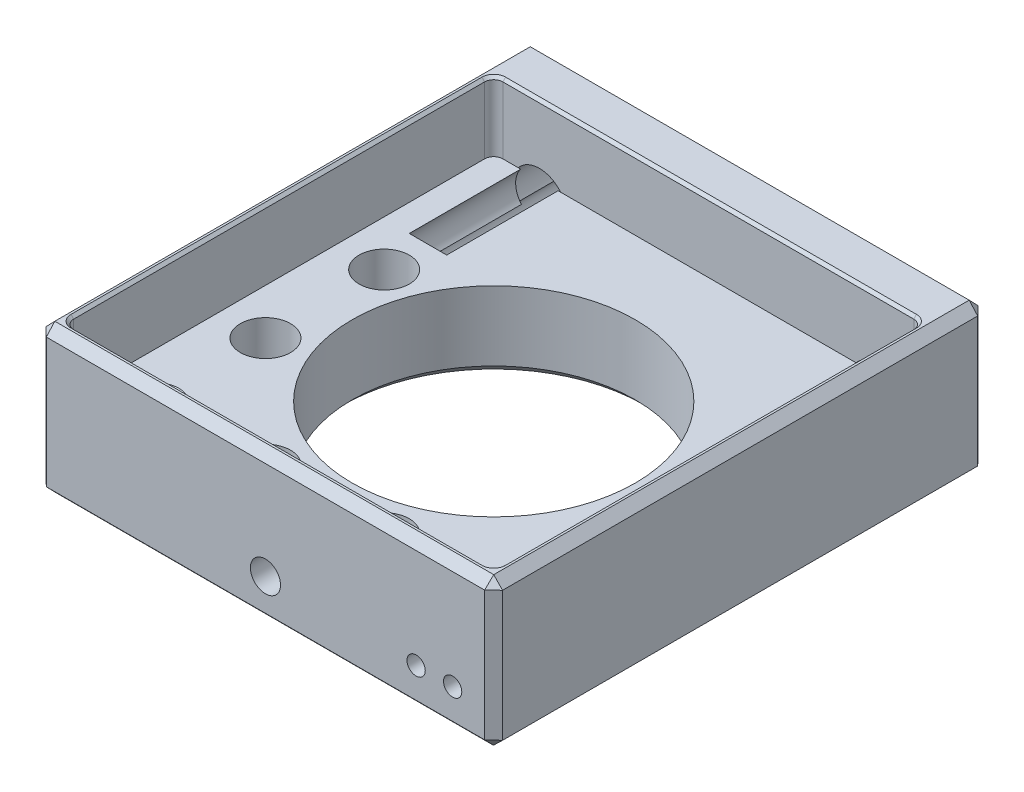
ISO-10303-21;
HEADER;
FILE_DESCRIPTION(('STEP AP214'),'2;1');
FILE_NAME('part.step','',(''),(''),'','','');
FILE_SCHEMA(('AUTOMOTIVE_DESIGN { 1 0 10303 214 1 1 1 1 }'));
ENDSEC;
DATA;
#1=APPLICATION_CONTEXT('core data for automotive mechanical design processes');
#2=APPLICATION_PROTOCOL_DEFINITION('international standard','automotive_design',2000,#1);
#3=PRODUCT_CONTEXT('',#1,'mechanical');
#4=PRODUCT('Part','Part','',(#3));
#5=PRODUCT_RELATED_PRODUCT_CATEGORY('part','',(#4));
#6=PRODUCT_DEFINITION_FORMATION('','',#4);
#7=PRODUCT_DEFINITION_CONTEXT('part definition',#1,'design');
#8=PRODUCT_DEFINITION('design','',#6,#7);
#9=PRODUCT_DEFINITION_SHAPE('','',#8);
#10=(LENGTH_UNIT() NAMED_UNIT(*) SI_UNIT(.MILLI.,.METRE.));
#11=(NAMED_UNIT(*) PLANE_ANGLE_UNIT() SI_UNIT($,.RADIAN.));
#12=(NAMED_UNIT(*) SI_UNIT($,.STERADIAN.) SOLID_ANGLE_UNIT());
#13=UNCERTAINTY_MEASURE_WITH_UNIT(LENGTH_MEASURE(1.E-05),#10,'distance_accuracy_value','');
#14=(GEOMETRIC_REPRESENTATION_CONTEXT(3) GLOBAL_UNCERTAINTY_ASSIGNED_CONTEXT((#13)) GLOBAL_UNIT_ASSIGNED_CONTEXT((#10,
#11,#12)) REPRESENTATION_CONTEXT('',''));
#15=CARTESIAN_POINT('',(0.,0.,0.));
#16=DIRECTION('',(0.,0.,1.));
#17=DIRECTION('',(1.,0.,0.));
#18=AXIS2_PLACEMENT_3D('',#15,#16,#17);
#19=CARTESIAN_POINT('',(-18.5,6.7,-27.));
#20=DIRECTION('',(0.,0.,-1.));
#21=DIRECTION('',(-1.,0.,0.));
#22=AXIS2_PLACEMENT_3D('',#19,#20,#21);
#23=CYLINDRICAL_SURFACE('',#22,3.);
#24=DIRECTION('',(0.,0.,-1.));
#25=VECTOR('',#24,1.);
#26=CARTESIAN_POINT('',(-17.4174423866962,3.90213134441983,-17.75));
#27=LINE('',#26,#25);
#28=CARTESIAN_POINT('',(-17.4174423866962,3.90213134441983,-21.5));
#29=VERTEX_POINT('',#28);
#30=CARTESIAN_POINT('',(-17.4174423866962,3.90213134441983,-26.7));
#31=VERTEX_POINT('',#30);
#32=EDGE_CURVE('E1564',#29,#31,#27,.T.);
#33=ORIENTED_EDGE('',*,*,#32,.T.);
#34=CARTESIAN_POINT('',(-18.5,6.7,-26.7));
#35=DIRECTION('',(0.,0.,1.));
#36=DIRECTION('',(1.,0.,0.));
#37=AXIS2_PLACEMENT_3D('',#34,#35,#36);
#38=CIRCLE('',#37,3.);
#39=CARTESIAN_POINT('',(-19.5825576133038,3.90213134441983,-26.7));
#40=VERTEX_POINT('',#39);
#41=EDGE_CURVE('E1086',#31,#40,#38,.F.);
#42=ORIENTED_EDGE('',*,*,#41,.T.);
#43=DIRECTION('',(0.,0.,-1.));
#44=VECTOR('',#43,1.);
#45=CARTESIAN_POINT('',(-19.5825576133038,3.90213134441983,-17.75));
#46=LINE('',#45,#44);
#47=CARTESIAN_POINT('',(-19.5825576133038,3.90213134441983,-21.5));
#48=VERTEX_POINT('',#47);
#49=EDGE_CURVE('E576',#40,#48,#46,.F.);
#50=ORIENTED_EDGE('',*,*,#49,.T.);
#51=CARTESIAN_POINT('',(-18.5,6.7,-21.5));
#52=DIRECTION('',(0.,0.,-1.));
#53=DIRECTION('',(-1.,0.,0.));
#54=AXIS2_PLACEMENT_3D('',#51,#52,#53);
#55=CIRCLE('',#54,3.);
#56=EDGE_CURVE('E575',#48,#29,#55,.F.);
#57=ORIENTED_EDGE('',*,*,#56,.T.);
#58=EDGE_LOOP('',(#33,#42,#50,#57));
#59=FACE_BOUND('',#58,.T.);
#60=ADVANCED_FACE('F45',(#59),#23,.F.);
#61=CARTESIAN_POINT('',(23.5,8.6,-21.5));
#62=DIRECTION('',(0.,0.,-1.));
#63=DIRECTION('',(-1.,0.,0.));
#64=AXIS2_PLACEMENT_3D('',#61,#62,#63);
#65=PLANE('',#64);
#66=CARTESIAN_POINT('',(-16.5,4.3,-21.5));
#67=DIRECTION('',(0.,0.,-1.));
#68=DIRECTION('',(-1.,0.,0.));
#69=AXIS2_PLACEMENT_3D('',#66,#67,#68);
#70=CIRCLE('',#69,1.);
#71=CARTESIAN_POINT('',(-16.5332462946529,5.29944718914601,-21.5));
#72=VERTEX_POINT('',#71);
#73=CARTESIAN_POINT('',(-15.9432133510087,5.13065554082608,-21.5));
#74=VERTEX_POINT('',#73);
#75=EDGE_CURVE('E3251',#72,#74,#70,.T.);
#76=ORIENTED_EDGE('',*,*,#75,.F.);
#77=CARTESIAN_POINT('',(-18.5,7.,-21.5));
#78=DIRECTION('',(0.,0.,-1.));
#79=DIRECTION('',(-1.,0.,0.));
#80=AXIS2_PLACEMENT_3D('',#77,#78,#79);
#81=CIRCLE('',#80,2.59999999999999);
#82=CARTESIAN_POINT('',(-16.4506098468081,8.6,-21.5));
#83=VERTEX_POINT('',#82);
#84=EDGE_CURVE('E582',#83,#72,#81,.T.);
#85=ORIENTED_EDGE('',*,*,#84,.F.);
#86=DIRECTION('',(-1.,0.,0.));
#87=VECTOR('',#86,1.);
#88=CARTESIAN_POINT('',(23.5,8.6,-21.5));
#89=LINE('',#88,#87);
#90=CARTESIAN_POINT('',(-16.1783626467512,8.6,-21.5));
#91=VERTEX_POINT('',#90);
#92=EDGE_CURVE('E3227',#91,#83,#89,.T.);
#93=ORIENTED_EDGE('',*,*,#92,.F.);
#94=EDGE_CURVE('E621',#74,#91,#55,.F.);
#95=ORIENTED_EDGE('',*,*,#94,.F.);
#96=EDGE_LOOP('',(#76,#85,#93,#95));
#97=FACE_BOUND('',#96,.T.);
#98=ADVANCED_FACE('F1521',(#97),#65,.T.);
#99=CARTESIAN_POINT('',(-20.5,4.3,-21.5));
#100=DIRECTION('',(0.,0.,-1.));
#101=DIRECTION('',(-1.,0.,0.));
#102=AXIS2_PLACEMENT_3D('',#99,#100,#101);
#103=CIRCLE('',#102,1.);
#104=CARTESIAN_POINT('',(-21.0567866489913,5.13065554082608,-21.5));
#105=VERTEX_POINT('',#104);
#106=CARTESIAN_POINT('',(-20.4667537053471,5.29944718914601,-21.5));
#107=VERTEX_POINT('',#106);
#108=EDGE_CURVE('E578',#105,#107,#103,.T.);
#109=ORIENTED_EDGE('',*,*,#108,.F.);
#110=CARTESIAN_POINT('',(-20.8216373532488,8.6,-21.5));
#111=VERTEX_POINT('',#110);
#112=EDGE_CURVE('E634',#111,#105,#55,.F.);
#113=ORIENTED_EDGE('',*,*,#112,.F.);
#114=CARTESIAN_POINT('',(-20.5493901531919,8.6,-21.5));
#115=VERTEX_POINT('',#114);
#116=EDGE_CURVE('E759',#115,#111,#89,.T.);
#117=ORIENTED_EDGE('',*,*,#116,.F.);
#118=EDGE_CURVE('E583',#107,#115,#81,.T.);
#119=ORIENTED_EDGE('',*,*,#118,.F.);
#120=EDGE_LOOP('',(#109,#113,#117,#119));
#121=FACE_BOUND('',#120,.T.);
#122=ADVANCED_FACE('F1528',(#121),#65,.T.);
#123=CARTESIAN_POINT('',(-18.5,7.,-27.));
#124=DIRECTION('',(0.,0.,-1.));
#125=DIRECTION('',(-1.,0.,0.));
#126=AXIS2_PLACEMENT_3D('',#123,#124,#125);
#127=CYLINDRICAL_SURFACE('',#126,2.59999999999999);
#128=CARTESIAN_POINT('',(-18.5,7.,-9.3));
#129=DIRECTION('',(0.,0.,-1.));
#130=DIRECTION('',(-1.,0.,0.));
#131=AXIS2_PLACEMENT_3D('',#128,#129,#130);
#132=CIRCLE('',#131,2.59999999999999);
#133=CARTESIAN_POINT('',(-17.4463816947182,4.62305059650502,-9.3));
#134=VERTEX_POINT('',#133);
#135=CARTESIAN_POINT('',(-19.5536183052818,4.62305059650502,-9.3));
#136=VERTEX_POINT('',#135);
#137=EDGE_CURVE('E3257',#134,#136,#132,.T.);
#138=ORIENTED_EDGE('',*,*,#137,.F.);
#139=DIRECTION('',(0.,0.,-1.));
#140=VECTOR('',#139,1.);
#141=CARTESIAN_POINT('',(-17.4463816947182,4.62305059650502,-17.75));
#142=LINE('',#141,#140);
#143=CARTESIAN_POINT('',(-17.4463816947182,4.62305059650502,-21.5));
#144=VERTEX_POINT('',#143);
#145=EDGE_CURVE('E581',#134,#144,#142,.T.);
#146=ORIENTED_EDGE('',*,*,#145,.T.);
#147=CARTESIAN_POINT('',(-19.5536183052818,4.62305059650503,-21.5));
#148=VERTEX_POINT('',#147);
#149=EDGE_CURVE('E573',#144,#148,#81,.T.);
#150=ORIENTED_EDGE('',*,*,#149,.T.);
#151=DIRECTION('',(0.,0.,-1.));
#152=VECTOR('',#151,1.);
#153=CARTESIAN_POINT('',(-19.5536183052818,4.62305059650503,-17.75));
#154=LINE('',#153,#152);
#155=EDGE_CURVE('E554',#148,#136,#154,.F.);
#156=ORIENTED_EDGE('',*,*,#155,.T.);
#157=EDGE_LOOP('',(#138,#146,#150,#156));
#158=FACE_BOUND('',#157,.T.);
#159=ADVANCED_FACE('F580',(#158),#127,.F.);
#160=CARTESIAN_POINT('',(-20.4667537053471,5.29944718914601,-9.3));
#161=VERTEX_POINT('',#160);
#162=CARTESIAN_POINT('',(-20.5493901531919,8.6,-9.3));
#163=VERTEX_POINT('',#162);
#164=EDGE_CURVE('E1568',#161,#163,#132,.T.);
#165=ORIENTED_EDGE('',*,*,#164,.F.);
#166=DIRECTION('',(0.,0.,-1.));
#167=VECTOR('',#166,1.);
#168=CARTESIAN_POINT('',(-20.4667537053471,5.29944718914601,-17.75));
#169=LINE('',#168,#167);
#170=EDGE_CURVE('E566',#161,#107,#169,.T.);
#171=ORIENTED_EDGE('',*,*,#170,.T.);
#172=ORIENTED_EDGE('',*,*,#118,.T.);
#173=DIRECTION('',(0.,0.,-1.));
#174=VECTOR('',#173,1.);
#175=CARTESIAN_POINT('',(-20.5493901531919,8.6,-27.));
#176=LINE('',#175,#174);
#177=EDGE_CURVE('E804',#115,#163,#176,.F.);
#178=ORIENTED_EDGE('',*,*,#177,.T.);
#179=EDGE_LOOP('',(#165,#171,#172,#178));
#180=FACE_BOUND('',#179,.T.);
#181=ADVANCED_FACE('F1578',(#180),#127,.F.);
#182=CARTESIAN_POINT('',(-25.,16.2,-27.));
#183=DIRECTION('',(0.,0.,1.));
#184=DIRECTION('',(1.,0.,0.));
#185=AXIS2_PLACEMENT_3D('',#182,#183,#184);
#186=PLANE('',#185);
#187=CARTESIAN_POINT('',(18.5,6.7,-27.));
#188=DIRECTION('',(0.,0.,1.));
#189=DIRECTION('',(1.,0.,0.));
#190=AXIS2_PLACEMENT_3D('',#187,#188,#189);
#191=CIRCLE('',#190,3.29999999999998);
#192=CARTESIAN_POINT('',(21.8,6.7,-27.));
#193=VERTEX_POINT('',#192);
#194=EDGE_CURVE('E1078',#193,#193,#191,.T.);
#195=ORIENTED_EDGE('',*,*,#194,.T.);
#196=EDGE_LOOP('',(#195));
#197=FACE_BOUND('',#196,.T.);
#198=CARTESIAN_POINT('',(-16.5,4.3,-27.));
#199=DIRECTION('',(0.,0.,1.));
#200=DIRECTION('',(1.,0.,0.));
#201=AXIS2_PLACEMENT_3D('',#198,#199,#200);
#202=CIRCLE('',#201,1.29999999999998);
#203=CARTESIAN_POINT('',(-17.5536884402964,3.53859296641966,-27.));
#204=VERTEX_POINT('',#203);
#205=CARTESIAN_POINT('',(-15.5610656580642,5.19911195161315,-27.));
#206=VERTEX_POINT('',#205);
#207=EDGE_CURVE('E1073',#204,#206,#202,.T.);
#208=ORIENTED_EDGE('',*,*,#207,.T.);
#209=CARTESIAN_POINT('',(-18.5,6.7,-27.));
#210=DIRECTION('',(0.,0.,1.));
#211=DIRECTION('',(1.,0.,0.));
#212=AXIS2_PLACEMENT_3D('',#209,#210,#211);
#213=CIRCLE('',#212,3.29999999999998);
#214=CARTESIAN_POINT('',(-21.4389343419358,5.19911195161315,-27.));
#215=VERTEX_POINT('',#214);
#216=EDGE_CURVE('E1075',#206,#215,#213,.T.);
#217=ORIENTED_EDGE('',*,*,#216,.T.);
#218=CARTESIAN_POINT('',(-20.5,4.3,-27.));
#219=DIRECTION('',(0.,0.,1.));
#220=DIRECTION('',(1.,0.,0.));
#221=AXIS2_PLACEMENT_3D('',#218,#219,#220);
#222=CIRCLE('',#221,1.29999999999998);
#223=CARTESIAN_POINT('',(-19.4463115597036,3.53859296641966,-27.));
#224=VERTEX_POINT('',#223);
#225=EDGE_CURVE('E1069',#215,#224,#222,.T.);
#226=ORIENTED_EDGE('',*,*,#225,.T.);
#227=CARTESIAN_POINT('',(-18.5,6.7,-27.));
#228=DIRECTION('',(0.,0.,1.));
#229=DIRECTION('',(1.,0.,0.));
#230=AXIS2_PLACEMENT_3D('',#227,#228,#229);
#231=CIRCLE('',#230,3.29999999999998);
#232=EDGE_CURVE('E1071',#224,#204,#231,.T.);
#233=ORIENTED_EDGE('',*,*,#232,.T.);
#234=EDGE_LOOP('',(#208,#217,#226,#233));
#235=FACE_BOUND('',#234,.T.);
#236=DIRECTION('',(1.,0.,0.));
#237=VECTOR('',#236,1.);
#238=CARTESIAN_POINT('',(25.,15.2,-27.));
#239=LINE('',#238,#237);
#240=CARTESIAN_POINT('',(-24.,15.2,-27.));
#241=VERTEX_POINT('',#240);
#242=CARTESIAN_POINT('',(24.0343112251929,15.2,-27.));
#243=VERTEX_POINT('',#242);
#244=EDGE_CURVE('E870',#241,#243,#239,.T.);
#245=ORIENTED_EDGE('',*,*,#244,.T.);
#246=DIRECTION('',(0.,-1.,0.));
#247=VECTOR('',#246,1.);
#248=CARTESIAN_POINT('',(24.0343112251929,16.2,-27.));
#249=LINE('',#248,#247);
#250=CARTESIAN_POINT('',(24.0343112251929,0.965688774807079,-27.));
#251=VERTEX_POINT('',#250);
#252=EDGE_CURVE('E876',#243,#251,#249,.T.);
#253=ORIENTED_EDGE('',*,*,#252,.T.);
#254=DIRECTION('',(-1.,0.,0.));
#255=VECTOR('',#254,1.);
#256=CARTESIAN_POINT('',(-25.,0.965688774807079,-27.));
#257=LINE('',#256,#255);
#258=CARTESIAN_POINT('',(-24.,0.965688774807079,-27.));
#259=VERTEX_POINT('',#258);
#260=EDGE_CURVE('E874',#251,#259,#257,.T.);
#261=ORIENTED_EDGE('',*,*,#260,.T.);
#262=DIRECTION('',(0.,1.,0.));
#263=VECTOR('',#262,1.);
#264=CARTESIAN_POINT('',(-24.,16.2,-27.));
#265=LINE('',#264,#263);
#266=EDGE_CURVE('E872',#259,#241,#265,.T.);
#267=ORIENTED_EDGE('',*,*,#266,.T.);
#268=EDGE_LOOP('',(#245,#253,#261,#267));
#269=FACE_BOUND('',#268,.T.);
#270=ADVANCED_FACE('F1574',(#197,#235,#269),#186,.F.);
#271=CARTESIAN_POINT('',(23.5,8.6,-21.5));
#272=DIRECTION('',(0.,0.,-1.));
#273=DIRECTION('',(-1.,0.,0.));
#274=AXIS2_PLACEMENT_3D('',#271,#272,#273);
#275=PLANE('',#274);
#276=DIRECTION('',(0.,1.,0.));
#277=VECTOR('',#276,1.);
#278=CARTESIAN_POINT('',(22.5,16.2,-21.5));
#279=LINE('',#278,#277);
#280=CARTESIAN_POINT('',(22.5,8.6,-21.5));
#281=VERTEX_POINT('',#280);
#282=CARTESIAN_POINT('',(22.5,15.9,-21.5));
#283=VERTEX_POINT('',#282);
#284=EDGE_CURVE('E818',#281,#283,#279,.T.);
#285=ORIENTED_EDGE('',*,*,#284,.T.);
#286=DIRECTION('',(-1.,0.,0.));
#287=VECTOR('',#286,1.);
#288=CARTESIAN_POINT('',(-22.5,15.9,-21.5));
#289=LINE('',#288,#287);
#290=CARTESIAN_POINT('',(-22.5,15.9,-21.5));
#291=VERTEX_POINT('',#290);
#292=EDGE_CURVE('E11',#283,#291,#289,.T.);
#293=ORIENTED_EDGE('',*,*,#292,.T.);
#294=DIRECTION('',(0.,1.,0.));
#295=VECTOR('',#294,1.);
#296=CARTESIAN_POINT('',(-22.5,8.6,-21.5));
#297=LINE('',#296,#295);
#298=CARTESIAN_POINT('',(-22.5,8.6,-21.5));
#299=VERTEX_POINT('',#298);
#300=EDGE_CURVE('E816',#291,#299,#297,.F.);
#301=ORIENTED_EDGE('',*,*,#300,.T.);
#302=EDGE_CURVE('E754',#111,#299,#89,.T.);
#303=ORIENTED_EDGE('',*,*,#302,.F.);
#304=EDGE_CURVE('E630',#91,#111,#55,.F.);
#305=ORIENTED_EDGE('',*,*,#304,.F.);
#306=CARTESIAN_POINT('',(16.1783626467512,8.6,-21.5));
#307=VERTEX_POINT('',#306);
#308=EDGE_CURVE('E3225',#307,#91,#89,.T.);
#309=ORIENTED_EDGE('',*,*,#308,.F.);
#310=CARTESIAN_POINT('',(18.5,6.7,-21.5));
#311=DIRECTION('',(0.,0.,-1.));
#312=DIRECTION('',(-1.,0.,0.));
#313=AXIS2_PLACEMENT_3D('',#310,#311,#312);
#314=CIRCLE('',#313,3.);
#315=CARTESIAN_POINT('',(20.8216373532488,8.6,-21.5));
#316=VERTEX_POINT('',#315);
#317=EDGE_CURVE('E635',#316,#307,#314,.F.);
#318=ORIENTED_EDGE('',*,*,#317,.F.);
#319=EDGE_CURVE('E755',#281,#316,#89,.T.);
#320=ORIENTED_EDGE('',*,*,#319,.F.);
#321=EDGE_LOOP('',(#285,#293,#301,#303,#305,#309,#318,#320));
#322=FACE_BOUND('',#321,.T.);
#323=ADVANCED_FACE('F1577',(#322),#275,.F.);
#324=CARTESIAN_POINT('',(25.,16.2,-27.));
#325=DIRECTION('',(-1.,0.,0.));
#326=DIRECTION('',(0.,0.,1.));
#327=AXIS2_PLACEMENT_3D('',#324,#325,#326);
#328=PLANE('',#327);
#329=DIRECTION('',(0.,-1.,0.));
#330=VECTOR('',#329,1.);
#331=CARTESIAN_POINT('',(25.,16.2,26.0343112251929));
#332=LINE('',#331,#330);
#333=CARTESIAN_POINT('',(25.,15.2,26.0343112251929));
#334=VERTEX_POINT('',#333);
#335=CARTESIAN_POINT('',(25.,0.965688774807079,26.0343112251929));
#336=VERTEX_POINT('',#335);
#337=EDGE_CURVE('E865',#334,#336,#332,.T.);
#338=ORIENTED_EDGE('',*,*,#337,.T.);
#339=DIRECTION('',(0.,0.,-1.));
#340=VECTOR('',#339,1.);
#341=CARTESIAN_POINT('',(25.,0.965688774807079,-27.));
#342=LINE('',#341,#340);
#343=CARTESIAN_POINT('',(25.,0.965688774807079,-26.));
#344=VERTEX_POINT('',#343);
#345=EDGE_CURVE('E868',#336,#344,#342,.T.);
#346=ORIENTED_EDGE('',*,*,#345,.T.);
#347=DIRECTION('',(0.,1.,0.));
#348=VECTOR('',#347,1.);
#349=CARTESIAN_POINT('',(25.,16.2,-26.));
#350=LINE('',#349,#348);
#351=CARTESIAN_POINT('',(25.,15.2,-26.));
#352=VERTEX_POINT('',#351);
#353=EDGE_CURVE('E863',#344,#352,#350,.T.);
#354=ORIENTED_EDGE('',*,*,#353,.T.);
#355=DIRECTION('',(0.,0.,1.));
#356=VECTOR('',#355,1.);
#357=CARTESIAN_POINT('',(25.,15.2,27.));
#358=LINE('',#357,#356);
#359=EDGE_CURVE('E861',#352,#334,#358,.T.);
#360=ORIENTED_EDGE('',*,*,#359,.T.);
#361=EDGE_LOOP('',(#338,#346,#354,#360));
#362=FACE_BOUND('',#361,.T.);
#363=ADVANCED_FACE('F1608',(#362),#328,.F.);
#364=CARTESIAN_POINT('',(-25.,16.2,-27.));
#365=DIRECTION('',(1.,0.,0.));
#366=DIRECTION('',(0.,0.,-1.));
#367=AXIS2_PLACEMENT_3D('',#364,#365,#366);
#368=PLANE('',#367);
#369=DIRECTION('',(0.,0.,1.));
#370=VECTOR('',#369,1.);
#371=CARTESIAN_POINT('',(-25.,0.965688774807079,-27.));
#372=LINE('',#371,#370);
#373=CARTESIAN_POINT('',(-25.,0.965688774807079,-26.0343112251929));
#374=VERTEX_POINT('',#373);
#375=CARTESIAN_POINT('',(-25.,0.965688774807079,26.0343112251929));
#376=VERTEX_POINT('',#375);
#377=EDGE_CURVE('E856',#374,#376,#372,.T.);
#378=ORIENTED_EDGE('',*,*,#377,.T.);
#379=DIRECTION('',(0.,1.,0.));
#380=VECTOR('',#379,1.);
#381=CARTESIAN_POINT('',(-25.,16.2,26.0343112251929));
#382=LINE('',#381,#380);
#383=CARTESIAN_POINT('',(-25.,15.2,26.0343112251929));
#384=VERTEX_POINT('',#383);
#385=EDGE_CURVE('E858',#376,#384,#382,.T.);
#386=ORIENTED_EDGE('',*,*,#385,.T.);
#387=DIRECTION('',(0.,0.,-1.));
#388=VECTOR('',#387,1.);
#389=CARTESIAN_POINT('',(-25.,15.2,-27.));
#390=LINE('',#389,#388);
#391=CARTESIAN_POINT('',(-25.,15.2,-26.0343112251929));
#392=VERTEX_POINT('',#391);
#393=EDGE_CURVE('E852',#384,#392,#390,.T.);
#394=ORIENTED_EDGE('',*,*,#393,.T.);
#395=DIRECTION('',(0.,-1.,0.));
#396=VECTOR('',#395,1.);
#397=CARTESIAN_POINT('',(-25.,16.2,-26.0343112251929));
#398=LINE('',#397,#396);
#399=EDGE_CURVE('E854',#392,#374,#398,.T.);
#400=ORIENTED_EDGE('',*,*,#399,.T.);
#401=EDGE_LOOP('',(#378,#386,#394,#400));
#402=FACE_BOUND('',#401,.T.);
#403=CARTESIAN_POINT('',(-25.,4.5,0.));
#404=DIRECTION('',(-1.,0.,0.));
#405=DIRECTION('',(0.,0.,1.));
#406=AXIS2_PLACEMENT_3D('',#403,#404,#405);
#407=CIRCLE('',#406,1.64999999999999);
#408=CARTESIAN_POINT('',(-25.,4.5,1.64999999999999));
#409=VERTEX_POINT('',#408);
#410=EDGE_CURVE('E644',#409,#409,#407,.T.);
#411=ORIENTED_EDGE('',*,*,#410,.F.);
#412=EDGE_LOOP('',(#411));
#413=FACE_BOUND('',#412,.T.);
#414=ADVANCED_FACE('F1780',(#402,#413),#368,.F.);
#415=CARTESIAN_POINT('',(-25.,16.2,27.));
#416=DIRECTION('',(0.,0.,-1.));
#417=DIRECTION('',(-1.,0.,0.));
#418=AXIS2_PLACEMENT_3D('',#415,#416,#417);
#419=PLANE('',#418);
#420=DIRECTION('',(0.,-1.,0.));
#421=VECTOR('',#420,1.);
#422=CARTESIAN_POINT('',(-24.,16.2,27.));
#423=LINE('',#422,#421);
#424=CARTESIAN_POINT('',(-24.,15.2,27.));
#425=VERTEX_POINT('',#424);
#426=CARTESIAN_POINT('',(-24.,1.00000000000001,27.));
#427=VERTEX_POINT('',#426);
#428=EDGE_CURVE('E847',#425,#427,#423,.T.);
#429=ORIENTED_EDGE('',*,*,#428,.T.);
#430=DIRECTION('',(1.,0.,0.));
#431=VECTOR('',#430,1.);
#432=CARTESIAN_POINT('',(-25.,1.00000000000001,27.));
#433=LINE('',#432,#431);
#434=CARTESIAN_POINT('',(24.,1.00000000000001,27.));
#435=VERTEX_POINT('',#434);
#436=EDGE_CURVE('E850',#427,#435,#433,.T.);
#437=ORIENTED_EDGE('',*,*,#436,.T.);
#438=DIRECTION('',(0.,1.,0.));
#439=VECTOR('',#438,1.);
#440=CARTESIAN_POINT('',(24.,16.2,27.));
#441=LINE('',#440,#439);
#442=CARTESIAN_POINT('',(24.,15.2,27.));
#443=VERTEX_POINT('',#442);
#444=EDGE_CURVE('E845',#435,#443,#441,.T.);
#445=ORIENTED_EDGE('',*,*,#444,.T.);
#446=DIRECTION('',(-1.,0.,0.));
#447=VECTOR('',#446,1.);
#448=CARTESIAN_POINT('',(-25.,15.2,27.));
#449=LINE('',#448,#447);
#450=EDGE_CURVE('E843',#443,#425,#449,.T.);
#451=ORIENTED_EDGE('',*,*,#450,.T.);
#452=EDGE_LOOP('',(#429,#437,#445,#451));
#453=FACE_BOUND('',#452,.T.);
#454=CARTESIAN_POINT('',(16.5,4.3,27.));
#455=DIRECTION('',(0.,0.,1.));
#456=DIRECTION('',(1.,0.,0.));
#457=AXIS2_PLACEMENT_3D('',#454,#455,#456);
#458=CIRCLE('',#457,1.);
#459=CARTESIAN_POINT('',(17.5,4.3,27.));
#460=VERTEX_POINT('',#459);
#461=EDGE_CURVE('E622',#460,#460,#458,.T.);
#462=ORIENTED_EDGE('',*,*,#461,.F.);
#463=EDGE_LOOP('',(#462));
#464=FACE_BOUND('',#463,.T.);
#465=CARTESIAN_POINT('',(20.5,4.3,27.));
#466=DIRECTION('',(0.,0.,1.));
#467=DIRECTION('',(1.,0.,0.));
#468=AXIS2_PLACEMENT_3D('',#465,#466,#467);
#469=CIRCLE('',#468,1.);
#470=CARTESIAN_POINT('',(21.5,4.3,27.));
#471=VERTEX_POINT('',#470);
#472=EDGE_CURVE('E625',#471,#471,#469,.T.);
#473=ORIENTED_EDGE('',*,*,#472,.F.);
#474=EDGE_LOOP('',(#473));
#475=FACE_BOUND('',#474,.T.);
#476=CARTESIAN_POINT('',(0.,4.5,27.));
#477=DIRECTION('',(0.,0.,1.));
#478=DIRECTION('',(1.,0.,0.));
#479=AXIS2_PLACEMENT_3D('',#476,#477,#478);
#480=CIRCLE('',#479,1.64999999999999);
#481=CARTESIAN_POINT('',(1.65,4.5,27.));
#482=VERTEX_POINT('',#481);
#483=EDGE_CURVE('E638',#482,#482,#480,.T.);
#484=ORIENTED_EDGE('',*,*,#483,.F.);
#485=EDGE_LOOP('',(#484));
#486=FACE_BOUND('',#485,.T.);
#487=ADVANCED_FACE('F1788',(#453,#464,#475,#486),#419,.F.);
#488=CARTESIAN_POINT('',(0.,16.2,0.));
#489=DIRECTION('',(0.,1.,0.));
#490=DIRECTION('',(0.,0.,1.));
#491=AXIS2_PLACEMENT_3D('',#488,#489,#490);
#492=PLANE('',#491);
#493=CARTESIAN_POINT('',(22.5,16.2,24.5));
#494=DIRECTION('',(0.,1.,0.));
#495=DIRECTION('',(0.,0.,1.));
#496=AXIS2_PLACEMENT_3D('',#493,#494,#495);
#497=CIRCLE('',#496,1.3);
#498=CARTESIAN_POINT('',(23.8,16.2,24.5));
#499=VERTEX_POINT('',#498);
#500=CARTESIAN_POINT('',(22.5,16.2,25.8));
#501=VERTEX_POINT('',#500);
#502=EDGE_CURVE('E1105',#499,#501,#497,.F.);
#503=ORIENTED_EDGE('',*,*,#502,.T.);
#504=DIRECTION('',(-1.,0.,0.));
#505=VECTOR('',#504,1.);
#506=CARTESIAN_POINT('',(-22.5,16.2,25.8));
#507=LINE('',#506,#505);
#508=CARTESIAN_POINT('',(-22.5,16.2,25.8));
#509=VERTEX_POINT('',#508);
#510=EDGE_CURVE('E1107',#501,#509,#507,.T.);
#511=ORIENTED_EDGE('',*,*,#510,.T.);
#512=CARTESIAN_POINT('',(-22.5,16.2,24.5));
#513=DIRECTION('',(0.,1.,0.));
#514=DIRECTION('',(0.,0.,1.));
#515=AXIS2_PLACEMENT_3D('',#512,#513,#514);
#516=CIRCLE('',#515,1.3);
#517=CARTESIAN_POINT('',(-23.8,16.2,24.5));
#518=VERTEX_POINT('',#517);
#519=EDGE_CURVE('E1103',#509,#518,#516,.F.);
#520=ORIENTED_EDGE('',*,*,#519,.T.);
#521=DIRECTION('',(0.,0.,-1.));
#522=VECTOR('',#521,1.);
#523=CARTESIAN_POINT('',(-23.8,16.2,-20.5));
#524=LINE('',#523,#522);
#525=CARTESIAN_POINT('',(-23.8,16.2,-20.5));
#526=VERTEX_POINT('',#525);
#527=EDGE_CURVE('E1099',#518,#526,#524,.T.);
#528=ORIENTED_EDGE('',*,*,#527,.T.);
#529=CARTESIAN_POINT('',(-22.5,16.2,-20.5));
#530=DIRECTION('',(0.,1.,0.));
#531=DIRECTION('',(0.,0.,1.));
#532=AXIS2_PLACEMENT_3D('',#529,#530,#531);
#533=CIRCLE('',#532,1.3);
#534=CARTESIAN_POINT('',(-22.5,16.2,-21.8));
#535=VERTEX_POINT('',#534);
#536=EDGE_CURVE('E1095',#526,#535,#533,.F.);
#537=ORIENTED_EDGE('',*,*,#536,.T.);
#538=DIRECTION('',(1.,0.,0.));
#539=VECTOR('',#538,1.);
#540=CARTESIAN_POINT('',(22.5,16.2,-21.8));
#541=LINE('',#540,#539);
#542=CARTESIAN_POINT('',(22.5,16.2,-21.8));
#543=VERTEX_POINT('',#542);
#544=EDGE_CURVE('E1093',#535,#543,#541,.T.);
#545=ORIENTED_EDGE('',*,*,#544,.T.);
#546=CARTESIAN_POINT('',(22.5,16.2,-20.5));
#547=DIRECTION('',(0.,1.,0.));
#548=DIRECTION('',(0.,0.,1.));
#549=AXIS2_PLACEMENT_3D('',#546,#547,#548);
#550=CIRCLE('',#549,1.3);
#551=CARTESIAN_POINT('',(23.8,16.2,-20.5));
#552=VERTEX_POINT('',#551);
#553=EDGE_CURVE('E1097',#543,#552,#550,.F.);
#554=ORIENTED_EDGE('',*,*,#553,.T.);
#555=DIRECTION('',(0.,0.,1.));
#556=VECTOR('',#555,1.);
#557=CARTESIAN_POINT('',(23.8,16.2,24.5));
#558=LINE('',#557,#556);
#559=EDGE_CURVE('E1101',#552,#499,#558,.T.);
#560=ORIENTED_EDGE('',*,*,#559,.T.);
#561=EDGE_LOOP('',(#503,#511,#520,#528,#537,#545,#554,#560));
#562=FACE_BOUND('',#561,.T.);
#563=DIRECTION('',(-1.,0.,0.));
#564=VECTOR('',#563,1.);
#565=CARTESIAN_POINT('',(-25.,16.2,-26.0343112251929));
#566=LINE('',#565,#564);
#567=CARTESIAN_POINT('',(24.0343112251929,16.2,-26.0343112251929));
#568=VERTEX_POINT('',#567);
#569=CARTESIAN_POINT('',(-24.0343112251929,16.2,-26.0343112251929));
#570=VERTEX_POINT('',#569);
#571=EDGE_CURVE('E892',#568,#570,#566,.T.);
#572=ORIENTED_EDGE('',*,*,#571,.T.);
#573=DIRECTION('',(0.,0.,1.));
#574=VECTOR('',#573,1.);
#575=CARTESIAN_POINT('',(-24.0343112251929,16.2,27.));
#576=LINE('',#575,#574);
#577=CARTESIAN_POINT('',(-24.0343112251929,16.2,26.0343112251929));
#578=VERTEX_POINT('',#577);
#579=EDGE_CURVE('E894',#570,#578,#576,.T.);
#580=ORIENTED_EDGE('',*,*,#579,.T.);
#581=DIRECTION('',(1.,0.,0.));
#582=VECTOR('',#581,1.);
#583=CARTESIAN_POINT('',(25.,16.2,26.0343112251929));
#584=LINE('',#583,#582);
#585=CARTESIAN_POINT('',(24.0343112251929,16.2,26.0343112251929));
#586=VERTEX_POINT('',#585);
#587=EDGE_CURVE('E888',#578,#586,#584,.T.);
#588=ORIENTED_EDGE('',*,*,#587,.T.);
#589=DIRECTION('',(0.,0.,-1.));
#590=VECTOR('',#589,1.);
#591=CARTESIAN_POINT('',(24.0343112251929,16.2,-27.));
#592=LINE('',#591,#590);
#593=EDGE_CURVE('E890',#586,#568,#592,.T.);
#594=ORIENTED_EDGE('',*,*,#593,.T.);
#595=EDGE_LOOP('',(#572,#580,#588,#594));
#596=FACE_BOUND('',#595,.T.);
#597=ADVANCED_FACE('F1468',(#562,#596),#492,.T.);
#598=CARTESIAN_POINT('',(0.,0.,0.));
#599=DIRECTION('',(0.,1.,0.));
#600=DIRECTION('',(0.,0.,1.));
#601=AXIS2_PLACEMENT_3D('',#598,#599,#600);
#602=PLANE('',#601);
#603=CARTESIAN_POINT('',(-9.99999999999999,0.,20.5));
#604=DIRECTION('',(0.,1.,0.));
#605=DIRECTION('',(0.,0.,1.));
#606=AXIS2_PLACEMENT_3D('',#603,#604,#605);
#607=CIRCLE('',#606,1.40000000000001);
#608=CARTESIAN_POINT('',(-9.99999999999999,0.,19.1));
#609=VERTEX_POINT('',#608);
#610=CARTESIAN_POINT('',(-9.99999999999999,0.,21.9));
#611=VERTEX_POINT('',#610);
#612=EDGE_CURVE('E1014',#609,#611,#607,.T.);
#613=ORIENTED_EDGE('',*,*,#612,.T.);
#614=DIRECTION('',(1.,0.,0.));
#615=VECTOR('',#614,1.);
#616=CARTESIAN_POINT('',(0.,0.,21.9));
#617=LINE('',#616,#615);
#618=CARTESIAN_POINT('',(-9.20970478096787,0.,21.8999999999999));
#619=VERTEX_POINT('',#618);
#620=EDGE_CURVE('E1016',#611,#619,#617,.T.);
#621=ORIENTED_EDGE('',*,*,#620,.T.);
#622=CARTESIAN_POINT('',(-6.5,0.,20.5));
#623=DIRECTION('',(0.,1.,0.));
#624=DIRECTION('',(0.,0.,1.));
#625=AXIS2_PLACEMENT_3D('',#622,#623,#624);
#626=CIRCLE('',#625,3.05);
#627=CARTESIAN_POINT('',(-3.79029521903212,0.,21.8999999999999));
#628=VERTEX_POINT('',#627);
#629=EDGE_CURVE('E994',#619,#628,#626,.T.);
#630=ORIENTED_EDGE('',*,*,#629,.T.);
#631=DIRECTION('',(1.,0.,0.));
#632=VECTOR('',#631,1.);
#633=CARTESIAN_POINT('',(0.,0.,21.9));
#634=LINE('',#633,#632);
#635=CARTESIAN_POINT('',(3.79029521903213,0.,21.9));
#636=VERTEX_POINT('',#635);
#637=EDGE_CURVE('E996',#628,#636,#634,.T.);
#638=ORIENTED_EDGE('',*,*,#637,.T.);
#639=CARTESIAN_POINT('',(6.5,0.,20.5));
#640=DIRECTION('',(0.,1.,0.));
#641=DIRECTION('',(0.,0.,1.));
#642=AXIS2_PLACEMENT_3D('',#639,#640,#641);
#643=CIRCLE('',#642,3.05);
#644=CARTESIAN_POINT('',(9.20970478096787,0.,21.8999999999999));
#645=VERTEX_POINT('',#644);
#646=EDGE_CURVE('E998',#636,#645,#643,.T.);
#647=ORIENTED_EDGE('',*,*,#646,.T.);
#648=DIRECTION('',(1.,0.,0.));
#649=VECTOR('',#648,1.);
#650=CARTESIAN_POINT('',(0.,0.,21.9));
#651=LINE('',#650,#649);
#652=CARTESIAN_POINT('',(10.,0.,21.9));
#653=VERTEX_POINT('',#652);
#654=EDGE_CURVE('E1000',#645,#653,#651,.T.);
#655=ORIENTED_EDGE('',*,*,#654,.T.);
#656=CARTESIAN_POINT('',(10.,0.,20.5));
#657=DIRECTION('',(0.,1.,0.));
#658=DIRECTION('',(0.,0.,1.));
#659=AXIS2_PLACEMENT_3D('',#656,#657,#658);
#660=CIRCLE('',#659,1.40000000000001);
#661=CARTESIAN_POINT('',(10.,0.,19.1));
#662=VERTEX_POINT('',#661);
#663=EDGE_CURVE('E1002',#653,#662,#660,.T.);
#664=ORIENTED_EDGE('',*,*,#663,.T.);
#665=DIRECTION('',(-1.,0.,0.));
#666=VECTOR('',#665,1.);
#667=CARTESIAN_POINT('',(0.,0.,19.1));
#668=LINE('',#667,#666);
#669=CARTESIAN_POINT('',(9.20970478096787,0.,19.1));
#670=VERTEX_POINT('',#669);
#671=EDGE_CURVE('E1004',#662,#670,#668,.T.);
#672=ORIENTED_EDGE('',*,*,#671,.T.);
#673=CARTESIAN_POINT('',(6.5,0.,20.5));
#674=DIRECTION('',(0.,1.,0.));
#675=DIRECTION('',(0.,0.,1.));
#676=AXIS2_PLACEMENT_3D('',#673,#674,#675);
#677=CIRCLE('',#676,3.05);
#678=CARTESIAN_POINT('',(3.79029521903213,0.,19.1000000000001));
#679=VERTEX_POINT('',#678);
#680=EDGE_CURVE('E1006',#670,#679,#677,.T.);
#681=ORIENTED_EDGE('',*,*,#680,.T.);
#682=DIRECTION('',(-1.,0.,0.));
#683=VECTOR('',#682,1.);
#684=CARTESIAN_POINT('',(0.,0.,19.1));
#685=LINE('',#684,#683);
#686=CARTESIAN_POINT('',(-3.79029521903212,0.,19.1));
#687=VERTEX_POINT('',#686);
#688=EDGE_CURVE('E1008',#679,#687,#685,.T.);
#689=ORIENTED_EDGE('',*,*,#688,.T.);
#690=CARTESIAN_POINT('',(-6.5,0.,20.5));
#691=DIRECTION('',(0.,1.,0.));
#692=DIRECTION('',(0.,0.,1.));
#693=AXIS2_PLACEMENT_3D('',#690,#691,#692);
#694=CIRCLE('',#693,3.05);
#695=CARTESIAN_POINT('',(-9.20970478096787,0.,19.1000000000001));
#696=VERTEX_POINT('',#695);
#697=EDGE_CURVE('E1010',#687,#696,#694,.T.);
#698=ORIENTED_EDGE('',*,*,#697,.T.);
#699=DIRECTION('',(-1.,0.,0.));
#700=VECTOR('',#699,1.);
#701=CARTESIAN_POINT('',(0.,0.,19.1));
#702=LINE('',#701,#700);
#703=EDGE_CURVE('E1012',#696,#609,#702,.T.);
#704=ORIENTED_EDGE('',*,*,#703,.T.);
#705=EDGE_LOOP('',(#613,#621,#630,#638,#647,#655,#664,#672,#681,#689,#698,#704));
#706=FACE_BOUND('',#705,.T.);
#707=CARTESIAN_POINT('',(-18.5,0.,12.));
#708=DIRECTION('',(0.,1.,0.));
#709=DIRECTION('',(0.,0.,1.));
#710=AXIS2_PLACEMENT_3D('',#707,#708,#709);
#711=CIRCLE('',#710,1.40000000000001);
#712=CARTESIAN_POINT('',(-19.9,0.,12.));
#713=VERTEX_POINT('',#712);
#714=CARTESIAN_POINT('',(-17.1,0.,12.));
#715=VERTEX_POINT('',#714);
#716=EDGE_CURVE('E989',#713,#715,#711,.T.);
#717=ORIENTED_EDGE('',*,*,#716,.T.);
#718=DIRECTION('',(0.,0.,-1.));
#719=VECTOR('',#718,1.);
#720=CARTESIAN_POINT('',(-17.1,0.,0.));
#721=LINE('',#720,#719);
#722=CARTESIAN_POINT('',(-17.1,0.,11.2097047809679));
#723=VERTEX_POINT('',#722);
#724=EDGE_CURVE('E991',#715,#723,#721,.T.);
#725=ORIENTED_EDGE('',*,*,#724,.T.);
#726=CARTESIAN_POINT('',(-18.5,0.,8.49999999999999));
#727=DIRECTION('',(0.,1.,0.));
#728=DIRECTION('',(0.,0.,1.));
#729=AXIS2_PLACEMENT_3D('',#726,#727,#728);
#730=CIRCLE('',#729,3.05);
#731=CARTESIAN_POINT('',(-17.1,0.,5.79029521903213));
#732=VERTEX_POINT('',#731);
#733=EDGE_CURVE('E969',#723,#732,#730,.T.);
#734=ORIENTED_EDGE('',*,*,#733,.T.);
#735=DIRECTION('',(0.,0.,-1.));
#736=VECTOR('',#735,1.);
#737=CARTESIAN_POINT('',(-17.1,0.,0.));
#738=LINE('',#737,#736);
#739=CARTESIAN_POINT('',(-17.1,0.,-1.79029521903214));
#740=VERTEX_POINT('',#739);
#741=EDGE_CURVE('E971',#732,#740,#738,.T.);
#742=ORIENTED_EDGE('',*,*,#741,.T.);
#743=CARTESIAN_POINT('',(-18.5,0.,-4.5));
#744=DIRECTION('',(0.,1.,0.));
#745=DIRECTION('',(0.,0.,1.));
#746=AXIS2_PLACEMENT_3D('',#743,#744,#745);
#747=CIRCLE('',#746,3.05);
#748=CARTESIAN_POINT('',(-17.1,0.,-7.20970478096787));
#749=VERTEX_POINT('',#748);
#750=EDGE_CURVE('E973',#740,#749,#747,.T.);
#751=ORIENTED_EDGE('',*,*,#750,.T.);
#752=DIRECTION('',(0.,0.,-1.));
#753=VECTOR('',#752,1.);
#754=CARTESIAN_POINT('',(-17.1,0.,0.));
#755=LINE('',#754,#753);
#756=CARTESIAN_POINT('',(-17.1,0.,-8.));
#757=VERTEX_POINT('',#756);
#758=EDGE_CURVE('E975',#749,#757,#755,.T.);
#759=ORIENTED_EDGE('',*,*,#758,.T.);
#760=CARTESIAN_POINT('',(-18.5,0.,-8.00000000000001));
#761=DIRECTION('',(0.,1.,0.));
#762=DIRECTION('',(0.,0.,1.));
#763=AXIS2_PLACEMENT_3D('',#760,#761,#762);
#764=CIRCLE('',#763,1.40000000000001);
#765=CARTESIAN_POINT('',(-19.9,0.,-8.));
#766=VERTEX_POINT('',#765);
#767=EDGE_CURVE('E977',#757,#766,#764,.T.);
#768=ORIENTED_EDGE('',*,*,#767,.T.);
#769=DIRECTION('',(0.,0.,1.));
#770=VECTOR('',#769,1.);
#771=CARTESIAN_POINT('',(-19.9,0.,0.));
#772=LINE('',#771,#770);
#773=CARTESIAN_POINT('',(-19.9,0.,-7.20970478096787));
#774=VERTEX_POINT('',#773);
#775=EDGE_CURVE('E979',#766,#774,#772,.T.);
#776=ORIENTED_EDGE('',*,*,#775,.T.);
#777=CARTESIAN_POINT('',(-18.5,0.,-4.5));
#778=DIRECTION('',(0.,1.,0.));
#779=DIRECTION('',(0.,0.,1.));
#780=AXIS2_PLACEMENT_3D('',#777,#778,#779);
#781=CIRCLE('',#780,3.05);
#782=CARTESIAN_POINT('',(-19.8999999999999,0.,-1.79029521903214));
#783=VERTEX_POINT('',#782);
#784=EDGE_CURVE('E981',#774,#783,#781,.T.);
#785=ORIENTED_EDGE('',*,*,#784,.T.);
#786=DIRECTION('',(0.,0.,1.));
#787=VECTOR('',#786,1.);
#788=CARTESIAN_POINT('',(-19.9,0.,0.));
#789=LINE('',#788,#787);
#790=CARTESIAN_POINT('',(-19.9,0.,5.79029521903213));
#791=VERTEX_POINT('',#790);
#792=EDGE_CURVE('E983',#783,#791,#789,.T.);
#793=ORIENTED_EDGE('',*,*,#792,.T.);
#794=CARTESIAN_POINT('',(-18.5,0.,8.49999999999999));
#795=DIRECTION('',(0.,1.,0.));
#796=DIRECTION('',(0.,0.,1.));
#797=AXIS2_PLACEMENT_3D('',#794,#795,#796);
#798=CIRCLE('',#797,3.04999999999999);
#799=CARTESIAN_POINT('',(-19.9,0.,11.2097047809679));
#800=VERTEX_POINT('',#799);
#801=EDGE_CURVE('E985',#791,#800,#798,.T.);
#802=ORIENTED_EDGE('',*,*,#801,.T.);
#803=DIRECTION('',(0.,0.,1.));
#804=VECTOR('',#803,1.);
#805=CARTESIAN_POINT('',(-19.9,0.,0.));
#806=LINE('',#805,#804);
#807=EDGE_CURVE('E987',#800,#713,#806,.T.);
#808=ORIENTED_EDGE('',*,*,#807,.T.);
#809=EDGE_LOOP('',(#717,#725,#734,#742,#751,#759,#768,#776,#785,#793,#802,#808));
#810=FACE_BOUND('',#809,.T.);
#811=DIRECTION('',(-1.,0.,0.));
#812=VECTOR('',#811,1.);
#813=CARTESIAN_POINT('',(0.,0.,26.0343112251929));
#814=LINE('',#813,#812);
#815=CARTESIAN_POINT('',(24.,0.,26.0343112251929));
#816=VERTEX_POINT('',#815);
#817=CARTESIAN_POINT('',(-24.,0.,26.0343112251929));
#818=VERTEX_POINT('',#817);
#819=EDGE_CURVE('E883',#816,#818,#814,.T.);
#820=ORIENTED_EDGE('',*,*,#819,.T.);
#821=DIRECTION('',(0.,0.,-1.));
#822=VECTOR('',#821,1.);
#823=CARTESIAN_POINT('',(-24.,0.,0.));
#824=LINE('',#823,#822);
#825=CARTESIAN_POINT('',(-24.,0.,-26.));
#826=VERTEX_POINT('',#825);
#827=EDGE_CURVE('E885',#818,#826,#824,.T.);
#828=ORIENTED_EDGE('',*,*,#827,.T.);
#829=DIRECTION('',(1.,0.,0.));
#830=VECTOR('',#829,1.);
#831=CARTESIAN_POINT('',(0.,0.,-26.));
#832=LINE('',#831,#830);
#833=CARTESIAN_POINT('',(24.,0.,-26.));
#834=VERTEX_POINT('',#833);
#835=EDGE_CURVE('E879',#826,#834,#832,.T.);
#836=ORIENTED_EDGE('',*,*,#835,.T.);
#837=DIRECTION('',(0.,0.,1.));
#838=VECTOR('',#837,1.);
#839=CARTESIAN_POINT('',(24.,0.,0.));
#840=LINE('',#839,#838);
#841=EDGE_CURVE('E881',#834,#816,#840,.T.);
#842=ORIENTED_EDGE('',*,*,#841,.T.);
#843=EDGE_LOOP('',(#820,#828,#836,#842));
#844=FACE_BOUND('',#843,.T.);
#845=CARTESIAN_POINT('',(0.,0.,1.99999999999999));
#846=DIRECTION('',(0.,1.,0.));
#847=DIRECTION('',(0.,0.,1.));
#848=AXIS2_PLACEMENT_3D('',#845,#846,#847);
#849=CIRCLE('',#848,16.5);
#850=CARTESIAN_POINT('',(0.,0.,18.5));
#851=VERTEX_POINT('',#850);
#852=EDGE_CURVE('E790',#851,#851,#849,.T.);
#853=ORIENTED_EDGE('',*,*,#852,.T.);
#854=EDGE_LOOP('',(#853));
#855=FACE_BOUND('',#854,.T.);
#856=ADVANCED_FACE('F1904',(#706,#810,#844,#855),#602,.F.);
#857=CARTESIAN_POINT('',(-23.5,8.6,25.5));
#858=DIRECTION('',(-1.,0.,0.));
#859=DIRECTION('',(0.,0.,1.));
#860=AXIS2_PLACEMENT_3D('',#857,#858,#859);
#861=PLANE('',#860);
#862=DIRECTION('',(0.,1.,0.));
#863=VECTOR('',#862,1.);
#864=CARTESIAN_POINT('',(-23.5,16.2,-20.5));
#865=LINE('',#864,#863);
#866=CARTESIAN_POINT('',(-23.5,8.6,-20.5));
#867=VERTEX_POINT('',#866);
#868=CARTESIAN_POINT('',(-23.5,15.9,-20.5));
#869=VERTEX_POINT('',#868);
#870=EDGE_CURVE('E840',#867,#869,#865,.T.);
#871=ORIENTED_EDGE('',*,*,#870,.T.);
#872=DIRECTION('',(0.,0.,1.));
#873=VECTOR('',#872,1.);
#874=CARTESIAN_POINT('',(-23.5,15.9,24.5));
#875=LINE('',#874,#873);
#876=CARTESIAN_POINT('',(-23.5,15.9,24.5));
#877=VERTEX_POINT('',#876);
#878=EDGE_CURVE('E1116',#869,#877,#875,.T.);
#879=ORIENTED_EDGE('',*,*,#878,.T.);
#880=DIRECTION('',(0.,1.,0.));
#881=VECTOR('',#880,1.);
#882=CARTESIAN_POINT('',(-23.5,8.6,24.5));
#883=LINE('',#882,#881);
#884=CARTESIAN_POINT('',(-23.5,8.6,24.5));
#885=VERTEX_POINT('',#884);
#886=EDGE_CURVE('E838',#877,#885,#883,.F.);
#887=ORIENTED_EDGE('',*,*,#886,.T.);
#888=DIRECTION('',(0.,0.,1.));
#889=VECTOR('',#888,1.);
#890=CARTESIAN_POINT('',(-23.5,8.6,25.5));
#891=LINE('',#890,#889);
#892=EDGE_CURVE('E745',#867,#885,#891,.T.);
#893=ORIENTED_EDGE('',*,*,#892,.F.);
#894=EDGE_LOOP('',(#871,#879,#887,#893));
#895=FACE_BOUND('',#894,.T.);
#896=ADVANCED_FACE('F1899',(#895),#861,.F.);
#897=CARTESIAN_POINT('',(23.5,8.6,25.5));
#898=DIRECTION('',(1.,0.,0.));
#899=DIRECTION('',(0.,0.,-1.));
#900=AXIS2_PLACEMENT_3D('',#897,#898,#899);
#901=PLANE('',#900);
#902=DIRECTION('',(0.,1.,0.));
#903=VECTOR('',#902,1.);
#904=CARTESIAN_POINT('',(23.5,16.2,24.5));
#905=LINE('',#904,#903);
#906=CARTESIAN_POINT('',(23.5,8.6,24.5));
#907=VERTEX_POINT('',#906);
#908=CARTESIAN_POINT('',(23.5,15.9,24.5));
#909=VERTEX_POINT('',#908);
#910=EDGE_CURVE('E820',#907,#909,#905,.T.);
#911=ORIENTED_EDGE('',*,*,#910,.T.);
#912=DIRECTION('',(0.,0.,-1.));
#913=VECTOR('',#912,1.);
#914=CARTESIAN_POINT('',(23.5,15.9,-20.5));
#915=LINE('',#914,#913);
#916=CARTESIAN_POINT('',(23.5,15.9,-20.5));
#917=VERTEX_POINT('',#916);
#918=EDGE_CURVE('E1114',#909,#917,#915,.T.);
#919=ORIENTED_EDGE('',*,*,#918,.T.);
#920=DIRECTION('',(0.,1.,0.));
#921=VECTOR('',#920,1.);
#922=CARTESIAN_POINT('',(23.5,8.6,-20.5));
#923=LINE('',#922,#921);
#924=CARTESIAN_POINT('',(23.5,8.6,-20.5));
#925=VERTEX_POINT('',#924);
#926=EDGE_CURVE('E823',#917,#925,#923,.F.);
#927=ORIENTED_EDGE('',*,*,#926,.T.);
#928=DIRECTION('',(0.,0.,-1.));
#929=VECTOR('',#928,1.);
#930=CARTESIAN_POINT('',(23.5,8.6,25.5));
#931=LINE('',#930,#929);
#932=EDGE_CURVE('E751',#907,#925,#931,.T.);
#933=ORIENTED_EDGE('',*,*,#932,.F.);
#934=EDGE_LOOP('',(#911,#919,#927,#933));
#935=FACE_BOUND('',#934,.T.);
#936=ADVANCED_FACE('F1502',(#935),#901,.F.);
#937=CARTESIAN_POINT('',(23.5,8.6,25.5));
#938=DIRECTION('',(0.,0.,1.));
#939=DIRECTION('',(1.,0.,0.));
#940=AXIS2_PLACEMENT_3D('',#937,#938,#939);
#941=PLANE('',#940);
#942=DIRECTION('',(0.,1.,0.));
#943=VECTOR('',#942,1.);
#944=CARTESIAN_POINT('',(-22.5,16.2,25.5));
#945=LINE('',#944,#943);
#946=CARTESIAN_POINT('',(-22.5,8.6,25.5));
#947=VERTEX_POINT('',#946);
#948=CARTESIAN_POINT('',(-22.5,15.9,25.5));
#949=VERTEX_POINT('',#948);
#950=EDGE_CURVE('E833',#947,#949,#945,.T.);
#951=ORIENTED_EDGE('',*,*,#950,.T.);
#952=DIRECTION('',(1.,0.,0.));
#953=VECTOR('',#952,1.);
#954=CARTESIAN_POINT('',(22.5,15.9,25.5));
#955=LINE('',#954,#953);
#956=CARTESIAN_POINT('',(22.5,15.9,25.5));
#957=VERTEX_POINT('',#956);
#958=EDGE_CURVE('E1090',#949,#957,#955,.T.);
#959=ORIENTED_EDGE('',*,*,#958,.T.);
#960=DIRECTION('',(0.,1.,0.));
#961=VECTOR('',#960,1.);
#962=CARTESIAN_POINT('',(22.5,8.6,25.5));
#963=LINE('',#962,#961);
#964=CARTESIAN_POINT('',(22.5,8.6,25.5));
#965=VERTEX_POINT('',#964);
#966=EDGE_CURVE('E836',#957,#965,#963,.F.);
#967=ORIENTED_EDGE('',*,*,#966,.T.);
#968=DIRECTION('',(1.,0.,0.));
#969=VECTOR('',#968,1.);
#970=CARTESIAN_POINT('',(23.5,8.6,25.5));
#971=LINE('',#970,#969);
#972=EDGE_CURVE('E748',#947,#965,#971,.T.);
#973=ORIENTED_EDGE('',*,*,#972,.F.);
#974=EDGE_LOOP('',(#951,#959,#967,#973));
#975=FACE_BOUND('',#974,.T.);
#976=ADVANCED_FACE('F1489',(#975),#941,.F.);
#977=CARTESIAN_POINT('',(0.,8.6,0.));
#978=DIRECTION('',(0.,1.,0.));
#979=DIRECTION('',(0.,0.,1.));
#980=AXIS2_PLACEMENT_3D('',#977,#978,#979);
#981=PLANE('',#980);
#982=ORIENTED_EDGE('',*,*,#932,.T.);
#983=CARTESIAN_POINT('',(22.5,8.6,-20.5));
#984=DIRECTION('',(0.,1.,0.));
#985=DIRECTION('',(0.,0.,1.));
#986=AXIS2_PLACEMENT_3D('',#983,#984,#985);
#987=CIRCLE('',#986,1.);
#988=EDGE_CURVE('E831',#925,#281,#987,.T.);
#989=ORIENTED_EDGE('',*,*,#988,.T.);
#990=ORIENTED_EDGE('',*,*,#319,.T.);
#991=CARTESIAN_POINT('',(20.5493901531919,8.6,-21.5));
#992=VERTEX_POINT('',#991);
#993=EDGE_CURVE('E758',#316,#992,#89,.T.);
#994=ORIENTED_EDGE('',*,*,#993,.T.);
#995=DIRECTION('',(0.,0.,-1.));
#996=VECTOR('',#995,1.);
#997=CARTESIAN_POINT('',(20.5493901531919,8.6,-27.));
#998=LINE('',#997,#996);
#999=CARTESIAN_POINT('',(20.5493901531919,8.6,22.5));
#1000=VERTEX_POINT('',#999);
#1001=EDGE_CURVE('E601',#1000,#992,#998,.T.);
#1002=ORIENTED_EDGE('',*,*,#1001,.F.);
#1003=DIRECTION('',(1.,0.,0.));
#1004=VECTOR('',#1003,1.);
#1005=CARTESIAN_POINT('',(0.,8.6,22.5));
#1006=LINE('',#1005,#1004);
#1007=CARTESIAN_POINT('',(16.4506098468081,8.6,22.5));
#1008=VERTEX_POINT('',#1007);
#1009=EDGE_CURVE('E802',#1008,#1000,#1006,.T.);
#1010=ORIENTED_EDGE('',*,*,#1009,.F.);
#1011=DIRECTION('',(0.,0.,-1.));
#1012=VECTOR('',#1011,1.);
#1013=CARTESIAN_POINT('',(16.4506098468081,8.6,-27.));
#1014=LINE('',#1013,#1012);
#1015=CARTESIAN_POINT('',(16.4506098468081,8.6,-21.5));
#1016=VERTEX_POINT('',#1015);
#1017=EDGE_CURVE('E599',#1016,#1008,#1014,.F.);
#1018=ORIENTED_EDGE('',*,*,#1017,.F.);
#1019=EDGE_CURVE('E3224',#1016,#307,#89,.T.);
#1020=ORIENTED_EDGE('',*,*,#1019,.T.);
#1021=ORIENTED_EDGE('',*,*,#308,.T.);
#1022=ORIENTED_EDGE('',*,*,#92,.T.);
#1023=DIRECTION('',(0.,0.,-1.));
#1024=VECTOR('',#1023,1.);
#1025=CARTESIAN_POINT('',(-16.4506098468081,8.6,-27.));
#1026=LINE('',#1025,#1024);
#1027=CARTESIAN_POINT('',(-16.4506098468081,8.6,-9.3));
#1028=VERTEX_POINT('',#1027);
#1029=EDGE_CURVE('E567',#1028,#83,#1026,.T.);
#1030=ORIENTED_EDGE('',*,*,#1029,.F.);
#1031=DIRECTION('',(1.,0.,0.));
#1032=VECTOR('',#1031,1.);
#1033=CARTESIAN_POINT('',(0.,8.6,-9.3));
#1034=LINE('',#1033,#1032);
#1035=EDGE_CURVE('E807',#163,#1028,#1034,.T.);
#1036=ORIENTED_EDGE('',*,*,#1035,.F.);
#1037=ORIENTED_EDGE('',*,*,#177,.F.);
#1038=ORIENTED_EDGE('',*,*,#116,.T.);
#1039=ORIENTED_EDGE('',*,*,#302,.T.);
#1040=CARTESIAN_POINT('',(-22.5,8.6,-20.5));
#1041=DIRECTION('',(0.,1.,0.));
#1042=DIRECTION('',(0.,0.,1.));
#1043=AXIS2_PLACEMENT_3D('',#1040,#1041,#1042);
#1044=CIRCLE('',#1043,1.);
#1045=EDGE_CURVE('E827',#299,#867,#1044,.T.);
#1046=ORIENTED_EDGE('',*,*,#1045,.T.);
#1047=ORIENTED_EDGE('',*,*,#892,.T.);
#1048=CARTESIAN_POINT('',(-22.5,8.6,24.5));
#1049=DIRECTION('',(0.,1.,0.));
#1050=DIRECTION('',(0.,0.,1.));
#1051=AXIS2_PLACEMENT_3D('',#1048,#1049,#1050);
#1052=CIRCLE('',#1051,1.);
#1053=EDGE_CURVE('E825',#885,#947,#1052,.T.);
#1054=ORIENTED_EDGE('',*,*,#1053,.T.);
#1055=ORIENTED_EDGE('',*,*,#972,.T.);
#1056=CARTESIAN_POINT('',(22.5,8.6,24.5));
#1057=DIRECTION('',(0.,1.,0.));
#1058=DIRECTION('',(0.,0.,1.));
#1059=AXIS2_PLACEMENT_3D('',#1056,#1057,#1058);
#1060=CIRCLE('',#1059,1.);
#1061=EDGE_CURVE('E829',#965,#907,#1060,.T.);
#1062=ORIENTED_EDGE('',*,*,#1061,.T.);
#1063=EDGE_LOOP('',(#982,#989,#990,#994,#1002,#1010,#1018,#1020,#1021,#1022,#1030,#1036,#1037,
#1038,#1039,#1046,#1047,#1054,#1055,#1062));
#1064=FACE_BOUND('',#1063,.T.);
#1065=CARTESIAN_POINT('',(-18.5,8.6,20.5));
#1066=DIRECTION('',(0.,1.,0.));
#1067=DIRECTION('',(-1.,0.,0.));
#1068=AXIS2_PLACEMENT_3D('',#1065,#1066,#1067);
#1069=CIRCLE('',#1068,2.5);
#1070=CARTESIAN_POINT('',(-21.,8.59999999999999,20.5));
#1071=VERTEX_POINT('',#1070);
#1072=EDGE_CURVE('E614',#1071,#1071,#1069,.T.);
#1073=ORIENTED_EDGE('',*,*,#1072,.F.);
#1074=EDGE_LOOP('',(#1073));
#1075=FACE_BOUND('',#1074,.T.);
#1076=CARTESIAN_POINT('',(-18.5,8.6,-4.5));
#1077=DIRECTION('',(0.,1.,0.));
#1078=DIRECTION('',(0.,0.,1.));
#1079=AXIS2_PLACEMENT_3D('',#1076,#1077,#1078);
#1080=CIRCLE('',#1079,2.74999999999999);
#1081=CARTESIAN_POINT('',(-18.5,8.6,-1.75000000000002));
#1082=VERTEX_POINT('',#1081);
#1083=EDGE_CURVE('E730',#1082,#1082,#1080,.T.);
#1084=ORIENTED_EDGE('',*,*,#1083,.F.);
#1085=EDGE_LOOP('',(#1084));
#1086=FACE_BOUND('',#1085,.T.);
#1087=CARTESIAN_POINT('',(-18.5,8.6,8.49999999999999));
#1088=DIRECTION('',(0.,1.,0.));
#1089=DIRECTION('',(0.,0.,1.));
#1090=AXIS2_PLACEMENT_3D('',#1087,#1088,#1089);
#1091=CIRCLE('',#1090,2.74999999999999);
#1092=CARTESIAN_POINT('',(-18.5,8.6,11.25));
#1093=VERTEX_POINT('',#1092);
#1094=EDGE_CURVE('E733',#1093,#1093,#1091,.T.);
#1095=ORIENTED_EDGE('',*,*,#1094,.F.);
#1096=EDGE_LOOP('',(#1095));
#1097=FACE_BOUND('',#1096,.T.);
#1098=CARTESIAN_POINT('',(-6.5,8.6,20.5));
#1099=DIRECTION('',(0.,1.,0.));
#1100=DIRECTION('',(0.,0.,1.));
#1101=AXIS2_PLACEMENT_3D('',#1098,#1099,#1100);
#1102=CIRCLE('',#1101,2.74999999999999);
#1103=CARTESIAN_POINT('',(-6.5,8.6,23.25));
#1104=VERTEX_POINT('',#1103);
#1105=EDGE_CURVE('E736',#1104,#1104,#1102,.T.);
#1106=ORIENTED_EDGE('',*,*,#1105,.F.);
#1107=EDGE_LOOP('',(#1106));
#1108=FACE_BOUND('',#1107,.T.);
#1109=CARTESIAN_POINT('',(6.5,8.6,20.5));
#1110=DIRECTION('',(0.,1.,0.));
#1111=DIRECTION('',(0.,0.,1.));
#1112=AXIS2_PLACEMENT_3D('',#1109,#1110,#1111);
#1113=CIRCLE('',#1112,2.74999999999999);
#1114=CARTESIAN_POINT('',(6.5,8.6,23.25));
#1115=VERTEX_POINT('',#1114);
#1116=EDGE_CURVE('E739',#1115,#1115,#1113,.T.);
#1117=ORIENTED_EDGE('',*,*,#1116,.F.);
#1118=EDGE_LOOP('',(#1117));
#1119=FACE_BOUND('',#1118,.T.);
#1120=CARTESIAN_POINT('',(0.,8.6,1.99999999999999));
#1121=DIRECTION('',(0.,1.,0.));
#1122=DIRECTION('',(0.,0.,1.));
#1123=AXIS2_PLACEMENT_3D('',#1120,#1121,#1122);
#1124=CIRCLE('',#1123,15.5);
#1125=CARTESIAN_POINT('',(0.,8.6,17.5));
#1126=VERTEX_POINT('',#1125);
#1127=EDGE_CURVE('E742',#1126,#1126,#1124,.T.);
#1128=ORIENTED_EDGE('',*,*,#1127,.F.);
#1129=EDGE_LOOP('',(#1128));
#1130=FACE_BOUND('',#1129,.T.);
#1131=ADVANCED_FACE('F1493',(#1064,#1075,#1086,#1097,#1108,#1119,#1130),#981,.T.);
#1132=CARTESIAN_POINT('',(0.,-0.000999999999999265,1.99999999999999));
#1133=DIRECTION('',(0.,1.,0.));
#1134=DIRECTION('',(0.,0.,1.));
#1135=AXIS2_PLACEMENT_3D('',#1132,#1133,#1134);
#1136=CYLINDRICAL_SURFACE('',#1135,15.5);
#1137=CARTESIAN_POINT('',(0.,1.00000000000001,1.99999999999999));
#1138=DIRECTION('',(0.,1.,0.));
#1139=DIRECTION('',(0.,0.,1.));
#1140=AXIS2_PLACEMENT_3D('',#1137,#1138,#1139);
#1141=CIRCLE('',#1140,15.5);
#1142=CARTESIAN_POINT('',(0.,1.00000000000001,17.5));
#1143=VERTEX_POINT('',#1142);
#1144=EDGE_CURVE('E787',#1143,#1143,#1141,.F.);
#1145=ORIENTED_EDGE('',*,*,#1144,.T.);
#1146=EDGE_LOOP('',(#1145));
#1147=FACE_BOUND('',#1146,.T.);
#1148=ORIENTED_EDGE('',*,*,#1127,.T.);
#1149=EDGE_LOOP('',(#1148));
#1150=FACE_BOUND('',#1149,.T.);
#1151=ADVANCED_FACE('F1888',(#1147,#1150),#1136,.F.);
#1152=CARTESIAN_POINT('',(6.5,8.6,20.5));
#1153=DIRECTION('',(0.,1.,0.));
#1154=DIRECTION('',(0.,0.,1.));
#1155=AXIS2_PLACEMENT_3D('',#1152,#1153,#1154);
#1156=CYLINDRICAL_SURFACE('',#1155,2.74999999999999);
#1157=DIRECTION('',(0.,1.,0.));
#1158=VECTOR('',#1157,1.);
#1159=CARTESIAN_POINT('',(3.9795833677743,8.6,19.4));
#1160=LINE('',#1159,#1158);
#1161=CARTESIAN_POINT('',(3.9795833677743,2.6,19.4));
#1162=VERTEX_POINT('',#1161);
#1163=CARTESIAN_POINT('',(3.9795833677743,0.300000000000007,19.4));
#1164=VERTEX_POINT('',#1163);
#1165=EDGE_CURVE('E722',#1162,#1164,#1160,.F.);
#1166=ORIENTED_EDGE('',*,*,#1165,.T.);
#1167=CARTESIAN_POINT('',(6.5,0.300000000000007,20.5));
#1168=DIRECTION('',(0.,1.,0.));
#1169=DIRECTION('',(0.,0.,1.));
#1170=AXIS2_PLACEMENT_3D('',#1167,#1168,#1169);
#1171=CIRCLE('',#1170,2.74999999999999);
#1172=CARTESIAN_POINT('',(9.02041663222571,0.300000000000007,19.4));
#1173=VERTEX_POINT('',#1172);
#1174=EDGE_CURVE('E1031',#1164,#1173,#1171,.F.);
#1175=ORIENTED_EDGE('',*,*,#1174,.T.);
#1176=DIRECTION('',(0.,1.,0.));
#1177=VECTOR('',#1176,1.);
#1178=CARTESIAN_POINT('',(9.02041663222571,8.6,19.4));
#1179=LINE('',#1178,#1177);
#1180=CARTESIAN_POINT('',(9.02041663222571,2.6,19.4));
#1181=VERTEX_POINT('',#1180);
#1182=EDGE_CURVE('E720',#1173,#1181,#1179,.T.);
#1183=ORIENTED_EDGE('',*,*,#1182,.T.);
#1184=CARTESIAN_POINT('',(6.5,2.6,20.5));
#1185=DIRECTION('',(0.,-1.,0.));
#1186=DIRECTION('',(0.,0.,-1.));
#1187=AXIS2_PLACEMENT_3D('',#1184,#1185,#1186);
#1188=CIRCLE('',#1187,2.74999999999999);
#1189=CARTESIAN_POINT('',(9.02041663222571,2.6,21.6));
#1190=VERTEX_POINT('',#1189);
#1191=EDGE_CURVE('E716',#1190,#1181,#1188,.F.);
#1192=ORIENTED_EDGE('',*,*,#1191,.F.);
#1193=DIRECTION('',(0.,1.,0.));
#1194=VECTOR('',#1193,1.);
#1195=CARTESIAN_POINT('',(9.02041663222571,8.6,21.6));
#1196=LINE('',#1195,#1194);
#1197=CARTESIAN_POINT('',(9.02041663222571,0.300000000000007,21.6));
#1198=VERTEX_POINT('',#1197);
#1199=EDGE_CURVE('E727',#1190,#1198,#1196,.F.);
#1200=ORIENTED_EDGE('',*,*,#1199,.T.);
#1201=CARTESIAN_POINT('',(6.5,0.300000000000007,20.5));
#1202=DIRECTION('',(0.,1.,0.));
#1203=DIRECTION('',(0.,0.,1.));
#1204=AXIS2_PLACEMENT_3D('',#1201,#1202,#1203);
#1205=CIRCLE('',#1204,2.74999999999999);
#1206=CARTESIAN_POINT('',(3.9795833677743,0.300000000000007,21.6));
#1207=VERTEX_POINT('',#1206);
#1208=EDGE_CURVE('E1029',#1198,#1207,#1205,.F.);
#1209=ORIENTED_EDGE('',*,*,#1208,.T.);
#1210=DIRECTION('',(0.,1.,0.));
#1211=VECTOR('',#1210,1.);
#1212=CARTESIAN_POINT('',(3.9795833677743,8.6,21.6));
#1213=LINE('',#1212,#1211);
#1214=CARTESIAN_POINT('',(3.9795833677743,2.6,21.6));
#1215=VERTEX_POINT('',#1214);
#1216=EDGE_CURVE('E725',#1207,#1215,#1213,.T.);
#1217=ORIENTED_EDGE('',*,*,#1216,.T.);
#1218=EDGE_CURVE('E719',#1162,#1215,#1188,.F.);
#1219=ORIENTED_EDGE('',*,*,#1218,.F.);
#1220=EDGE_LOOP('',(#1166,#1175,#1183,#1192,#1200,#1209,#1217,#1219));
#1221=FACE_BOUND('',#1220,.T.);
#1222=ORIENTED_EDGE('',*,*,#1116,.T.);
#1223=EDGE_LOOP('',(#1222));
#1224=FACE_BOUND('',#1223,.T.);
#1225=ADVANCED_FACE('F1884',(#1221,#1224),#1156,.F.);
#1226=CARTESIAN_POINT('',(-6.5,8.6,20.5));
#1227=DIRECTION('',(0.,1.,0.));
#1228=DIRECTION('',(0.,0.,1.));
#1229=AXIS2_PLACEMENT_3D('',#1226,#1227,#1228);
#1230=CYLINDRICAL_SURFACE('',#1229,2.74999999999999);
#1231=DIRECTION('',(0.,1.,0.));
#1232=VECTOR('',#1231,1.);
#1233=CARTESIAN_POINT('',(-9.0204166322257,8.6,19.4));
#1234=LINE('',#1233,#1232);
#1235=CARTESIAN_POINT('',(-9.0204166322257,2.6,19.4));
#1236=VERTEX_POINT('',#1235);
#1237=CARTESIAN_POINT('',(-9.0204166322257,0.300000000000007,19.4));
#1238=VERTEX_POINT('',#1237);
#1239=EDGE_CURVE('E782',#1236,#1238,#1234,.F.);
#1240=ORIENTED_EDGE('',*,*,#1239,.T.);
#1241=CARTESIAN_POINT('',(-6.5,0.300000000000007,20.5));
#1242=DIRECTION('',(0.,1.,0.));
#1243=DIRECTION('',(0.,0.,1.));
#1244=AXIS2_PLACEMENT_3D('',#1241,#1242,#1243);
#1245=CIRCLE('',#1244,2.74999999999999);
#1246=CARTESIAN_POINT('',(-3.97958336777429,0.300000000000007,19.4));
#1247=VERTEX_POINT('',#1246);
#1248=EDGE_CURVE('E1025',#1238,#1247,#1245,.F.);
#1249=ORIENTED_EDGE('',*,*,#1248,.T.);
#1250=DIRECTION('',(0.,1.,0.));
#1251=VECTOR('',#1250,1.);
#1252=CARTESIAN_POINT('',(-3.97958336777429,8.6,19.4));
#1253=LINE('',#1252,#1251);
#1254=CARTESIAN_POINT('',(-3.97958336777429,2.6,19.4));
#1255=VERTEX_POINT('',#1254);
#1256=EDGE_CURVE('E776',#1247,#1255,#1253,.T.);
#1257=ORIENTED_EDGE('',*,*,#1256,.T.);
#1258=CARTESIAN_POINT('',(-6.5,2.6,20.5));
#1259=DIRECTION('',(0.,-1.,0.));
#1260=DIRECTION('',(0.,0.,-1.));
#1261=AXIS2_PLACEMENT_3D('',#1258,#1259,#1260);
#1262=CIRCLE('',#1261,2.74999999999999);
#1263=CARTESIAN_POINT('',(-3.97958336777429,2.6,21.6));
#1264=VERTEX_POINT('',#1263);
#1265=EDGE_CURVE('E773',#1264,#1255,#1262,.F.);
#1266=ORIENTED_EDGE('',*,*,#1265,.F.);
#1267=DIRECTION('',(0.,1.,0.));
#1268=VECTOR('',#1267,1.);
#1269=CARTESIAN_POINT('',(-3.97958336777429,8.6,21.6));
#1270=LINE('',#1269,#1268);
#1271=CARTESIAN_POINT('',(-3.97958336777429,0.300000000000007,21.6));
#1272=VERTEX_POINT('',#1271);
#1273=EDGE_CURVE('E779',#1264,#1272,#1270,.F.);
#1274=ORIENTED_EDGE('',*,*,#1273,.T.);
#1275=CARTESIAN_POINT('',(-6.5,0.300000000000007,20.5));
#1276=DIRECTION('',(0.,1.,0.));
#1277=DIRECTION('',(0.,0.,1.));
#1278=AXIS2_PLACEMENT_3D('',#1275,#1276,#1277);
#1279=CIRCLE('',#1278,2.74999999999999);
#1280=CARTESIAN_POINT('',(-9.0204166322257,0.300000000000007,21.6));
#1281=VERTEX_POINT('',#1280);
#1282=EDGE_CURVE('E1023',#1272,#1281,#1279,.F.);
#1283=ORIENTED_EDGE('',*,*,#1282,.T.);
#1284=DIRECTION('',(0.,1.,0.));
#1285=VECTOR('',#1284,1.);
#1286=CARTESIAN_POINT('',(-9.0204166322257,8.6,21.6));
#1287=LINE('',#1286,#1285);
#1288=CARTESIAN_POINT('',(-9.0204166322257,2.6,21.6));
#1289=VERTEX_POINT('',#1288);
#1290=EDGE_CURVE('E785',#1281,#1289,#1287,.T.);
#1291=ORIENTED_EDGE('',*,*,#1290,.T.);
#1292=EDGE_CURVE('E777',#1236,#1289,#1262,.F.);
#1293=ORIENTED_EDGE('',*,*,#1292,.F.);
#1294=EDGE_LOOP('',(#1240,#1249,#1257,#1266,#1274,#1283,#1291,#1293));
#1295=FACE_BOUND('',#1294,.T.);
#1296=ORIENTED_EDGE('',*,*,#1105,.T.);
#1297=EDGE_LOOP('',(#1296));
#1298=FACE_BOUND('',#1297,.T.);
#1299=ADVANCED_FACE('F1880',(#1295,#1298),#1230,.F.);
#1300=CARTESIAN_POINT('',(-18.5,8.6,8.49999999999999));
#1301=DIRECTION('',(0.,1.,0.));
#1302=DIRECTION('',(0.,0.,1.));
#1303=AXIS2_PLACEMENT_3D('',#1300,#1301,#1302);
#1304=CYLINDRICAL_SURFACE('',#1303,2.74999999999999);
#1305=DIRECTION('',(0.,1.,0.));
#1306=VECTOR('',#1305,1.);
#1307=CARTESIAN_POINT('',(-19.6,8.6,11.0204166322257));
#1308=LINE('',#1307,#1306);
#1309=CARTESIAN_POINT('',(-19.6,2.6,11.0204166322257));
#1310=VERTEX_POINT('',#1309);
#1311=CARTESIAN_POINT('',(-19.6,0.300000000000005,11.0204166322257));
#1312=VERTEX_POINT('',#1311);
#1313=EDGE_CURVE('E708',#1310,#1312,#1308,.F.);
#1314=ORIENTED_EDGE('',*,*,#1313,.T.);
#1315=CARTESIAN_POINT('',(-18.5,0.300000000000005,8.49999999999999));
#1316=DIRECTION('',(0.,1.,0.));
#1317=DIRECTION('',(0.,0.,1.));
#1318=AXIS2_PLACEMENT_3D('',#1315,#1316,#1317);
#1319=CIRCLE('',#1318,2.74999999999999);
#1320=CARTESIAN_POINT('',(-19.6,0.300000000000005,5.97958336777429));
#1321=VERTEX_POINT('',#1320);
#1322=EDGE_CURVE('E1050',#1312,#1321,#1319,.F.);
#1323=ORIENTED_EDGE('',*,*,#1322,.T.);
#1324=DIRECTION('',(0.,1.,0.));
#1325=VECTOR('',#1324,1.);
#1326=CARTESIAN_POINT('',(-19.6,8.6,5.97958336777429));
#1327=LINE('',#1326,#1325);
#1328=CARTESIAN_POINT('',(-19.6,2.6,5.97958336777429));
#1329=VERTEX_POINT('',#1328);
#1330=EDGE_CURVE('E706',#1321,#1329,#1327,.T.);
#1331=ORIENTED_EDGE('',*,*,#1330,.T.);
#1332=CARTESIAN_POINT('',(-18.5,2.6,8.49999999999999));
#1333=DIRECTION('',(0.,-1.,0.));
#1334=DIRECTION('',(0.,0.,-1.));
#1335=AXIS2_PLACEMENT_3D('',#1332,#1333,#1334);
#1336=CIRCLE('',#1335,2.74999999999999);
#1337=CARTESIAN_POINT('',(-17.4,2.6,5.97958336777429));
#1338=VERTEX_POINT('',#1337);
#1339=EDGE_CURVE('E670',#1338,#1329,#1336,.F.);
#1340=ORIENTED_EDGE('',*,*,#1339,.F.);
#1341=DIRECTION('',(0.,1.,0.));
#1342=VECTOR('',#1341,1.);
#1343=CARTESIAN_POINT('',(-17.4,8.6,5.97958336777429));
#1344=LINE('',#1343,#1342);
#1345=CARTESIAN_POINT('',(-17.4,0.300000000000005,5.97958336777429));
#1346=VERTEX_POINT('',#1345);
#1347=EDGE_CURVE('E713',#1338,#1346,#1344,.F.);
#1348=ORIENTED_EDGE('',*,*,#1347,.T.);
#1349=CARTESIAN_POINT('',(-18.5,0.300000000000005,8.49999999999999));
#1350=DIRECTION('',(0.,1.,0.));
#1351=DIRECTION('',(0.,0.,1.));
#1352=AXIS2_PLACEMENT_3D('',#1349,#1350,#1351);
#1353=CIRCLE('',#1352,2.74999999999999);
#1354=CARTESIAN_POINT('',(-17.4,0.300000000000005,11.0204166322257));
#1355=VERTEX_POINT('',#1354);
#1356=EDGE_CURVE('E1048',#1346,#1355,#1353,.F.);
#1357=ORIENTED_EDGE('',*,*,#1356,.T.);
#1358=DIRECTION('',(0.,1.,0.));
#1359=VECTOR('',#1358,1.);
#1360=CARTESIAN_POINT('',(-17.4,8.6,11.0204166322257));
#1361=LINE('',#1360,#1359);
#1362=CARTESIAN_POINT('',(-17.4,2.6,11.0204166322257));
#1363=VERTEX_POINT('',#1362);
#1364=EDGE_CURVE('E711',#1355,#1363,#1361,.T.);
#1365=ORIENTED_EDGE('',*,*,#1364,.T.);
#1366=EDGE_CURVE('E705',#1310,#1363,#1336,.F.);
#1367=ORIENTED_EDGE('',*,*,#1366,.F.);
#1368=EDGE_LOOP('',(#1314,#1323,#1331,#1340,#1348,#1357,#1365,#1367));
#1369=FACE_BOUND('',#1368,.T.);
#1370=ORIENTED_EDGE('',*,*,#1094,.T.);
#1371=EDGE_LOOP('',(#1370));
#1372=FACE_BOUND('',#1371,.T.);
#1373=ADVANCED_FACE('F1876',(#1369,#1372),#1304,.F.);
#1374=CARTESIAN_POINT('',(-18.5,8.6,-4.5));
#1375=DIRECTION('',(0.,1.,0.));
#1376=DIRECTION('',(0.,0.,1.));
#1377=AXIS2_PLACEMENT_3D('',#1374,#1375,#1376);
#1378=CYLINDRICAL_SURFACE('',#1377,2.74999999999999);
#1379=DIRECTION('',(0.,1.,0.));
#1380=VECTOR('',#1379,1.);
#1381=CARTESIAN_POINT('',(-19.6,8.6,-1.9795833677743));
#1382=LINE('',#1381,#1380);
#1383=CARTESIAN_POINT('',(-19.6,2.6,-1.9795833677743));
#1384=VERTEX_POINT('',#1383);
#1385=CARTESIAN_POINT('',(-19.6,0.300000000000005,-1.9795833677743));
#1386=VERTEX_POINT('',#1385);
#1387=EDGE_CURVE('E768',#1384,#1386,#1382,.F.);
#1388=ORIENTED_EDGE('',*,*,#1387,.T.);
#1389=CARTESIAN_POINT('',(-18.5,0.300000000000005,-4.5));
#1390=DIRECTION('',(0.,1.,0.));
#1391=DIRECTION('',(0.,0.,1.));
#1392=AXIS2_PLACEMENT_3D('',#1389,#1390,#1391);
#1393=CIRCLE('',#1392,2.74999999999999);
#1394=CARTESIAN_POINT('',(-19.6,0.300000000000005,-7.02041663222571));
#1395=VERTEX_POINT('',#1394);
#1396=EDGE_CURVE('E1056',#1386,#1395,#1393,.F.);
#1397=ORIENTED_EDGE('',*,*,#1396,.T.);
#1398=DIRECTION('',(0.,1.,0.));
#1399=VECTOR('',#1398,1.);
#1400=CARTESIAN_POINT('',(-19.6,8.6,-7.02041663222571));
#1401=LINE('',#1400,#1399);
#1402=CARTESIAN_POINT('',(-19.6,2.6,-7.02041663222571));
#1403=VERTEX_POINT('',#1402);
#1404=EDGE_CURVE('E762',#1395,#1403,#1401,.T.);
#1405=ORIENTED_EDGE('',*,*,#1404,.T.);
#1406=CARTESIAN_POINT('',(-18.5,2.6,-4.5));
#1407=DIRECTION('',(0.,-1.,0.));
#1408=DIRECTION('',(0.,0.,-1.));
#1409=AXIS2_PLACEMENT_3D('',#1406,#1407,#1408);
#1410=CIRCLE('',#1409,2.74999999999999);
#1411=CARTESIAN_POINT('',(-17.4,2.6,-7.02041663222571));
#1412=VERTEX_POINT('',#1411);
#1413=EDGE_CURVE('E757',#1412,#1403,#1410,.F.);
#1414=ORIENTED_EDGE('',*,*,#1413,.F.);
#1415=DIRECTION('',(0.,1.,0.));
#1416=VECTOR('',#1415,1.);
#1417=CARTESIAN_POINT('',(-17.4,8.6,-7.0204166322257));
#1418=LINE('',#1417,#1416);
#1419=CARTESIAN_POINT('',(-17.4,0.300000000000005,-7.0204166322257));
#1420=VERTEX_POINT('',#1419);
#1421=EDGE_CURVE('E765',#1412,#1420,#1418,.F.);
#1422=ORIENTED_EDGE('',*,*,#1421,.T.);
#1423=CARTESIAN_POINT('',(-18.5,0.300000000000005,-4.5));
#1424=DIRECTION('',(0.,1.,0.));
#1425=DIRECTION('',(0.,0.,1.));
#1426=AXIS2_PLACEMENT_3D('',#1423,#1424,#1425);
#1427=CIRCLE('',#1426,2.74999999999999);
#1428=CARTESIAN_POINT('',(-17.4,0.300000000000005,-1.9795833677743));
#1429=VERTEX_POINT('',#1428);
#1430=EDGE_CURVE('E1054',#1420,#1429,#1427,.F.);
#1431=ORIENTED_EDGE('',*,*,#1430,.T.);
#1432=DIRECTION('',(0.,1.,0.));
#1433=VECTOR('',#1432,1.);
#1434=CARTESIAN_POINT('',(-17.4,8.6,-1.9795833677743));
#1435=LINE('',#1434,#1433);
#1436=CARTESIAN_POINT('',(-17.4,2.6,-1.9795833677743));
#1437=VERTEX_POINT('',#1436);
#1438=EDGE_CURVE('E771',#1429,#1437,#1435,.T.);
#1439=ORIENTED_EDGE('',*,*,#1438,.T.);
#1440=EDGE_CURVE('E763',#1384,#1437,#1410,.F.);
#1441=ORIENTED_EDGE('',*,*,#1440,.F.);
#1442=EDGE_LOOP('',(#1388,#1397,#1405,#1414,#1422,#1431,#1439,#1441));
#1443=FACE_BOUND('',#1442,.T.);
#1444=ORIENTED_EDGE('',*,*,#1083,.T.);
#1445=EDGE_LOOP('',(#1444));
#1446=FACE_BOUND('',#1445,.T.);
#1447=ADVANCED_FACE('F1873',(#1443,#1446),#1378,.F.);
#1448=CARTESIAN_POINT('',(-18.5,2.6,12.));
#1449=DIRECTION('',(0.,-1.,0.));
#1450=DIRECTION('',(0.,0.,-1.));
#1451=AXIS2_PLACEMENT_3D('',#1448,#1449,#1450);
#1452=PLANE('',#1451);
#1453=ORIENTED_EDGE('',*,*,#1413,.T.);
#1454=DIRECTION('',(0.,0.,-1.));
#1455=VECTOR('',#1454,1.);
#1456=CARTESIAN_POINT('',(-19.6,2.6,12.));
#1457=LINE('',#1456,#1455);
#1458=CARTESIAN_POINT('',(-19.6,2.6,-8.));
#1459=VERTEX_POINT('',#1458);
#1460=EDGE_CURVE('E654',#1403,#1459,#1457,.T.);
#1461=ORIENTED_EDGE('',*,*,#1460,.T.);
#1462=CARTESIAN_POINT('',(-18.5,2.6,-8.00000000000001));
#1463=DIRECTION('',(0.,-1.,0.));
#1464=DIRECTION('',(0.,0.,-1.));
#1465=AXIS2_PLACEMENT_3D('',#1462,#1463,#1464);
#1466=CIRCLE('',#1465,1.10000000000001);
#1467=CARTESIAN_POINT('',(-17.4,2.6,-8.));
#1468=VERTEX_POINT('',#1467);
#1469=EDGE_CURVE('E658',#1459,#1468,#1466,.T.);
#1470=ORIENTED_EDGE('',*,*,#1469,.T.);
#1471=DIRECTION('',(0.,0.,1.));
#1472=VECTOR('',#1471,1.);
#1473=CARTESIAN_POINT('',(-17.4,2.6,12.));
#1474=LINE('',#1473,#1472);
#1475=EDGE_CURVE('E663',#1468,#1412,#1474,.T.);
#1476=ORIENTED_EDGE('',*,*,#1475,.T.);
#1477=EDGE_LOOP('',(#1453,#1461,#1470,#1476));
#1478=FACE_BOUND('',#1477,.T.);
#1479=ADVANCED_FACE('F1829',(#1478),#1452,.T.);
#1480=CARTESIAN_POINT('',(-19.6,2.6,12.));
#1481=DIRECTION('',(-1.,0.,0.));
#1482=DIRECTION('',(0.,0.,1.));
#1483=AXIS2_PLACEMENT_3D('',#1480,#1481,#1482);
#1484=PLANE('',#1483);
#1485=ORIENTED_EDGE('',*,*,#1404,.F.);
#1486=DIRECTION('',(0.,0.,-1.));
#1487=VECTOR('',#1486,1.);
#1488=CARTESIAN_POINT('',(-19.6,0.300000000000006,12.));
#1489=LINE('',#1488,#1487);
#1490=CARTESIAN_POINT('',(-19.6,0.300000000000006,-8.));
#1491=VERTEX_POINT('',#1490);
#1492=EDGE_CURVE('E1058',#1395,#1491,#1489,.T.);
#1493=ORIENTED_EDGE('',*,*,#1492,.T.);
#1494=DIRECTION('',(0.,-1.,0.));
#1495=VECTOR('',#1494,1.);
#1496=CARTESIAN_POINT('',(-19.6,2.6,-8.));
#1497=LINE('',#1496,#1495);
#1498=EDGE_CURVE('E674',#1459,#1491,#1497,.T.);
#1499=ORIENTED_EDGE('',*,*,#1498,.F.);
#1500=ORIENTED_EDGE('',*,*,#1460,.F.);
#1501=EDGE_LOOP('',(#1485,#1493,#1499,#1500));
#1502=FACE_BOUND('',#1501,.T.);
#1503=ADVANCED_FACE('F1844',(#1502),#1484,.F.);
#1504=CARTESIAN_POINT('',(-17.4,2.6,12.));
#1505=DIRECTION('',(1.,0.,0.));
#1506=DIRECTION('',(0.,0.,-1.));
#1507=AXIS2_PLACEMENT_3D('',#1504,#1505,#1506);
#1508=PLANE('',#1507);
#1509=DIRECTION('',(0.,-1.,0.));
#1510=VECTOR('',#1509,1.);
#1511=CARTESIAN_POINT('',(-17.4,2.6,-8.));
#1512=LINE('',#1511,#1510);
#1513=CARTESIAN_POINT('',(-17.4,0.300000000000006,-8.));
#1514=VERTEX_POINT('',#1513);
#1515=EDGE_CURVE('E671',#1468,#1514,#1512,.T.);
#1516=ORIENTED_EDGE('',*,*,#1515,.T.);
#1517=DIRECTION('',(0.,0.,1.));
#1518=VECTOR('',#1517,1.);
#1519=CARTESIAN_POINT('',(-17.4,0.300000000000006,12.));
#1520=LINE('',#1519,#1518);
#1521=EDGE_CURVE('E1062',#1514,#1420,#1520,.T.);
#1522=ORIENTED_EDGE('',*,*,#1521,.T.);
#1523=ORIENTED_EDGE('',*,*,#1421,.F.);
#1524=ORIENTED_EDGE('',*,*,#1475,.F.);
#1525=EDGE_LOOP('',(#1516,#1522,#1523,#1524));
#1526=FACE_BOUND('',#1525,.T.);
#1527=ADVANCED_FACE('F1836',(#1526),#1508,.F.);
#1528=CARTESIAN_POINT('',(-18.5,2.6,-8.00000000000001));
#1529=DIRECTION('',(0.,-1.,0.));
#1530=DIRECTION('',(0.,0.,-1.));
#1531=AXIS2_PLACEMENT_3D('',#1528,#1529,#1530);
#1532=CYLINDRICAL_SURFACE('',#1531,1.10000000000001);
#1533=ORIENTED_EDGE('',*,*,#1498,.T.);
#1534=CARTESIAN_POINT('',(-18.5,0.300000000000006,-8.00000000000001));
#1535=DIRECTION('',(0.,1.,0.));
#1536=DIRECTION('',(0.,0.,1.));
#1537=AXIS2_PLACEMENT_3D('',#1534,#1535,#1536);
#1538=CIRCLE('',#1537,1.10000000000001);
#1539=EDGE_CURVE('E1060',#1491,#1514,#1538,.F.);
#1540=ORIENTED_EDGE('',*,*,#1539,.T.);
#1541=ORIENTED_EDGE('',*,*,#1515,.F.);
#1542=ORIENTED_EDGE('',*,*,#1469,.F.);
#1543=EDGE_LOOP('',(#1533,#1540,#1541,#1542));
#1544=FACE_BOUND('',#1543,.T.);
#1545=ADVANCED_FACE('F1837',(#1544),#1532,.F.);
#1546=ORIENTED_EDGE('',*,*,#1339,.T.);
#1547=EDGE_CURVE('E659',#1329,#1384,#1457,.T.);
#1548=ORIENTED_EDGE('',*,*,#1547,.T.);
#1549=ORIENTED_EDGE('',*,*,#1440,.T.);
#1550=EDGE_CURVE('E666',#1437,#1338,#1474,.T.);
#1551=ORIENTED_EDGE('',*,*,#1550,.T.);
#1552=EDGE_LOOP('',(#1546,#1548,#1549,#1551));
#1553=FACE_BOUND('',#1552,.T.);
#1554=ADVANCED_FACE('F1828',(#1553),#1452,.T.);
#1555=ORIENTED_EDGE('',*,*,#1330,.F.);
#1556=DIRECTION('',(0.,0.,-1.));
#1557=VECTOR('',#1556,1.);
#1558=CARTESIAN_POINT('',(-19.6,0.300000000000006,12.));
#1559=LINE('',#1558,#1557);
#1560=EDGE_CURVE('E1052',#1321,#1386,#1559,.T.);
#1561=ORIENTED_EDGE('',*,*,#1560,.T.);
#1562=ORIENTED_EDGE('',*,*,#1387,.F.);
#1563=ORIENTED_EDGE('',*,*,#1547,.F.);
#1564=EDGE_LOOP('',(#1555,#1561,#1562,#1563));
#1565=FACE_BOUND('',#1564,.T.);
#1566=ADVANCED_FACE('F1834',(#1565),#1484,.F.);
#1567=ORIENTED_EDGE('',*,*,#1438,.F.);
#1568=DIRECTION('',(0.,0.,1.));
#1569=VECTOR('',#1568,1.);
#1570=CARTESIAN_POINT('',(-17.4,0.300000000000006,12.));
#1571=LINE('',#1570,#1569);
#1572=EDGE_CURVE('E1064',#1429,#1346,#1571,.T.);
#1573=ORIENTED_EDGE('',*,*,#1572,.T.);
#1574=ORIENTED_EDGE('',*,*,#1347,.F.);
#1575=ORIENTED_EDGE('',*,*,#1550,.F.);
#1576=EDGE_LOOP('',(#1567,#1573,#1574,#1575));
#1577=FACE_BOUND('',#1576,.T.);
#1578=ADVANCED_FACE('F1830',(#1577),#1508,.F.);
#1579=ORIENTED_EDGE('',*,*,#1364,.F.);
#1580=DIRECTION('',(0.,0.,1.));
#1581=VECTOR('',#1580,1.);
#1582=CARTESIAN_POINT('',(-17.4,0.300000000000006,12.));
#1583=LINE('',#1582,#1581);
#1584=CARTESIAN_POINT('',(-17.4,0.300000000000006,12.));
#1585=VERTEX_POINT('',#1584);
#1586=EDGE_CURVE('E1041',#1355,#1585,#1583,.T.);
#1587=ORIENTED_EDGE('',*,*,#1586,.T.);
#1588=DIRECTION('',(0.,-1.,0.));
#1589=VECTOR('',#1588,1.);
#1590=CARTESIAN_POINT('',(-17.4,2.6,12.));
#1591=LINE('',#1590,#1589);
#1592=CARTESIAN_POINT('',(-17.4,2.6,12.));
#1593=VERTEX_POINT('',#1592);
#1594=EDGE_CURVE('E667',#1593,#1585,#1591,.T.);
#1595=ORIENTED_EDGE('',*,*,#1594,.F.);
#1596=EDGE_CURVE('E662',#1363,#1593,#1474,.T.);
#1597=ORIENTED_EDGE('',*,*,#1596,.F.);
#1598=EDGE_LOOP('',(#1579,#1587,#1595,#1597));
#1599=FACE_BOUND('',#1598,.T.);
#1600=ADVANCED_FACE('F1833',(#1599),#1508,.F.);
#1601=DIRECTION('',(0.,-1.,0.));
#1602=VECTOR('',#1601,1.);
#1603=CARTESIAN_POINT('',(-19.6,2.6,12.));
#1604=LINE('',#1603,#1602);
#1605=CARTESIAN_POINT('',(-19.6,2.6,12.));
#1606=VERTEX_POINT('',#1605);
#1607=CARTESIAN_POINT('',(-19.6,0.300000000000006,12.));
#1608=VERTEX_POINT('',#1607);
#1609=EDGE_CURVE('E665',#1606,#1608,#1604,.T.);
#1610=ORIENTED_EDGE('',*,*,#1609,.T.);
#1611=DIRECTION('',(0.,0.,-1.));
#1612=VECTOR('',#1611,1.);
#1613=CARTESIAN_POINT('',(-19.6,0.300000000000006,12.));
#1614=LINE('',#1613,#1612);
#1615=EDGE_CURVE('E1046',#1608,#1312,#1614,.T.);
#1616=ORIENTED_EDGE('',*,*,#1615,.T.);
#1617=ORIENTED_EDGE('',*,*,#1313,.F.);
#1618=EDGE_CURVE('E656',#1606,#1310,#1457,.T.);
#1619=ORIENTED_EDGE('',*,*,#1618,.F.);
#1620=EDGE_LOOP('',(#1610,#1616,#1617,#1619));
#1621=FACE_BOUND('',#1620,.T.);
#1622=ADVANCED_FACE('F1826',(#1621),#1484,.F.);
#1623=ORIENTED_EDGE('',*,*,#1366,.T.);
#1624=ORIENTED_EDGE('',*,*,#1596,.T.);
#1625=CARTESIAN_POINT('',(-18.5,2.6,12.));
#1626=DIRECTION('',(0.,-1.,0.));
#1627=DIRECTION('',(0.,0.,-1.));
#1628=AXIS2_PLACEMENT_3D('',#1625,#1626,#1627);
#1629=CIRCLE('',#1628,1.10000000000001);
#1630=EDGE_CURVE('E651',#1593,#1606,#1629,.T.);
#1631=ORIENTED_EDGE('',*,*,#1630,.T.);
#1632=ORIENTED_EDGE('',*,*,#1618,.T.);
#1633=EDGE_LOOP('',(#1623,#1624,#1631,#1632));
#1634=FACE_BOUND('',#1633,.T.);
#1635=ADVANCED_FACE('F1822',(#1634),#1452,.T.);
#1636=CARTESIAN_POINT('',(-18.5,2.6,12.));
#1637=DIRECTION('',(0.,-1.,0.));
#1638=DIRECTION('',(0.,0.,-1.));
#1639=AXIS2_PLACEMENT_3D('',#1636,#1637,#1638);
#1640=CYLINDRICAL_SURFACE('',#1639,1.10000000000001);
#1641=ORIENTED_EDGE('',*,*,#1594,.T.);
#1642=CARTESIAN_POINT('',(-18.5,0.300000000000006,12.));
#1643=DIRECTION('',(0.,1.,0.));
#1644=DIRECTION('',(0.,0.,1.));
#1645=AXIS2_PLACEMENT_3D('',#1642,#1643,#1644);
#1646=CIRCLE('',#1645,1.10000000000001);
#1647=EDGE_CURVE('E1044',#1585,#1608,#1646,.F.);
#1648=ORIENTED_EDGE('',*,*,#1647,.T.);
#1649=ORIENTED_EDGE('',*,*,#1609,.F.);
#1650=ORIENTED_EDGE('',*,*,#1630,.F.);
#1651=EDGE_LOOP('',(#1641,#1648,#1649,#1650));
#1652=FACE_BOUND('',#1651,.T.);
#1653=ADVANCED_FACE('F1825',(#1652),#1640,.F.);
#1654=CARTESIAN_POINT('',(-9.99999999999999,2.6,20.5));
#1655=DIRECTION('',(0.,-1.,0.));
#1656=DIRECTION('',(0.,0.,-1.));
#1657=AXIS2_PLACEMENT_3D('',#1654,#1655,#1656);
#1658=PLANE('',#1657);
#1659=ORIENTED_EDGE('',*,*,#1218,.T.);
#1660=DIRECTION('',(-1.,0.,0.));
#1661=VECTOR('',#1660,1.);
#1662=CARTESIAN_POINT('',(-9.99999999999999,2.6,21.6));
#1663=LINE('',#1662,#1661);
#1664=EDGE_CURVE('E694',#1215,#1264,#1663,.T.);
#1665=ORIENTED_EDGE('',*,*,#1664,.T.);
#1666=ORIENTED_EDGE('',*,*,#1265,.T.);
#1667=DIRECTION('',(1.,0.,0.));
#1668=VECTOR('',#1667,1.);
#1669=CARTESIAN_POINT('',(-9.99999999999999,2.6,19.4));
#1670=LINE('',#1669,#1668);
#1671=EDGE_CURVE('E700',#1255,#1162,#1670,.T.);
#1672=ORIENTED_EDGE('',*,*,#1671,.T.);
#1673=EDGE_LOOP('',(#1659,#1665,#1666,#1672));
#1674=FACE_BOUND('',#1673,.T.);
#1675=ADVANCED_FACE('F1847',(#1674),#1658,.T.);
#1676=CARTESIAN_POINT('',(-9.99999999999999,2.6,19.4));
#1677=DIRECTION('',(0.,0.,-1.));
#1678=DIRECTION('',(-1.,0.,0.));
#1679=AXIS2_PLACEMENT_3D('',#1676,#1677,#1678);
#1680=PLANE('',#1679);
#1681=ORIENTED_EDGE('',*,*,#1256,.F.);
#1682=DIRECTION('',(1.,0.,0.));
#1683=VECTOR('',#1682,1.);
#1684=CARTESIAN_POINT('',(-9.99999999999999,0.300000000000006,19.4));
#1685=LINE('',#1684,#1683);
#1686=EDGE_CURVE('E1027',#1247,#1164,#1685,.T.);
#1687=ORIENTED_EDGE('',*,*,#1686,.T.);
#1688=ORIENTED_EDGE('',*,*,#1165,.F.);
#1689=ORIENTED_EDGE('',*,*,#1671,.F.);
#1690=EDGE_LOOP('',(#1681,#1687,#1688,#1689));
#1691=FACE_BOUND('',#1690,.T.);
#1692=ADVANCED_FACE('F1855',(#1691),#1680,.F.);
#1693=CARTESIAN_POINT('',(-9.99999999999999,2.6,21.6));
#1694=DIRECTION('',(0.,0.,1.));
#1695=DIRECTION('',(1.,0.,0.));
#1696=AXIS2_PLACEMENT_3D('',#1693,#1694,#1695);
#1697=PLANE('',#1696);
#1698=ORIENTED_EDGE('',*,*,#1216,.F.);
#1699=DIRECTION('',(-1.,0.,0.));
#1700=VECTOR('',#1699,1.);
#1701=CARTESIAN_POINT('',(-9.99999999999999,0.300000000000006,21.6));
#1702=LINE('',#1701,#1700);
#1703=EDGE_CURVE('E1039',#1207,#1272,#1702,.T.);
#1704=ORIENTED_EDGE('',*,*,#1703,.T.);
#1705=ORIENTED_EDGE('',*,*,#1273,.F.);
#1706=ORIENTED_EDGE('',*,*,#1664,.F.);
#1707=EDGE_LOOP('',(#1698,#1704,#1705,#1706));
#1708=FACE_BOUND('',#1707,.T.);
#1709=ADVANCED_FACE('F1858',(#1708),#1697,.F.);
#1710=ORIENTED_EDGE('',*,*,#1292,.T.);
#1711=CARTESIAN_POINT('',(-9.99999999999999,2.6,21.6));
#1712=VERTEX_POINT('',#1711);
#1713=EDGE_CURVE('E682',#1289,#1712,#1663,.T.);
#1714=ORIENTED_EDGE('',*,*,#1713,.T.);
#1715=CARTESIAN_POINT('',(-9.99999999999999,2.6,20.5));
#1716=DIRECTION('',(0.,-1.,0.));
#1717=DIRECTION('',(0.,0.,-1.));
#1718=AXIS2_PLACEMENT_3D('',#1715,#1716,#1717);
#1719=CIRCLE('',#1718,1.1);
#1720=CARTESIAN_POINT('',(-9.99999999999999,2.6,19.4));
#1721=VERTEX_POINT('',#1720);
#1722=EDGE_CURVE('E655',#1712,#1721,#1719,.T.);
#1723=ORIENTED_EDGE('',*,*,#1722,.T.);
#1724=EDGE_CURVE('E698',#1721,#1236,#1670,.T.);
#1725=ORIENTED_EDGE('',*,*,#1724,.T.);
#1726=EDGE_LOOP('',(#1710,#1714,#1723,#1725));
#1727=FACE_BOUND('',#1726,.T.);
#1728=ADVANCED_FACE('F1872',(#1727),#1658,.T.);
#1729=DIRECTION('',(0.,-1.,0.));
#1730=VECTOR('',#1729,1.);
#1731=CARTESIAN_POINT('',(-9.99999999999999,2.6,19.4));
#1732=LINE('',#1731,#1730);
#1733=CARTESIAN_POINT('',(-9.99999999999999,0.300000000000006,19.4));
#1734=VERTEX_POINT('',#1733);
#1735=EDGE_CURVE('E679',#1721,#1734,#1732,.T.);
#1736=ORIENTED_EDGE('',*,*,#1735,.T.);
#1737=DIRECTION('',(1.,0.,0.));
#1738=VECTOR('',#1737,1.);
#1739=CARTESIAN_POINT('',(-9.99999999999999,0.300000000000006,19.4));
#1740=LINE('',#1739,#1738);
#1741=EDGE_CURVE('E1021',#1734,#1238,#1740,.T.);
#1742=ORIENTED_EDGE('',*,*,#1741,.T.);
#1743=ORIENTED_EDGE('',*,*,#1239,.F.);
#1744=ORIENTED_EDGE('',*,*,#1724,.F.);
#1745=EDGE_LOOP('',(#1736,#1742,#1743,#1744));
#1746=FACE_BOUND('',#1745,.T.);
#1747=ADVANCED_FACE('F1861',(#1746),#1680,.F.);
#1748=ORIENTED_EDGE('',*,*,#1290,.F.);
#1749=DIRECTION('',(-1.,0.,0.));
#1750=VECTOR('',#1749,1.);
#1751=CARTESIAN_POINT('',(-9.99999999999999,0.300000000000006,21.6));
#1752=LINE('',#1751,#1750);
#1753=CARTESIAN_POINT('',(-9.99999999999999,0.300000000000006,21.6));
#1754=VERTEX_POINT('',#1753);
#1755=EDGE_CURVE('E897',#1281,#1754,#1752,.T.);
#1756=ORIENTED_EDGE('',*,*,#1755,.T.);
#1757=DIRECTION('',(0.,-1.,0.));
#1758=VECTOR('',#1757,1.);
#1759=CARTESIAN_POINT('',(-9.99999999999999,2.6,21.6));
#1760=LINE('',#1759,#1758);
#1761=EDGE_CURVE('E650',#1712,#1754,#1760,.T.);
#1762=ORIENTED_EDGE('',*,*,#1761,.F.);
#1763=ORIENTED_EDGE('',*,*,#1713,.F.);
#1764=EDGE_LOOP('',(#1748,#1756,#1762,#1763));
#1765=FACE_BOUND('',#1764,.T.);
#1766=ADVANCED_FACE('F1853',(#1765),#1697,.F.);
#1767=CARTESIAN_POINT('',(-9.99999999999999,2.6,20.5));
#1768=DIRECTION('',(0.,-1.,0.));
#1769=DIRECTION('',(0.,0.,-1.));
#1770=AXIS2_PLACEMENT_3D('',#1767,#1768,#1769);
#1771=CYLINDRICAL_SURFACE('',#1770,1.1);
#1772=ORIENTED_EDGE('',*,*,#1761,.T.);
#1773=CARTESIAN_POINT('',(-9.99999999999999,0.300000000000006,20.5));
#1774=DIRECTION('',(0.,1.,0.));
#1775=DIRECTION('',(0.,0.,1.));
#1776=AXIS2_PLACEMENT_3D('',#1773,#1774,#1775);
#1777=CIRCLE('',#1776,1.1);
#1778=EDGE_CURVE('E1019',#1754,#1734,#1777,.F.);
#1779=ORIENTED_EDGE('',*,*,#1778,.T.);
#1780=ORIENTED_EDGE('',*,*,#1735,.F.);
#1781=ORIENTED_EDGE('',*,*,#1722,.F.);
#1782=EDGE_LOOP('',(#1772,#1779,#1780,#1781));
#1783=FACE_BOUND('',#1782,.T.);
#1784=ADVANCED_FACE('F1849',(#1783),#1771,.F.);
#1785=DIRECTION('',(0.,-1.,0.));
#1786=VECTOR('',#1785,1.);
#1787=CARTESIAN_POINT('',(10.,2.6,21.6));
#1788=LINE('',#1787,#1786);
#1789=CARTESIAN_POINT('',(10.,2.6,21.6));
#1790=VERTEX_POINT('',#1789);
#1791=CARTESIAN_POINT('',(10.,0.300000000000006,21.6));
#1792=VERTEX_POINT('',#1791);
#1793=EDGE_CURVE('E686',#1790,#1792,#1788,.T.);
#1794=ORIENTED_EDGE('',*,*,#1793,.T.);
#1795=DIRECTION('',(-1.,0.,0.));
#1796=VECTOR('',#1795,1.);
#1797=CARTESIAN_POINT('',(-9.99999999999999,0.300000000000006,21.6));
#1798=LINE('',#1797,#1796);
#1799=EDGE_CURVE('E1037',#1792,#1198,#1798,.T.);
#1800=ORIENTED_EDGE('',*,*,#1799,.T.);
#1801=ORIENTED_EDGE('',*,*,#1199,.F.);
#1802=EDGE_CURVE('E691',#1790,#1190,#1663,.T.);
#1803=ORIENTED_EDGE('',*,*,#1802,.F.);
#1804=EDGE_LOOP('',(#1794,#1800,#1801,#1803));
#1805=FACE_BOUND('',#1804,.T.);
#1806=ADVANCED_FACE('F1852',(#1805),#1697,.F.);
#1807=ORIENTED_EDGE('',*,*,#1182,.F.);
#1808=DIRECTION('',(1.,0.,0.));
#1809=VECTOR('',#1808,1.);
#1810=CARTESIAN_POINT('',(-9.99999999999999,0.300000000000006,19.4));
#1811=LINE('',#1810,#1809);
#1812=CARTESIAN_POINT('',(10.,0.300000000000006,19.4));
#1813=VERTEX_POINT('',#1812);
#1814=EDGE_CURVE('E1033',#1173,#1813,#1811,.T.);
#1815=ORIENTED_EDGE('',*,*,#1814,.T.);
#1816=DIRECTION('',(0.,-1.,0.));
#1817=VECTOR('',#1816,1.);
#1818=CARTESIAN_POINT('',(10.,2.6,19.4));
#1819=LINE('',#1818,#1817);
#1820=CARTESIAN_POINT('',(10.,2.6,19.4));
#1821=VERTEX_POINT('',#1820);
#1822=EDGE_CURVE('E683',#1821,#1813,#1819,.T.);
#1823=ORIENTED_EDGE('',*,*,#1822,.F.);
#1824=EDGE_CURVE('E697',#1181,#1821,#1670,.T.);
#1825=ORIENTED_EDGE('',*,*,#1824,.F.);
#1826=EDGE_LOOP('',(#1807,#1815,#1823,#1825));
#1827=FACE_BOUND('',#1826,.T.);
#1828=ADVANCED_FACE('F1860',(#1827),#1680,.F.);
#1829=ORIENTED_EDGE('',*,*,#1191,.T.);
#1830=ORIENTED_EDGE('',*,*,#1824,.T.);
#1831=CARTESIAN_POINT('',(10.,2.6,20.5));
#1832=DIRECTION('',(0.,-1.,0.));
#1833=DIRECTION('',(0.,0.,-1.));
#1834=AXIS2_PLACEMENT_3D('',#1831,#1832,#1833);
#1835=CIRCLE('',#1834,1.1);
#1836=EDGE_CURVE('E693',#1821,#1790,#1835,.T.);
#1837=ORIENTED_EDGE('',*,*,#1836,.T.);
#1838=ORIENTED_EDGE('',*,*,#1802,.T.);
#1839=EDGE_LOOP('',(#1829,#1830,#1837,#1838));
#1840=FACE_BOUND('',#1839,.T.);
#1841=ADVANCED_FACE('F1864',(#1840),#1658,.T.);
#1842=CARTESIAN_POINT('',(10.,2.6,20.5));
#1843=DIRECTION('',(0.,-1.,0.));
#1844=DIRECTION('',(0.,0.,-1.));
#1845=AXIS2_PLACEMENT_3D('',#1842,#1843,#1844);
#1846=CYLINDRICAL_SURFACE('',#1845,1.1);
#1847=ORIENTED_EDGE('',*,*,#1822,.T.);
#1848=CARTESIAN_POINT('',(10.,0.300000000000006,20.5));
#1849=DIRECTION('',(0.,1.,0.));
#1850=DIRECTION('',(0.,0.,1.));
#1851=AXIS2_PLACEMENT_3D('',#1848,#1849,#1850);
#1852=CIRCLE('',#1851,1.1);
#1853=EDGE_CURVE('E1035',#1813,#1792,#1852,.F.);
#1854=ORIENTED_EDGE('',*,*,#1853,.T.);
#1855=ORIENTED_EDGE('',*,*,#1793,.F.);
#1856=ORIENTED_EDGE('',*,*,#1836,.F.);
#1857=EDGE_LOOP('',(#1847,#1854,#1855,#1856));
#1858=FACE_BOUND('',#1857,.T.);
#1859=ADVANCED_FACE('F1820',(#1858),#1846,.F.);
#1860=CARTESIAN_POINT('',(-18.,4.5,0.));
#1861=DIRECTION('',(-1.,0.,0.));
#1862=DIRECTION('',(0.,0.,1.));
#1863=AXIS2_PLACEMENT_3D('',#1860,#1861,#1862);
#1864=CONICAL_SURFACE('',#1863,1.65,1.02974425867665);
#1865=CARTESIAN_POINT('',(-17.0085799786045,4.5,0.));
#1866=VERTEX_POINT('',#1865);
#1867=VERTEX_LOOP('',#1866);
#1868=FACE_BOUND('',#1867,.T.);
#1869=CARTESIAN_POINT('',(-18.,4.5,0.));
#1870=DIRECTION('',(-1.,0.,0.));
#1871=DIRECTION('',(0.,0.,1.));
#1872=AXIS2_PLACEMENT_3D('',#1869,#1870,#1871);
#1873=CIRCLE('',#1872,1.65);
#1874=CARTESIAN_POINT('',(-18.,4.5,1.64999999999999));
#1875=VERTEX_POINT('',#1874);
#1876=EDGE_CURVE('E647',#1875,#1875,#1873,.T.);
#1877=ORIENTED_EDGE('',*,*,#1876,.T.);
#1878=EDGE_LOOP('',(#1877));
#1879=FACE_BOUND('',#1878,.T.);
#1880=ADVANCED_FACE('F1816',(#1868,#1879),#1864,.F.);
#1881=CARTESIAN_POINT('',(-25.,4.5,0.));
#1882=DIRECTION('',(-1.,0.,0.));
#1883=DIRECTION('',(0.,0.,1.));
#1884=AXIS2_PLACEMENT_3D('',#1881,#1882,#1883);
#1885=CYLINDRICAL_SURFACE('',#1884,1.64999999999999);
#1886=ORIENTED_EDGE('',*,*,#1876,.F.);
#1887=EDGE_LOOP('',(#1886));
#1888=FACE_BOUND('',#1887,.T.);
#1889=ORIENTED_EDGE('',*,*,#410,.T.);
#1890=EDGE_LOOP('',(#1889));
#1891=FACE_BOUND('',#1890,.T.);
#1892=ADVANCED_FACE('F1809',(#1888,#1891),#1885,.F.);
#1893=CARTESIAN_POINT('',(0.,4.5,20.));
#1894=DIRECTION('',(0.,0.,1.));
#1895=DIRECTION('',(1.,0.,0.));
#1896=AXIS2_PLACEMENT_3D('',#1893,#1894,#1895);
#1897=CONICAL_SURFACE('',#1896,1.65,1.02974425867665);
#1898=CARTESIAN_POINT('',(0.,4.5,19.0085799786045));
#1899=VERTEX_POINT('',#1898);
#1900=VERTEX_LOOP('',#1899);
#1901=FACE_BOUND('',#1900,.T.);
#1902=CARTESIAN_POINT('',(0.,4.5,20.));
#1903=DIRECTION('',(0.,0.,1.));
#1904=DIRECTION('',(1.,0.,0.));
#1905=AXIS2_PLACEMENT_3D('',#1902,#1903,#1904);
#1906=CIRCLE('',#1905,1.65);
#1907=CARTESIAN_POINT('',(1.65000000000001,4.5,20.));
#1908=VERTEX_POINT('',#1907);
#1909=EDGE_CURVE('E641',#1908,#1908,#1906,.T.);
#1910=ORIENTED_EDGE('',*,*,#1909,.T.);
#1911=EDGE_LOOP('',(#1910));
#1912=FACE_BOUND('',#1911,.T.);
#1913=ADVANCED_FACE('F1800',(#1901,#1912),#1897,.F.);
#1914=CARTESIAN_POINT('',(0.,4.5,27.));
#1915=DIRECTION('',(0.,0.,1.));
#1916=DIRECTION('',(1.,0.,0.));
#1917=AXIS2_PLACEMENT_3D('',#1914,#1915,#1916);
#1918=CYLINDRICAL_SURFACE('',#1917,1.64999999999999);
#1919=ORIENTED_EDGE('',*,*,#1909,.F.);
#1920=EDGE_LOOP('',(#1919));
#1921=FACE_BOUND('',#1920,.T.);
#1922=ORIENTED_EDGE('',*,*,#483,.T.);
#1923=EDGE_LOOP('',(#1922));
#1924=FACE_BOUND('',#1923,.T.);
#1925=ADVANCED_FACE('F1798',(#1921,#1924),#1918,.F.);
#1926=CARTESIAN_POINT('',(18.5,6.7,-27.));
#1927=DIRECTION('',(0.,0.,-1.));
#1928=DIRECTION('',(-1.,0.,0.));
#1929=AXIS2_PLACEMENT_3D('',#1926,#1927,#1928);
#1930=CYLINDRICAL_SURFACE('',#1929,3.);
#1931=CARTESIAN_POINT('',(18.5,6.7,-26.7));
#1932=DIRECTION('',(0.,0.,1.));
#1933=DIRECTION('',(1.,0.,0.));
#1934=AXIS2_PLACEMENT_3D('',#1931,#1932,#1933);
#1935=CIRCLE('',#1934,3.);
#1936=CARTESIAN_POINT('',(21.5,6.7,-26.7));
#1937=VERTEX_POINT('',#1936);
#1938=EDGE_CURVE('E1066',#1937,#1937,#1935,.F.);
#1939=ORIENTED_EDGE('',*,*,#1938,.T.);
#1940=EDGE_LOOP('',(#1939));
#1941=FACE_BOUND('',#1940,.T.);
#1942=ORIENTED_EDGE('',*,*,#317,.T.);
#1943=EDGE_CURVE('E633',#307,#316,#314,.F.);
#1944=ORIENTED_EDGE('',*,*,#1943,.T.);
#1945=EDGE_LOOP('',(#1942,#1944));
#1946=FACE_BOUND('',#1945,.T.);
#1947=ADVANCED_FACE('F1541',(#1941,#1946),#1930,.F.);
#1948=CARTESIAN_POINT('',(23.5,8.6,-21.5));
#1949=DIRECTION('',(0.,0.,-1.));
#1950=DIRECTION('',(-1.,0.,0.));
#1951=AXIS2_PLACEMENT_3D('',#1948,#1949,#1950);
#1952=PLANE('',#1951);
#1953=CARTESIAN_POINT('',(18.5,7.,-21.5));
#1954=DIRECTION('',(0.,0.,-1.));
#1955=DIRECTION('',(-1.,0.,0.));
#1956=AXIS2_PLACEMENT_3D('',#1953,#1954,#1955);
#1957=CIRCLE('',#1956,2.59999999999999);
#1958=EDGE_CURVE('E597',#992,#1016,#1957,.T.);
#1959=ORIENTED_EDGE('',*,*,#1958,.F.);
#1960=ORIENTED_EDGE('',*,*,#993,.F.);
#1961=ORIENTED_EDGE('',*,*,#1943,.F.);
#1962=ORIENTED_EDGE('',*,*,#1019,.F.);
#1963=EDGE_LOOP('',(#1959,#1960,#1961,#1962));
#1964=FACE_BOUND('',#1963,.T.);
#1965=ADVANCED_FACE('F1534',(#1964),#1952,.T.);
#1966=DIRECTION('',(0.,0.,-1.));
#1967=VECTOR('',#1966,1.);
#1968=CARTESIAN_POINT('',(-21.0567866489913,5.13065554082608,-17.75));
#1969=LINE('',#1968,#1967);
#1970=CARTESIAN_POINT('',(-21.0567866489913,5.13065554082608,-26.7));
#1971=VERTEX_POINT('',#1970);
#1972=EDGE_CURVE('E1545',#105,#1971,#1969,.T.);
#1973=ORIENTED_EDGE('',*,*,#1972,.T.);
#1974=CARTESIAN_POINT('',(-18.5,6.7,-26.7));
#1975=DIRECTION('',(0.,0.,1.));
#1976=DIRECTION('',(1.,0.,0.));
#1977=AXIS2_PLACEMENT_3D('',#1974,#1975,#1976);
#1978=CIRCLE('',#1977,3.);
#1979=CARTESIAN_POINT('',(-15.9432133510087,5.13065554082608,-26.7));
#1980=VERTEX_POINT('',#1979);
#1981=EDGE_CURVE('E1081',#1971,#1980,#1978,.F.);
#1982=ORIENTED_EDGE('',*,*,#1981,.T.);
#1983=DIRECTION('',(0.,0.,-1.));
#1984=VECTOR('',#1983,1.);
#1985=CARTESIAN_POINT('',(-15.9432133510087,5.13065554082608,-17.75));
#1986=LINE('',#1985,#1984);
#1987=EDGE_CURVE('E1566',#1980,#74,#1986,.F.);
#1988=ORIENTED_EDGE('',*,*,#1987,.T.);
#1989=ORIENTED_EDGE('',*,*,#94,.T.);
#1990=ORIENTED_EDGE('',*,*,#304,.T.);
#1991=ORIENTED_EDGE('',*,*,#112,.T.);
#1992=EDGE_LOOP('',(#1973,#1982,#1988,#1989,#1990,#1991));
#1993=FACE_BOUND('',#1992,.T.);
#1994=ADVANCED_FACE('F1524',(#1993),#23,.F.);
#1995=EDGE_CURVE('E1569',#29,#144,#70,.T.);
#1996=ORIENTED_EDGE('',*,*,#1995,.F.);
#1997=ORIENTED_EDGE('',*,*,#56,.F.);
#1998=EDGE_CURVE('E558',#148,#48,#103,.T.);
#1999=ORIENTED_EDGE('',*,*,#1998,.F.);
#2000=ORIENTED_EDGE('',*,*,#149,.F.);
#2001=EDGE_LOOP('',(#1996,#1997,#1999,#2000));
#2002=FACE_BOUND('',#2001,.T.);
#2003=ADVANCED_FACE('F572',(#2002),#65,.T.);
#2004=CARTESIAN_POINT('',(20.5,4.3,13.));
#2005=DIRECTION('',(0.,0.,1.));
#2006=DIRECTION('',(1.,0.,0.));
#2007=AXIS2_PLACEMENT_3D('',#2004,#2005,#2006);
#2008=CYLINDRICAL_SURFACE('',#2007,1.);
#2009=CARTESIAN_POINT('',(20.5,4.3,13.));
#2010=DIRECTION('',(0.,0.,1.));
#2011=DIRECTION('',(1.,0.,0.));
#2012=AXIS2_PLACEMENT_3D('',#2009,#2010,#2011);
#2013=CIRCLE('',#2012,1.);
#2014=CARTESIAN_POINT('',(19.5536183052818,4.62305059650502,13.));
#2015=VERTEX_POINT('',#2014);
#2016=CARTESIAN_POINT('',(20.4667537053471,5.29944718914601,13.));
#2017=VERTEX_POINT('',#2016);
#2018=EDGE_CURVE('E617',#2015,#2017,#2013,.T.);
#2019=ORIENTED_EDGE('',*,*,#2018,.F.);
#2020=DIRECTION('',(0.,0.,-1.));
#2021=VECTOR('',#2020,1.);
#2022=CARTESIAN_POINT('',(19.5536183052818,4.62305059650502,-2.25));
#2023=LINE('',#2022,#2021);
#2024=CARTESIAN_POINT('',(19.5536183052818,4.62305059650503,22.5));
#2025=VERTEX_POINT('',#2024);
#2026=EDGE_CURVE('E608',#2015,#2025,#2023,.F.);
#2027=ORIENTED_EDGE('',*,*,#2026,.T.);
#2028=CARTESIAN_POINT('',(20.5,4.3,22.5));
#2029=DIRECTION('',(0.,0.,1.));
#2030=DIRECTION('',(1.,0.,0.));
#2031=AXIS2_PLACEMENT_3D('',#2028,#2029,#2030);
#2032=CIRCLE('',#2031,1.);
#2033=CARTESIAN_POINT('',(20.4667537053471,5.29944718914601,22.5));
#2034=VERTEX_POINT('',#2033);
#2035=EDGE_CURVE('E611',#2025,#2034,#2032,.F.);
#2036=ORIENTED_EDGE('',*,*,#2035,.T.);
#2037=DIRECTION('',(0.,0.,-1.));
#2038=VECTOR('',#2037,1.);
#2039=CARTESIAN_POINT('',(20.4667537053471,5.29944718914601,-2.25));
#2040=LINE('',#2039,#2038);
#2041=EDGE_CURVE('E603',#2034,#2017,#2040,.T.);
#2042=ORIENTED_EDGE('',*,*,#2041,.T.);
#2043=EDGE_LOOP('',(#2019,#2027,#2036,#2042));
#2044=FACE_BOUND('',#2043,.T.);
#2045=ORIENTED_EDGE('',*,*,#472,.T.);
#2046=EDGE_LOOP('',(#2045));
#2047=FACE_BOUND('',#2046,.T.);
#2048=ADVANCED_FACE('F1540',(#2044,#2047),#2008,.F.);
#2049=CARTESIAN_POINT('',(20.5,4.3,13.));
#2050=DIRECTION('',(0.,0.,1.));
#2051=DIRECTION('',(1.,0.,0.));
#2052=AXIS2_PLACEMENT_3D('',#2049,#2050,#2051);
#2053=PLANE('',#2052);
#2054=CARTESIAN_POINT('',(18.5,7.,13.));
#2055=DIRECTION('',(0.,0.,1.));
#2056=DIRECTION('',(1.,0.,0.));
#2057=AXIS2_PLACEMENT_3D('',#2054,#2055,#2056);
#2058=CIRCLE('',#2057,2.59999999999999);
#2059=EDGE_CURVE('E606',#2015,#2017,#2058,.T.);
#2060=ORIENTED_EDGE('',*,*,#2059,.F.);
#2061=ORIENTED_EDGE('',*,*,#2018,.T.);
#2062=EDGE_LOOP('',(#2060,#2061));
#2063=FACE_BOUND('',#2062,.T.);
#2064=ADVANCED_FACE('F2554',(#2063),#2053,.T.);
#2065=CARTESIAN_POINT('',(16.5,4.3,13.));
#2066=DIRECTION('',(0.,0.,1.));
#2067=DIRECTION('',(1.,0.,0.));
#2068=AXIS2_PLACEMENT_3D('',#2065,#2066,#2067);
#2069=CYLINDRICAL_SURFACE('',#2068,1.);
#2070=CARTESIAN_POINT('',(16.5,4.3,13.));
#2071=DIRECTION('',(0.,0.,1.));
#2072=DIRECTION('',(1.,0.,0.));
#2073=AXIS2_PLACEMENT_3D('',#2070,#2071,#2072);
#2074=CIRCLE('',#2073,1.);
#2075=CARTESIAN_POINT('',(16.5332462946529,5.29944718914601,13.));
#2076=VERTEX_POINT('',#2075);
#2077=CARTESIAN_POINT('',(17.4463816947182,4.62305059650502,13.));
#2078=VERTEX_POINT('',#2077);
#2079=EDGE_CURVE('E618',#2076,#2078,#2074,.T.);
#2080=ORIENTED_EDGE('',*,*,#2079,.F.);
#2081=DIRECTION('',(0.,0.,-1.));
#2082=VECTOR('',#2081,1.);
#2083=CARTESIAN_POINT('',(16.5332462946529,5.29944718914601,-2.25));
#2084=LINE('',#2083,#2082);
#2085=CARTESIAN_POINT('',(16.5332462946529,5.29944718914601,22.5));
#2086=VERTEX_POINT('',#2085);
#2087=EDGE_CURVE('E799',#2076,#2086,#2084,.F.);
#2088=ORIENTED_EDGE('',*,*,#2087,.T.);
#2089=CARTESIAN_POINT('',(16.5,4.3,22.5));
#2090=DIRECTION('',(0.,0.,1.));
#2091=DIRECTION('',(1.,0.,0.));
#2092=AXIS2_PLACEMENT_3D('',#2089,#2090,#2091);
#2093=CIRCLE('',#2092,1.);
#2094=CARTESIAN_POINT('',(17.4463816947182,4.62305059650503,22.5));
#2095=VERTEX_POINT('',#2094);
#2096=EDGE_CURVE('E796',#2086,#2095,#2093,.F.);
#2097=ORIENTED_EDGE('',*,*,#2096,.T.);
#2098=DIRECTION('',(0.,0.,-1.));
#2099=VECTOR('',#2098,1.);
#2100=CARTESIAN_POINT('',(17.4463816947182,4.62305059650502,-2.25));
#2101=LINE('',#2100,#2099);
#2102=EDGE_CURVE('E793',#2095,#2078,#2101,.T.);
#2103=ORIENTED_EDGE('',*,*,#2102,.T.);
#2104=EDGE_LOOP('',(#2080,#2088,#2097,#2103));
#2105=FACE_BOUND('',#2104,.T.);
#2106=ORIENTED_EDGE('',*,*,#461,.T.);
#2107=EDGE_LOOP('',(#2106));
#2108=FACE_BOUND('',#2107,.T.);
#2109=ADVANCED_FACE('F2544',(#2105,#2108),#2069,.F.);
#2110=CARTESIAN_POINT('',(16.5,4.3,13.));
#2111=DIRECTION('',(0.,0.,1.));
#2112=DIRECTION('',(1.,0.,0.));
#2113=AXIS2_PLACEMENT_3D('',#2110,#2111,#2112);
#2114=PLANE('',#2113);
#2115=CARTESIAN_POINT('',(18.5,7.,13.));
#2116=DIRECTION('',(0.,0.,1.));
#2117=DIRECTION('',(1.,0.,0.));
#2118=AXIS2_PLACEMENT_3D('',#2115,#2116,#2117);
#2119=CIRCLE('',#2118,2.59999999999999);
#2120=EDGE_CURVE('E595',#2076,#2078,#2119,.T.);
#2121=ORIENTED_EDGE('',*,*,#2120,.F.);
#2122=ORIENTED_EDGE('',*,*,#2079,.T.);
#2123=EDGE_LOOP('',(#2121,#2122));
#2124=FACE_BOUND('',#2123,.T.);
#2125=ADVANCED_FACE('F1921',(#2124),#2114,.T.);
#2126=CARTESIAN_POINT('',(0.,1.00000000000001,1.99999999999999));
#2127=DIRECTION('',(0.,-1.,0.));
#2128=DIRECTION('',(0.,0.,-1.));
#2129=AXIS2_PLACEMENT_3D('',#2126,#2127,#2128);
#2130=CONICAL_SURFACE('',#2129,15.5,0.785398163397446);
#2131=ORIENTED_EDGE('',*,*,#852,.F.);
#2132=EDGE_LOOP('',(#2131));
#2133=FACE_BOUND('',#2132,.T.);
#2134=ORIENTED_EDGE('',*,*,#1144,.F.);
#2135=EDGE_LOOP('',(#2134));
#2136=FACE_BOUND('',#2135,.T.);
#2137=ADVANCED_FACE('F1915',(#2133,#2136),#2130,.F.);
#2138=CARTESIAN_POINT('',(-18.5,6.1,20.5));
#2139=DIRECTION('',(0.,1.,0.));
#2140=DIRECTION('',(-1.,0.,0.));
#2141=AXIS2_PLACEMENT_3D('',#2138,#2139,#2140);
#2142=CONICAL_SURFACE('',#2141,0.,0.785398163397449);
#2143=ORIENTED_EDGE('',*,*,#1072,.T.);
#2144=EDGE_LOOP('',(#2143));
#2145=FACE_BOUND('',#2144,.T.);
#2146=CARTESIAN_POINT('',(-18.5,6.1,20.5));
#2147=VERTEX_POINT('',#2146);
#2148=VERTEX_LOOP('',#2147);
#2149=FACE_BOUND('',#2148,.T.);
#2150=ADVANCED_FACE('F1920',(#2145,#2149),#2142,.F.);
#2151=CARTESIAN_POINT('',(18.5,7.,22.5));
#2152=DIRECTION('',(0.,0.,1.));
#2153=DIRECTION('',(1.,0.,0.));
#2154=AXIS2_PLACEMENT_3D('',#2151,#2152,#2153);
#2155=PLANE('',#2154);
#2156=CARTESIAN_POINT('',(18.5,7.,22.5));
#2157=DIRECTION('',(0.,0.,-1.));
#2158=DIRECTION('',(-1.,0.,0.));
#2159=AXIS2_PLACEMENT_3D('',#2156,#2157,#2158);
#2160=CIRCLE('',#2159,2.59999999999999);
#2161=EDGE_CURVE('E586',#2086,#1008,#2160,.T.);
#2162=ORIENTED_EDGE('',*,*,#2161,.T.);
#2163=ORIENTED_EDGE('',*,*,#1009,.T.);
#2164=EDGE_CURVE('E594',#1000,#2034,#2160,.T.);
#2165=ORIENTED_EDGE('',*,*,#2164,.T.);
#2166=ORIENTED_EDGE('',*,*,#2035,.F.);
#2167=EDGE_CURVE('E593',#2025,#2095,#2160,.T.);
#2168=ORIENTED_EDGE('',*,*,#2167,.T.);
#2169=ORIENTED_EDGE('',*,*,#2096,.F.);
#2170=EDGE_LOOP('',(#2162,#2163,#2165,#2166,#2168,#2169));
#2171=FACE_BOUND('',#2170,.T.);
#2172=ADVANCED_FACE('F2511',(#2171),#2155,.F.);
#2173=CARTESIAN_POINT('',(18.5,7.,-27.));
#2174=DIRECTION('',(0.,0.,-1.));
#2175=DIRECTION('',(-1.,0.,0.));
#2176=AXIS2_PLACEMENT_3D('',#2173,#2174,#2175);
#2177=CYLINDRICAL_SURFACE('',#2176,2.59999999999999);
#2178=ORIENTED_EDGE('',*,*,#2059,.T.);
#2179=ORIENTED_EDGE('',*,*,#2041,.F.);
#2180=ORIENTED_EDGE('',*,*,#2164,.F.);
#2181=ORIENTED_EDGE('',*,*,#1001,.T.);
#2182=ORIENTED_EDGE('',*,*,#1958,.T.);
#2183=ORIENTED_EDGE('',*,*,#1017,.T.);
#2184=ORIENTED_EDGE('',*,*,#2161,.F.);
#2185=ORIENTED_EDGE('',*,*,#2087,.F.);
#2186=ORIENTED_EDGE('',*,*,#2120,.T.);
#2187=ORIENTED_EDGE('',*,*,#2102,.F.);
#2188=ORIENTED_EDGE('',*,*,#2167,.F.);
#2189=ORIENTED_EDGE('',*,*,#2026,.F.);
#2190=EDGE_LOOP('',(#2178,#2179,#2180,#2181,#2182,#2183,#2184,#2185,#2186,#2187,#2188,#2189));
#2191=FACE_BOUND('',#2190,.T.);
#2192=ADVANCED_FACE('F2501',(#2191),#2177,.F.);
#2193=CARTESIAN_POINT('',(-18.5,7.,-9.3));
#2194=DIRECTION('',(0.,0.,1.));
#2195=DIRECTION('',(1.,0.,0.));
#2196=AXIS2_PLACEMENT_3D('',#2193,#2194,#2195);
#2197=PLANE('',#2196);
#2198=CARTESIAN_POINT('',(-16.5332462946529,5.29944718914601,-9.3));
#2199=VERTEX_POINT('',#2198);
#2200=EDGE_CURVE('E587',#1028,#2199,#132,.T.);
#2201=ORIENTED_EDGE('',*,*,#2200,.T.);
#2202=CARTESIAN_POINT('',(-16.5,4.3,-9.3));
#2203=DIRECTION('',(0.,0.,1.));
#2204=DIRECTION('',(1.,0.,0.));
#2205=AXIS2_PLACEMENT_3D('',#2202,#2203,#2204);
#2206=CIRCLE('',#2205,1.);
#2207=EDGE_CURVE('E1551',#2199,#134,#2206,.T.);
#2208=ORIENTED_EDGE('',*,*,#2207,.T.);
#2209=ORIENTED_EDGE('',*,*,#137,.T.);
#2210=CARTESIAN_POINT('',(-20.5,4.3,-9.3));
#2211=DIRECTION('',(0.,0.,1.));
#2212=DIRECTION('',(1.,0.,0.));
#2213=AXIS2_PLACEMENT_3D('',#2210,#2211,#2212);
#2214=CIRCLE('',#2213,1.);
#2215=EDGE_CURVE('E561',#136,#161,#2214,.T.);
#2216=ORIENTED_EDGE('',*,*,#2215,.T.);
#2217=ORIENTED_EDGE('',*,*,#164,.T.);
#2218=ORIENTED_EDGE('',*,*,#1035,.T.);
#2219=EDGE_LOOP('',(#2201,#2208,#2209,#2216,#2217,#2218));
#2220=FACE_BOUND('',#2219,.T.);
#2221=ADVANCED_FACE('F2492',(#2220),#2197,.F.);
#2222=ORIENTED_EDGE('',*,*,#84,.T.);
#2223=DIRECTION('',(0.,0.,-1.));
#2224=VECTOR('',#2223,1.);
#2225=CARTESIAN_POINT('',(-16.5332462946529,5.29944718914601,-17.75));
#2226=LINE('',#2225,#2224);
#2227=EDGE_CURVE('E812',#72,#2199,#2226,.F.);
#2228=ORIENTED_EDGE('',*,*,#2227,.T.);
#2229=ORIENTED_EDGE('',*,*,#2200,.F.);
#2230=ORIENTED_EDGE('',*,*,#1029,.T.);
#2231=EDGE_LOOP('',(#2222,#2228,#2229,#2230));
#2232=FACE_BOUND('',#2231,.T.);
#2233=ADVANCED_FACE('F2439',(#2232),#127,.F.);
#2234=CARTESIAN_POINT('',(-20.5,4.3,-8.5));
#2235=DIRECTION('',(0.,0.,-1.));
#2236=DIRECTION('',(-1.,0.,0.));
#2237=AXIS2_PLACEMENT_3D('',#2234,#2235,#2236);
#2238=CYLINDRICAL_SURFACE('',#2237,1.);
#2239=CARTESIAN_POINT('',(-20.5,4.3,-8.5));
#2240=DIRECTION('',(0.,0.,-1.));
#2241=DIRECTION('',(-1.,0.,0.));
#2242=AXIS2_PLACEMENT_3D('',#2239,#2240,#2241);
#2243=CIRCLE('',#2242,1.);
#2244=CARTESIAN_POINT('',(-21.5,4.3,-8.5));
#2245=VERTEX_POINT('',#2244);
#2246=EDGE_CURVE('E966',#2245,#2245,#2243,.T.);
#2247=ORIENTED_EDGE('',*,*,#2246,.F.);
#2248=EDGE_LOOP('',(#2247));
#2249=FACE_BOUND('',#2248,.T.);
#2250=ORIENTED_EDGE('',*,*,#49,.F.);
#2251=CARTESIAN_POINT('',(-20.5,4.3,-26.7));
#2252=DIRECTION('',(0.,0.,1.));
#2253=DIRECTION('',(1.,0.,0.));
#2254=AXIS2_PLACEMENT_3D('',#2251,#2252,#2253);
#2255=CIRCLE('',#2254,1.);
#2256=EDGE_CURVE('E1088',#40,#1971,#2255,.F.);
#2257=ORIENTED_EDGE('',*,*,#2256,.T.);
#2258=ORIENTED_EDGE('',*,*,#1972,.F.);
#2259=ORIENTED_EDGE('',*,*,#108,.T.);
#2260=ORIENTED_EDGE('',*,*,#170,.F.);
#2261=ORIENTED_EDGE('',*,*,#2215,.F.);
#2262=ORIENTED_EDGE('',*,*,#155,.F.);
#2263=ORIENTED_EDGE('',*,*,#1998,.T.);
#2264=EDGE_LOOP('',(#2250,#2257,#2258,#2259,#2260,#2261,#2262,#2263));
#2265=FACE_BOUND('',#2264,.T.);
#2266=ADVANCED_FACE('F557',(#2249,#2265),#2238,.F.);
#2267=CARTESIAN_POINT('',(-20.5,4.3,-8.5));
#2268=DIRECTION('',(0.,0.,-1.));
#2269=DIRECTION('',(-1.,0.,0.));
#2270=AXIS2_PLACEMENT_3D('',#2267,#2268,#2269);
#2271=PLANE('',#2270);
#2272=ORIENTED_EDGE('',*,*,#2246,.T.);
#2273=EDGE_LOOP('',(#2272));
#2274=FACE_BOUND('',#2273,.T.);
#2275=ADVANCED_FACE('F2420',(#2274),#2271,.T.);
#2276=CARTESIAN_POINT('',(-16.5,4.3,-8.5));
#2277=DIRECTION('',(0.,0.,-1.));
#2278=DIRECTION('',(-1.,0.,0.));
#2279=AXIS2_PLACEMENT_3D('',#2276,#2277,#2278);
#2280=CYLINDRICAL_SURFACE('',#2279,1.);
#2281=CARTESIAN_POINT('',(-16.5,4.3,-8.5));
#2282=DIRECTION('',(0.,0.,-1.));
#2283=DIRECTION('',(-1.,0.,0.));
#2284=AXIS2_PLACEMENT_3D('',#2281,#2282,#2283);
#2285=CIRCLE('',#2284,1.);
#2286=CARTESIAN_POINT('',(-17.5,4.3,-8.5));
#2287=VERTEX_POINT('',#2286);
#2288=EDGE_CURVE('E3265',#2287,#2287,#2285,.T.);
#2289=ORIENTED_EDGE('',*,*,#2288,.F.);
#2290=EDGE_LOOP('',(#2289));
#2291=FACE_BOUND('',#2290,.T.);
#2292=ORIENTED_EDGE('',*,*,#1987,.F.);
#2293=CARTESIAN_POINT('',(-16.5,4.3,-26.7));
#2294=DIRECTION('',(0.,0.,1.));
#2295=DIRECTION('',(1.,0.,0.));
#2296=AXIS2_PLACEMENT_3D('',#2293,#2294,#2295);
#2297=CIRCLE('',#2296,1.);
#2298=EDGE_CURVE('E1084',#1980,#31,#2297,.F.);
#2299=ORIENTED_EDGE('',*,*,#2298,.T.);
#2300=ORIENTED_EDGE('',*,*,#32,.F.);
#2301=ORIENTED_EDGE('',*,*,#1995,.T.);
#2302=ORIENTED_EDGE('',*,*,#145,.F.);
#2303=ORIENTED_EDGE('',*,*,#2207,.F.);
#2304=ORIENTED_EDGE('',*,*,#2227,.F.);
#2305=ORIENTED_EDGE('',*,*,#75,.T.);
#2306=EDGE_LOOP('',(#2292,#2299,#2300,#2301,#2302,#2303,#2304,#2305));
#2307=FACE_BOUND('',#2306,.T.);
#2308=ADVANCED_FACE('F1563',(#2291,#2307),#2280,.F.);
#2309=CARTESIAN_POINT('',(-16.5,4.3,-8.5));
#2310=DIRECTION('',(0.,0.,-1.));
#2311=DIRECTION('',(-1.,0.,0.));
#2312=AXIS2_PLACEMENT_3D('',#2309,#2310,#2311);
#2313=PLANE('',#2312);
#2314=ORIENTED_EDGE('',*,*,#2288,.T.);
#2315=EDGE_LOOP('',(#2314));
#2316=FACE_BOUND('',#2315,.T.);
#2317=ADVANCED_FACE('F1925',(#2316),#2313,.T.);
#2318=CARTESIAN_POINT('',(22.5,8.6,-20.5));
#2319=DIRECTION('',(0.,-1.,0.));
#2320=DIRECTION('',(0.,0.,-1.));
#2321=AXIS2_PLACEMENT_3D('',#2318,#2319,#2320);
#2322=CYLINDRICAL_SURFACE('',#2321,1.);
#2323=ORIENTED_EDGE('',*,*,#926,.F.);
#2324=CARTESIAN_POINT('',(22.5,15.9,-20.5));
#2325=DIRECTION('',(0.,1.,0.));
#2326=DIRECTION('',(0.,0.,1.));
#2327=AXIS2_PLACEMENT_3D('',#2324,#2325,#2326);
#2328=CIRCLE('',#2327,1.);
#2329=EDGE_CURVE('E69',#917,#283,#2328,.T.);
#2330=ORIENTED_EDGE('',*,*,#2329,.T.);
#2331=ORIENTED_EDGE('',*,*,#284,.F.);
#2332=ORIENTED_EDGE('',*,*,#988,.F.);
#2333=EDGE_LOOP('',(#2323,#2330,#2331,#2332));
#2334=FACE_BOUND('',#2333,.T.);
#2335=ADVANCED_FACE('F1923',(#2334),#2322,.F.);
#2336=CARTESIAN_POINT('',(22.5,8.6,24.5));
#2337=DIRECTION('',(0.,-1.,0.));
#2338=DIRECTION('',(0.,0.,-1.));
#2339=AXIS2_PLACEMENT_3D('',#2336,#2337,#2338);
#2340=CYLINDRICAL_SURFACE('',#2339,1.);
#2341=ORIENTED_EDGE('',*,*,#966,.F.);
#2342=CARTESIAN_POINT('',(22.5,15.9,24.5));
#2343=DIRECTION('',(0.,1.,0.));
#2344=DIRECTION('',(0.,0.,1.));
#2345=AXIS2_PLACEMENT_3D('',#2342,#2343,#2344);
#2346=CIRCLE('',#2345,1.);
#2347=EDGE_CURVE('E1110',#957,#909,#2346,.T.);
#2348=ORIENTED_EDGE('',*,*,#2347,.T.);
#2349=ORIENTED_EDGE('',*,*,#910,.F.);
#2350=ORIENTED_EDGE('',*,*,#1061,.F.);
#2351=EDGE_LOOP('',(#2341,#2348,#2349,#2350));
#2352=FACE_BOUND('',#2351,.T.);
#2353=ADVANCED_FACE('F1498',(#2352),#2340,.F.);
#2354=CARTESIAN_POINT('',(-22.5,8.6,-20.5));
#2355=DIRECTION('',(0.,-1.,0.));
#2356=DIRECTION('',(0.,0.,-1.));
#2357=AXIS2_PLACEMENT_3D('',#2354,#2355,#2356);
#2358=CYLINDRICAL_SURFACE('',#2357,1.);
#2359=ORIENTED_EDGE('',*,*,#300,.F.);
#2360=CARTESIAN_POINT('',(-22.5,15.9,-20.5));
#2361=DIRECTION('',(0.,1.,0.));
#2362=DIRECTION('',(0.,0.,1.));
#2363=AXIS2_PLACEMENT_3D('',#2360,#2361,#2362);
#2364=CIRCLE('',#2363,1.);
#2365=EDGE_CURVE('E55',#291,#869,#2364,.T.);
#2366=ORIENTED_EDGE('',*,*,#2365,.T.);
#2367=ORIENTED_EDGE('',*,*,#870,.F.);
#2368=ORIENTED_EDGE('',*,*,#1045,.F.);
#2369=EDGE_LOOP('',(#2359,#2366,#2367,#2368));
#2370=FACE_BOUND('',#2369,.T.);
#2371=ADVANCED_FACE('F1715',(#2370),#2358,.F.);
#2372=CARTESIAN_POINT('',(-22.5,8.6,24.5));
#2373=DIRECTION('',(0.,-1.,0.));
#2374=DIRECTION('',(0.,0.,-1.));
#2375=AXIS2_PLACEMENT_3D('',#2372,#2373,#2374);
#2376=CYLINDRICAL_SURFACE('',#2375,1.);
#2377=ORIENTED_EDGE('',*,*,#886,.F.);
#2378=CARTESIAN_POINT('',(-22.5,15.9,24.5));
#2379=DIRECTION('',(0.,1.,0.));
#2380=DIRECTION('',(0.,0.,1.));
#2381=AXIS2_PLACEMENT_3D('',#2378,#2379,#2380);
#2382=CIRCLE('',#2381,1.);
#2383=EDGE_CURVE('E1112',#877,#949,#2382,.T.);
#2384=ORIENTED_EDGE('',*,*,#2383,.T.);
#2385=ORIENTED_EDGE('',*,*,#950,.F.);
#2386=ORIENTED_EDGE('',*,*,#1053,.F.);
#2387=EDGE_LOOP('',(#2377,#2384,#2385,#2386));
#2388=FACE_BOUND('',#2387,.T.);
#2389=ADVANCED_FACE('F1485',(#2388),#2376,.F.);
#2390=CARTESIAN_POINT('',(24.0343112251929,16.2,-27.));
#2391=DIRECTION('',(-0.719339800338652,0.,0.694658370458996));
#2392=DIRECTION('',(0.,-1.,0.));
#2393=AXIS2_PLACEMENT_3D('',#2390,#2391,#2392);
#2394=PLANE('',#2393);
#2395=DIRECTION('',(0.694658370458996,0.,0.719339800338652));
#2396=VECTOR('',#2395,1.);
#2397=CARTESIAN_POINT('',(25.,15.2,-26.));
#2398=LINE('',#2397,#2396);
#2399=EDGE_CURVE('E963',#352,#243,#2398,.F.);
#2400=ORIENTED_EDGE('',*,*,#2399,.F.);
#2401=ORIENTED_EDGE('',*,*,#353,.F.);
#2402=DIRECTION('',(-0.694658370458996,0.,-0.719339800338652));
#2403=VECTOR('',#2402,1.);
#2404=CARTESIAN_POINT('',(24.0343112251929,0.965688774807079,-27.));
#2405=LINE('',#2404,#2403);
#2406=EDGE_CURVE('E960',#251,#344,#2405,.F.);
#2407=ORIENTED_EDGE('',*,*,#2406,.F.);
#2408=ORIENTED_EDGE('',*,*,#252,.F.);
#2409=EDGE_LOOP('',(#2400,#2401,#2407,#2408));
#2410=FACE_BOUND('',#2409,.T.);
#2411=ADVANCED_FACE('F1590',(#2410),#2394,.F.);
#2412=CARTESIAN_POINT('',(25.,15.2,-26.));
#2413=DIRECTION('',(0.597378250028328,0.557087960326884,-0.576881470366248));
#2414=DIRECTION('',(-0.694658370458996,0.,-0.719339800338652));
#2415=AXIS2_PLACEMENT_3D('',#2412,#2413,#2414);
#2416=PLANE('',#2415);
#2417=DIRECTION('',(0.694446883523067,-0.719120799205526,0.0246739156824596));
#2418=VECTOR('',#2417,1.);
#2419=CARTESIAN_POINT('',(25.,15.2,-26.));
#2420=LINE('',#2419,#2418);
#2421=EDGE_CURVE('E954',#352,#568,#2420,.F.);
#2422=ORIENTED_EDGE('',*,*,#2421,.F.);
#2423=ORIENTED_EDGE('',*,*,#2399,.T.);
#2424=DIRECTION('',(0.,0.719339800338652,0.694658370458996));
#2425=VECTOR('',#2424,1.);
#2426=CARTESIAN_POINT('',(24.0343112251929,15.6996954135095,-26.5174497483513));
#2427=LINE('',#2426,#2425);
#2428=EDGE_CURVE('E957',#568,#243,#2427,.F.);
#2429=ORIENTED_EDGE('',*,*,#2428,.F.);
#2430=EDGE_LOOP('',(#2422,#2423,#2429));
#2431=FACE_BOUND('',#2430,.T.);
#2432=ADVANCED_FACE('F1595',(#2431),#2416,.T.);
#2433=CARTESIAN_POINT('',(24.0343112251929,0.965688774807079,-27.));
#2434=DIRECTION('',(0.576881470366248,-0.597378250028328,-0.557087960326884));
#2435=DIRECTION('',(0.719339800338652,0.694658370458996,0.));
#2436=AXIS2_PLACEMENT_3D('',#2433,#2434,#2435);
#2437=PLANE('',#2436);
#2438=DIRECTION('',(-0.0246739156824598,-0.694446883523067,0.719120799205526));
#2439=VECTOR('',#2438,1.);
#2440=CARTESIAN_POINT('',(24.0343112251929,0.965688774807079,-27.));
#2441=LINE('',#2440,#2439);
#2442=EDGE_CURVE('E948',#251,#834,#2441,.T.);
#2443=ORIENTED_EDGE('',*,*,#2442,.F.);
#2444=ORIENTED_EDGE('',*,*,#2406,.T.);
#2445=DIRECTION('',(0.719339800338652,0.694658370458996,0.));
#2446=VECTOR('',#2445,1.);
#2447=CARTESIAN_POINT('',(24.5003045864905,0.483138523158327,-26.));
#2448=LINE('',#2447,#2446);
#2449=EDGE_CURVE('E951',#834,#344,#2448,.T.);
#2450=ORIENTED_EDGE('',*,*,#2449,.F.);
#2451=EDGE_LOOP('',(#2443,#2444,#2450));
#2452=FACE_BOUND('',#2451,.T.);
#2453=ADVANCED_FACE('F1625',(#2452),#2437,.T.);
#2454=CARTESIAN_POINT('',(0.,16.2,-26.0343112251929));
#2455=DIRECTION('',(0.,0.694658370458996,-0.719339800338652));
#2456=DIRECTION('',(1.,0.,0.));
#2457=AXIS2_PLACEMENT_3D('',#2454,#2455,#2456);
#2458=PLANE('',#2457);
#2459=ORIENTED_EDGE('',*,*,#2428,.T.);
#2460=ORIENTED_EDGE('',*,*,#244,.F.);
#2461=DIRECTION('',(0.0246739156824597,-0.719120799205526,-0.694446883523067));
#2462=VECTOR('',#2461,1.);
#2463=CARTESIAN_POINT('',(-24.,15.2,-27.));
#2464=LINE('',#2463,#2462);
#2465=EDGE_CURVE('E942',#570,#241,#2464,.T.);
#2466=ORIENTED_EDGE('',*,*,#2465,.F.);
#2467=ORIENTED_EDGE('',*,*,#571,.F.);
#2468=EDGE_LOOP('',(#2459,#2460,#2466,#2467));
#2469=FACE_BOUND('',#2468,.T.);
#2470=ADVANCED_FACE('F1598',(#2469),#2458,.T.);
#2471=CARTESIAN_POINT('',(24.0343112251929,16.2,0.));
#2472=DIRECTION('',(0.719339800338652,0.694658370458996,0.));
#2473=DIRECTION('',(0.,0.,1.));
#2474=AXIS2_PLACEMENT_3D('',#2471,#2472,#2473);
#2475=PLANE('',#2474);
#2476=ORIENTED_EDGE('',*,*,#2421,.T.);
#2477=ORIENTED_EDGE('',*,*,#593,.F.);
#2478=DIRECTION('',(-0.694658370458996,0.719339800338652,0.));
#2479=VECTOR('',#2478,1.);
#2480=CARTESIAN_POINT('',(24.5174497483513,15.6996954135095,26.0343112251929));
#2481=LINE('',#2480,#2479);
#2482=EDGE_CURVE('E939',#334,#586,#2481,.T.);
#2483=ORIENTED_EDGE('',*,*,#2482,.F.);
#2484=ORIENTED_EDGE('',*,*,#359,.F.);
#2485=EDGE_LOOP('',(#2476,#2477,#2483,#2484));
#2486=FACE_BOUND('',#2485,.T.);
#2487=ADVANCED_FACE('F1605',(#2486),#2475,.T.);
#2488=CARTESIAN_POINT('',(25.,16.2,26.0343112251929));
#2489=DIRECTION('',(-0.694658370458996,0.,-0.719339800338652));
#2490=DIRECTION('',(0.,-1.,0.));
#2491=AXIS2_PLACEMENT_3D('',#2488,#2489,#2490);
#2492=PLANE('',#2491);
#2493=DIRECTION('',(0.719120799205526,-0.0246739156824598,-0.694446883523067));
#2494=VECTOR('',#2493,1.);
#2495=CARTESIAN_POINT('',(25.,0.965688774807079,26.0343112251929));
#2496=LINE('',#2495,#2494);
#2497=EDGE_CURVE('E933',#336,#435,#2496,.F.);
#2498=ORIENTED_EDGE('',*,*,#2497,.F.);
#2499=ORIENTED_EDGE('',*,*,#337,.F.);
#2500=DIRECTION('',(-0.719339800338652,0.,0.694658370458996));
#2501=VECTOR('',#2500,1.);
#2502=CARTESIAN_POINT('',(24.,15.2,27.));
#2503=LINE('',#2502,#2501);
#2504=EDGE_CURVE('E936',#443,#334,#2503,.F.);
#2505=ORIENTED_EDGE('',*,*,#2504,.F.);
#2506=ORIENTED_EDGE('',*,*,#444,.F.);
#2507=EDGE_LOOP('',(#2498,#2499,#2505,#2506));
#2508=FACE_BOUND('',#2507,.T.);
#2509=ADVANCED_FACE('F1612',(#2508),#2492,.F.);
#2510=CARTESIAN_POINT('',(25.,0.965688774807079,-27.));
#2511=DIRECTION('',(-0.694658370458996,0.719339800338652,0.));
#2512=DIRECTION('',(0.,0.,-1.));
#2513=AXIS2_PLACEMENT_3D('',#2510,#2511,#2512);
#2514=PLANE('',#2513);
#2515=ORIENTED_EDGE('',*,*,#2449,.T.);
#2516=ORIENTED_EDGE('',*,*,#345,.F.);
#2517=DIRECTION('',(-0.719339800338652,-0.694658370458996,0.));
#2518=VECTOR('',#2517,1.);
#2519=CARTESIAN_POINT('',(25.,0.965688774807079,26.0343112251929));
#2520=LINE('',#2519,#2518);
#2521=EDGE_CURVE('E931',#816,#336,#2520,.F.);
#2522=ORIENTED_EDGE('',*,*,#2521,.F.);
#2523=ORIENTED_EDGE('',*,*,#841,.F.);
#2524=EDGE_LOOP('',(#2515,#2516,#2522,#2523));
#2525=FACE_BOUND('',#2524,.T.);
#2526=ADVANCED_FACE('F1620',(#2525),#2514,.F.);
#2527=CARTESIAN_POINT('',(-25.,0.965688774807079,-27.));
#2528=DIRECTION('',(0.,0.719339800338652,0.694658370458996));
#2529=DIRECTION('',(-1.,0.,0.));
#2530=AXIS2_PLACEMENT_3D('',#2527,#2528,#2529);
#2531=PLANE('',#2530);
#2532=ORIENTED_EDGE('',*,*,#2442,.T.);
#2533=ORIENTED_EDGE('',*,*,#835,.F.);
#2534=DIRECTION('',(0.,0.694658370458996,-0.719339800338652));
#2535=VECTOR('',#2534,1.);
#2536=CARTESIAN_POINT('',(-24.,0.,-26.));
#2537=LINE('',#2536,#2535);
#2538=EDGE_CURVE('E928',#259,#826,#2537,.F.);
#2539=ORIENTED_EDGE('',*,*,#2538,.F.);
#2540=ORIENTED_EDGE('',*,*,#260,.F.);
#2541=EDGE_LOOP('',(#2532,#2533,#2539,#2540));
#2542=FACE_BOUND('',#2541,.T.);
#2543=ADVANCED_FACE('F1628',(#2542),#2531,.F.);
#2544=CARTESIAN_POINT('',(-25.,16.2,-26.0343112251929));
#2545=DIRECTION('',(0.694658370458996,0.,0.719339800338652));
#2546=DIRECTION('',(0.,-1.,0.));
#2547=AXIS2_PLACEMENT_3D('',#2544,#2545,#2546);
#2548=PLANE('',#2547);
#2549=DIRECTION('',(0.719339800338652,0.,-0.694658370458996));
#2550=VECTOR('',#2549,1.);
#2551=CARTESIAN_POINT('',(-24.,15.2,-27.));
#2552=LINE('',#2551,#2550);
#2553=EDGE_CURVE('E945',#241,#392,#2552,.F.);
#2554=ORIENTED_EDGE('',*,*,#2553,.F.);
#2555=ORIENTED_EDGE('',*,*,#266,.F.);
#2556=DIRECTION('',(-0.719339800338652,0.,0.694658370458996));
#2557=VECTOR('',#2556,1.);
#2558=CARTESIAN_POINT('',(-24.4996954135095,0.965688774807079,-26.5174497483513));
#2559=LINE('',#2558,#2557);
#2560=EDGE_CURVE('E925',#374,#259,#2559,.F.);
#2561=ORIENTED_EDGE('',*,*,#2560,.F.);
#2562=ORIENTED_EDGE('',*,*,#399,.F.);
#2563=EDGE_LOOP('',(#2554,#2555,#2561,#2562));
#2564=FACE_BOUND('',#2563,.T.);
#2565=ADVANCED_FACE('F1632',(#2564),#2548,.F.);
#2566=CARTESIAN_POINT('',(-24.,15.2,-27.));
#2567=DIRECTION('',(-0.576881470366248,0.557087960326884,-0.597378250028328));
#2568=DIRECTION('',(-0.719339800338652,0.,0.694658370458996));
#2569=AXIS2_PLACEMENT_3D('',#2566,#2567,#2568);
#2570=PLANE('',#2569);
#2571=ORIENTED_EDGE('',*,*,#2465,.T.);
#2572=ORIENTED_EDGE('',*,*,#2553,.T.);
#2573=DIRECTION('',(0.694658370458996,0.719339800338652,0.));
#2574=VECTOR('',#2573,1.);
#2575=CARTESIAN_POINT('',(-24.5174497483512,15.6996954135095,-26.0343112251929));
#2576=LINE('',#2575,#2574);
#2577=EDGE_CURVE('E922',#570,#392,#2576,.F.);
#2578=ORIENTED_EDGE('',*,*,#2577,.F.);
#2579=EDGE_LOOP('',(#2571,#2572,#2578));
#2580=FACE_BOUND('',#2579,.T.);
#2581=ADVANCED_FACE('F1636',(#2580),#2570,.T.);
#2582=CARTESIAN_POINT('',(24.,15.2,27.));
#2583=DIRECTION('',(0.576881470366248,0.557087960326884,0.597378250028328));
#2584=DIRECTION('',(0.719339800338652,0.,-0.694658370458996));
#2585=AXIS2_PLACEMENT_3D('',#2582,#2583,#2584);
#2586=PLANE('',#2585);
#2587=ORIENTED_EDGE('',*,*,#2504,.T.);
#2588=ORIENTED_EDGE('',*,*,#2482,.T.);
#2589=DIRECTION('',(-0.0246739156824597,-0.719120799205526,0.694446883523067));
#2590=VECTOR('',#2589,1.);
#2591=CARTESIAN_POINT('',(24.,15.2,27.));
#2592=LINE('',#2591,#2590);
#2593=EDGE_CURVE('E919',#443,#586,#2592,.F.);
#2594=ORIENTED_EDGE('',*,*,#2593,.F.);
#2595=EDGE_LOOP('',(#2587,#2588,#2594));
#2596=FACE_BOUND('',#2595,.T.);
#2597=ADVANCED_FACE('F1648',(#2596),#2586,.T.);
#2598=CARTESIAN_POINT('',(25.,0.965688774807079,26.0343112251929));
#2599=DIRECTION('',(0.557087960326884,-0.576881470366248,0.597378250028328));
#2600=DIRECTION('',(0.,-0.719339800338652,-0.694658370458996));
#2601=AXIS2_PLACEMENT_3D('',#2598,#2599,#2600);
#2602=PLANE('',#2601);
#2603=ORIENTED_EDGE('',*,*,#2521,.T.);
#2604=ORIENTED_EDGE('',*,*,#2497,.T.);
#2605=DIRECTION('',(0.,0.719339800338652,0.694658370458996));
#2606=VECTOR('',#2605,1.);
#2607=CARTESIAN_POINT('',(24.,0.499695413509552,26.5168614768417));
#2608=LINE('',#2607,#2606);
#2609=EDGE_CURVE('E916',#816,#435,#2608,.T.);
#2610=ORIENTED_EDGE('',*,*,#2609,.F.);
#2611=EDGE_LOOP('',(#2603,#2604,#2610));
#2612=FACE_BOUND('',#2611,.T.);
#2613=ADVANCED_FACE('F1650',(#2612),#2602,.T.);
#2614=CARTESIAN_POINT('',(-24.,0.,-26.));
#2615=DIRECTION('',(-0.557087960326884,-0.597378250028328,-0.576881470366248));
#2616=DIRECTION('',(0.,0.694658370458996,-0.719339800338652));
#2617=AXIS2_PLACEMENT_3D('',#2614,#2615,#2616);
#2618=PLANE('',#2617);
#2619=ORIENTED_EDGE('',*,*,#2560,.T.);
#2620=ORIENTED_EDGE('',*,*,#2538,.T.);
#2621=DIRECTION('',(0.719120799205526,-0.694446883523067,0.0246739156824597));
#2622=VECTOR('',#2621,1.);
#2623=CARTESIAN_POINT('',(-24.,0.,-26.));
#2624=LINE('',#2623,#2622);
#2625=EDGE_CURVE('E914',#374,#826,#2624,.T.);
#2626=ORIENTED_EDGE('',*,*,#2625,.F.);
#2627=EDGE_LOOP('',(#2619,#2620,#2626));
#2628=FACE_BOUND('',#2627,.T.);
#2629=ADVANCED_FACE('F1656',(#2628),#2618,.T.);
#2630=CARTESIAN_POINT('',(-24.0343112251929,16.2,0.));
#2631=DIRECTION('',(-0.719339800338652,0.694658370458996,0.));
#2632=DIRECTION('',(0.,0.,-1.));
#2633=AXIS2_PLACEMENT_3D('',#2630,#2631,#2632);
#2634=PLANE('',#2633);
#2635=ORIENTED_EDGE('',*,*,#2577,.T.);
#2636=ORIENTED_EDGE('',*,*,#393,.F.);
#2637=DIRECTION('',(-0.694658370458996,-0.719339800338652,0.));
#2638=VECTOR('',#2637,1.);
#2639=CARTESIAN_POINT('',(-25.,15.2,26.0343112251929));
#2640=LINE('',#2639,#2638);
#2641=EDGE_CURVE('E911',#578,#384,#2640,.T.);
#2642=ORIENTED_EDGE('',*,*,#2641,.F.);
#2643=ORIENTED_EDGE('',*,*,#579,.F.);
#2644=EDGE_LOOP('',(#2635,#2636,#2642,#2643));
#2645=FACE_BOUND('',#2644,.T.);
#2646=ADVANCED_FACE('F1640',(#2645),#2634,.T.);
#2647=CARTESIAN_POINT('',(0.,16.2,26.0343112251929));
#2648=DIRECTION('',(0.,0.694658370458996,0.719339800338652));
#2649=DIRECTION('',(-1.,0.,0.));
#2650=AXIS2_PLACEMENT_3D('',#2647,#2648,#2649);
#2651=PLANE('',#2650);
#2652=ORIENTED_EDGE('',*,*,#2593,.T.);
#2653=ORIENTED_EDGE('',*,*,#587,.F.);
#2654=DIRECTION('',(-0.0246739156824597,0.719120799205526,-0.694446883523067));
#2655=VECTOR('',#2654,1.);
#2656=CARTESIAN_POINT('',(-24.0171556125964,15.7,26.5171556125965));
#2657=LINE('',#2656,#2655);
#2658=EDGE_CURVE('E909',#425,#578,#2657,.T.);
#2659=ORIENTED_EDGE('',*,*,#2658,.F.);
#2660=ORIENTED_EDGE('',*,*,#450,.F.);
#2661=EDGE_LOOP('',(#2652,#2653,#2659,#2660));
#2662=FACE_BOUND('',#2661,.T.);
#2663=ADVANCED_FACE('F1645',(#2662),#2651,.T.);
#2664=CARTESIAN_POINT('',(-25.,1.00000000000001,27.));
#2665=DIRECTION('',(0.,0.694658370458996,-0.719339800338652));
#2666=DIRECTION('',(1.,0.,0.));
#2667=AXIS2_PLACEMENT_3D('',#2664,#2665,#2666);
#2668=PLANE('',#2667);
#2669=ORIENTED_EDGE('',*,*,#2609,.T.);
#2670=ORIENTED_EDGE('',*,*,#436,.F.);
#2671=DIRECTION('',(0.,-0.719339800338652,-0.694658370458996));
#2672=VECTOR('',#2671,1.);
#2673=CARTESIAN_POINT('',(-24.,1.00000000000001,27.));
#2674=LINE('',#2673,#2672);
#2675=EDGE_CURVE('E906',#818,#427,#2674,.F.);
#2676=ORIENTED_EDGE('',*,*,#2675,.F.);
#2677=ORIENTED_EDGE('',*,*,#819,.F.);
#2678=EDGE_LOOP('',(#2669,#2670,#2676,#2677));
#2679=FACE_BOUND('',#2678,.T.);
#2680=ADVANCED_FACE('F1752',(#2679),#2668,.F.);
#2681=CARTESIAN_POINT('',(-25.,0.965688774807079,-27.));
#2682=DIRECTION('',(0.694658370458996,0.719339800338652,0.));
#2683=DIRECTION('',(0.,0.,1.));
#2684=AXIS2_PLACEMENT_3D('',#2681,#2682,#2683);
#2685=PLANE('',#2684);
#2686=ORIENTED_EDGE('',*,*,#2625,.T.);
#2687=ORIENTED_EDGE('',*,*,#827,.F.);
#2688=DIRECTION('',(-0.719339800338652,0.694658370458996,0.));
#2689=VECTOR('',#2688,1.);
#2690=CARTESIAN_POINT('',(-24.4996954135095,0.482550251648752,26.0343112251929));
#2691=LINE('',#2690,#2689);
#2692=EDGE_CURVE('E903',#376,#818,#2691,.F.);
#2693=ORIENTED_EDGE('',*,*,#2692,.F.);
#2694=ORIENTED_EDGE('',*,*,#377,.F.);
#2695=EDGE_LOOP('',(#2686,#2687,#2693,#2694));
#2696=FACE_BOUND('',#2695,.T.);
#2697=ADVANCED_FACE('F1746',(#2696),#2685,.F.);
#2698=CARTESIAN_POINT('',(-25.,15.2,26.0343112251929));
#2699=DIRECTION('',(-0.576881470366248,0.557087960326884,0.597378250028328));
#2700=DIRECTION('',(0.719339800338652,0.,0.694658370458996));
#2701=AXIS2_PLACEMENT_3D('',#2698,#2699,#2700);
#2702=PLANE('',#2701);
#2703=ORIENTED_EDGE('',*,*,#2658,.T.);
#2704=ORIENTED_EDGE('',*,*,#2641,.T.);
#2705=DIRECTION('',(-0.719339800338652,0.,-0.694658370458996));
#2706=VECTOR('',#2705,1.);
#2707=CARTESIAN_POINT('',(-25.,15.2,26.0343112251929));
#2708=LINE('',#2707,#2706);
#2709=EDGE_CURVE('E900',#425,#384,#2708,.T.);
#2710=ORIENTED_EDGE('',*,*,#2709,.F.);
#2711=EDGE_LOOP('',(#2703,#2704,#2710));
#2712=FACE_BOUND('',#2711,.T.);
#2713=ADVANCED_FACE('F1739',(#2712),#2702,.T.);
#2714=CARTESIAN_POINT('',(-24.,1.00000000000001,27.));
#2715=DIRECTION('',(-0.557087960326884,-0.576881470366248,0.597378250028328));
#2716=DIRECTION('',(0.,-0.719339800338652,-0.694658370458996));
#2717=AXIS2_PLACEMENT_3D('',#2714,#2715,#2716);
#2718=PLANE('',#2717);
#2719=ORIENTED_EDGE('',*,*,#2692,.T.);
#2720=ORIENTED_EDGE('',*,*,#2675,.T.);
#2721=DIRECTION('',(0.719120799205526,0.0246739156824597,0.694446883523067));
#2722=VECTOR('',#2721,1.);
#2723=CARTESIAN_POINT('',(-24.,1.00000000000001,27.));
#2724=LINE('',#2723,#2722);
#2725=EDGE_CURVE('E898',#376,#427,#2724,.T.);
#2726=ORIENTED_EDGE('',*,*,#2725,.F.);
#2727=EDGE_LOOP('',(#2719,#2720,#2726));
#2728=FACE_BOUND('',#2727,.T.);
#2729=ADVANCED_FACE('F1732',(#2728),#2718,.T.);
#2730=CARTESIAN_POINT('',(-24.,16.2,27.));
#2731=DIRECTION('',(0.694658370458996,0.,-0.719339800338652));
#2732=DIRECTION('',(0.,-1.,0.));
#2733=AXIS2_PLACEMENT_3D('',#2730,#2731,#2732);
#2734=PLANE('',#2733);
#2735=ORIENTED_EDGE('',*,*,#2709,.T.);
#2736=ORIENTED_EDGE('',*,*,#385,.F.);
#2737=ORIENTED_EDGE('',*,*,#2725,.T.);
#2738=ORIENTED_EDGE('',*,*,#428,.F.);
#2739=EDGE_LOOP('',(#2735,#2736,#2737,#2738));
#2740=FACE_BOUND('',#2739,.T.);
#2741=ADVANCED_FACE('F1725',(#2740),#2734,.F.);
#2742=CARTESIAN_POINT('',(-9.99999999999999,0.300000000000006,19.4));
#2743=DIRECTION('',(0.,0.707106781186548,-0.707106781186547));
#2744=DIRECTION('',(1.,0.,0.));
#2745=AXIS2_PLACEMENT_3D('',#2742,#2743,#2744);
#2746=PLANE('',#2745);
#2747=CARTESIAN_POINT('',(9.02041663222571,0.300000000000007,19.4));
#2748=CARTESIAN_POINT('',(9.05291675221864,0.250300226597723,19.3503002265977));
#2749=CARTESIAN_POINT('',(9.08494086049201,0.200450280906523,19.3004502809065));
#2750=CARTESIAN_POINT('',(9.14803690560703,0.10045027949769,19.2004502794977));
#2751=CARTESIAN_POINT('',(9.17910884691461,0.0503002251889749,19.150300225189));
#2752=CARTESIAN_POINT('',(9.20970478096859,2.62448756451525E-13,19.1000000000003));
#2753=B_SPLINE_CURVE_WITH_KNOTS('',3,(#2747,#2748,#2749,#2750,#2751,#2752),.UNSPECIFIED.,.F.,
.F.,(4,2,4),(0.,0.232293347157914,0.46458560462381),.UNSPECIFIED.);
#2754=EDGE_CURVE('E1244',#670,#1173,#2753,.F.);
#2755=ORIENTED_EDGE('',*,*,#2754,.F.);
#2756=ORIENTED_EDGE('',*,*,#671,.F.);
#2757=DIRECTION('',(0.,-0.707106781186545,-0.70710678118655));
#2758=VECTOR('',#2757,1.);
#2759=CARTESIAN_POINT('',(10.,0.300000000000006,19.4));
#2760=LINE('',#2759,#2758);
#2761=EDGE_CURVE('E901',#1813,#662,#2760,.T.);
#2762=ORIENTED_EDGE('',*,*,#2761,.F.);
#2763=ORIENTED_EDGE('',*,*,#1814,.F.);
#2764=EDGE_LOOP('',(#2755,#2756,#2762,#2763));
#2765=FACE_BOUND('',#2764,.T.);
#2766=ADVANCED_FACE('F1239',(#2765),#2746,.F.);
#2767=CARTESIAN_POINT('',(10.,0.300000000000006,20.5));
#2768=DIRECTION('',(0.,-1.,0.));
#2769=DIRECTION('',(0.,0.,-1.));
#2770=AXIS2_PLACEMENT_3D('',#2767,#2768,#2769);
#2771=CONICAL_SURFACE('',#2770,1.1,0.785398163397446);
#2772=ORIENTED_EDGE('',*,*,#2761,.T.);
#2773=ORIENTED_EDGE('',*,*,#663,.F.);
#2774=DIRECTION('',(0.,-0.707106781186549,0.707106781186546));
#2775=VECTOR('',#2774,1.);
#2776=CARTESIAN_POINT('',(10.,0.300000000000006,21.6));
#2777=LINE('',#2776,#2775);
#2778=EDGE_CURVE('E1251',#1792,#653,#2777,.T.);
#2779=ORIENTED_EDGE('',*,*,#2778,.F.);
#2780=ORIENTED_EDGE('',*,*,#1853,.F.);
#2781=EDGE_LOOP('',(#2772,#2773,#2779,#2780));
#2782=FACE_BOUND('',#2781,.T.);
#2783=ADVANCED_FACE('F1237',(#2782),#2771,.F.);
#2784=CARTESIAN_POINT('',(6.5,0.,20.5));
#2785=DIRECTION('',(0.,-1.,0.));
#2786=DIRECTION('',(0.,0.,-1.));
#2787=AXIS2_PLACEMENT_3D('',#2784,#2785,#2786);
#2788=CONICAL_SURFACE('',#2787,3.05,0.785398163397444);
#2789=ORIENTED_EDGE('',*,*,#2754,.T.);
#2790=ORIENTED_EDGE('',*,*,#1174,.F.);
#2791=CARTESIAN_POINT('',(3.9795833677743,0.300000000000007,19.4));
#2792=CARTESIAN_POINT('',(3.94708324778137,0.250300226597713,19.3503002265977));
#2793=CARTESIAN_POINT('',(3.91505913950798,0.200450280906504,19.3004502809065));
#2794=CARTESIAN_POINT('',(3.85196309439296,0.100450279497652,19.2004502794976));
#2795=CARTESIAN_POINT('',(3.82089115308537,0.0503002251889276,19.1503002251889));
#2796=CARTESIAN_POINT('',(3.79029521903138,2.05298796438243E-13,19.1000000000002));
#2797=B_SPLINE_CURVE_WITH_KNOTS('',3,(#2791,#2792,#2793,#2794,#2795,#2796),.UNSPECIFIED.,.F.,
.F.,(4,2,4),(0.,0.232293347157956,0.464585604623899),.UNSPECIFIED.);
#2798=EDGE_CURVE('E1215',#679,#1164,#2797,.F.);
#2799=ORIENTED_EDGE('',*,*,#2798,.F.);
#2800=ORIENTED_EDGE('',*,*,#680,.F.);
#2801=EDGE_LOOP('',(#2789,#2790,#2799,#2800));
#2802=FACE_BOUND('',#2801,.T.);
#2803=ADVANCED_FACE('F1229',(#2802),#2788,.F.);
#2804=CARTESIAN_POINT('',(-9.99999999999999,0.300000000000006,21.6));
#2805=DIRECTION('',(0.,0.707106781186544,0.707106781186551));
#2806=DIRECTION('',(-1.,0.,0.));
#2807=AXIS2_PLACEMENT_3D('',#2804,#2805,#2806);
#2808=PLANE('',#2807);
#2809=ORIENTED_EDGE('',*,*,#2778,.T.);
#2810=ORIENTED_EDGE('',*,*,#654,.F.);
#2811=CARTESIAN_POINT('',(9.02041663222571,0.300000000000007,21.6));
#2812=CARTESIAN_POINT('',(9.05291675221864,0.250300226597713,21.6496997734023));
#2813=CARTESIAN_POINT('',(9.08494086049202,0.200450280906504,21.6995497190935));
#2814=CARTESIAN_POINT('',(9.14803690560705,0.100450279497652,21.7995497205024));
#2815=CARTESIAN_POINT('',(9.17910884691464,0.0503002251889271,21.8496997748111));
#2816=CARTESIAN_POINT('',(9.20970478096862,2.04786805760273E-13,21.8999999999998));
#2817=B_SPLINE_CURVE_WITH_KNOTS('',3,(#2811,#2812,#2813,#2814,#2815,#2816),.UNSPECIFIED.,.F.,
.F.,(4,2,4),(0.,0.232293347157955,0.464585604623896),.UNSPECIFIED.);
#2818=EDGE_CURVE('E1208',#1198,#645,#2817,.T.);
#2819=ORIENTED_EDGE('',*,*,#2818,.F.);
#2820=ORIENTED_EDGE('',*,*,#1799,.F.);
#2821=EDGE_LOOP('',(#2809,#2810,#2819,#2820));
#2822=FACE_BOUND('',#2821,.T.);
#2823=ADVANCED_FACE('F1223',(#2822),#2808,.F.);
#2824=CARTESIAN_POINT('',(-9.99999999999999,0.300000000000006,19.4));
#2825=DIRECTION('',(0.,0.707106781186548,-0.707106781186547));
#2826=DIRECTION('',(1.,0.,0.));
#2827=AXIS2_PLACEMENT_3D('',#2824,#2825,#2826);
#2828=PLANE('',#2827);
#2829=ORIENTED_EDGE('',*,*,#2798,.T.);
#2830=ORIENTED_EDGE('',*,*,#1686,.F.);
#2831=CARTESIAN_POINT('',(-3.97958336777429,0.300000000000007,19.4));
#2832=CARTESIAN_POINT('',(-3.94708324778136,0.250300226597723,19.3503002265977));
#2833=CARTESIAN_POINT('',(-3.91505913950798,0.200450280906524,19.3004502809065));
#2834=CARTESIAN_POINT('',(-3.85196309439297,0.100450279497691,19.2004502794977));
#2835=CARTESIAN_POINT('',(-3.82089115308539,0.0503002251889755,19.150300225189));
#2836=CARTESIAN_POINT('',(-3.79029521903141,2.62767091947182E-13,19.1000000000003));
#2837=B_SPLINE_CURVE_WITH_KNOTS('',3,(#2831,#2832,#2833,#2834,#2835,#2836),.UNSPECIFIED.,.F.,
.F.,(4,2,4),(0.,0.23229334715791,0.464585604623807),.UNSPECIFIED.);
#2838=EDGE_CURVE('E1182',#687,#1247,#2837,.F.);
#2839=ORIENTED_EDGE('',*,*,#2838,.F.);
#2840=ORIENTED_EDGE('',*,*,#688,.F.);
#2841=EDGE_LOOP('',(#2829,#2830,#2839,#2840));
#2842=FACE_BOUND('',#2841,.T.);
#2843=ADVANCED_FACE('F1202',(#2842),#2828,.F.);
#2844=CARTESIAN_POINT('',(6.5,0.,20.5));
#2845=DIRECTION('',(0.,-1.,0.));
#2846=DIRECTION('',(0.,0.,-1.));
#2847=AXIS2_PLACEMENT_3D('',#2844,#2845,#2846);
#2848=CONICAL_SURFACE('',#2847,3.05,0.785398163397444);
#2849=ORIENTED_EDGE('',*,*,#2818,.T.);
#2850=ORIENTED_EDGE('',*,*,#646,.F.);
#2851=CARTESIAN_POINT('',(3.9795833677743,0.300000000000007,21.6));
#2852=CARTESIAN_POINT('',(3.94708324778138,0.250300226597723,21.6496997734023));
#2853=CARTESIAN_POINT('',(3.91505913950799,0.200450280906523,21.6995497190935));
#2854=CARTESIAN_POINT('',(3.85196309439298,0.10045027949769,21.7995497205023));
#2855=CARTESIAN_POINT('',(3.8208911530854,0.0503002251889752,21.849699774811));
#2856=CARTESIAN_POINT('',(3.79029521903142,2.62807784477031E-13,21.8999999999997));
#2857=B_SPLINE_CURVE_WITH_KNOTS('',3,(#2851,#2852,#2853,#2854,#2855,#2856),.UNSPECIFIED.,.F.,
.F.,(4,2,4),(0.,0.232293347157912,0.464585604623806),.UNSPECIFIED.);
#2858=EDGE_CURVE('E1174',#1207,#636,#2857,.T.);
#2859=ORIENTED_EDGE('',*,*,#2858,.F.);
#2860=ORIENTED_EDGE('',*,*,#1208,.F.);
#2861=EDGE_LOOP('',(#2849,#2850,#2859,#2860));
#2862=FACE_BOUND('',#2861,.T.);
#2863=ADVANCED_FACE('F1195',(#2862),#2848,.F.);
#2864=CARTESIAN_POINT('',(-6.5,0.,20.5));
#2865=DIRECTION('',(0.,-1.,0.));
#2866=DIRECTION('',(0.,0.,-1.));
#2867=AXIS2_PLACEMENT_3D('',#2864,#2865,#2866);
#2868=CONICAL_SURFACE('',#2867,3.05,0.785398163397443);
#2869=ORIENTED_EDGE('',*,*,#2838,.T.);
#2870=ORIENTED_EDGE('',*,*,#1248,.F.);
#2871=CARTESIAN_POINT('',(-9.0204166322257,0.300000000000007,19.4));
#2872=CARTESIAN_POINT('',(-9.05291675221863,0.250300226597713,19.3503002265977));
#2873=CARTESIAN_POINT('',(-9.08494086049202,0.200450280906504,19.3004502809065));
#2874=CARTESIAN_POINT('',(-9.14803690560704,0.100450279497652,19.2004502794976));
#2875=CARTESIAN_POINT('',(-9.17910884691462,0.0503002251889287,19.1503002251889));
#2876=CARTESIAN_POINT('',(-9.20970478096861,2.07501470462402E-13,19.1000000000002));
#2877=B_SPLINE_CURVE_WITH_KNOTS('',3,(#2871,#2872,#2873,#2874,#2875,#2876),.UNSPECIFIED.,.F.,
.F.,(4,2,4),(0.,0.232293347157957,0.464585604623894),.UNSPECIFIED.);
#2878=EDGE_CURVE('E1183',#696,#1238,#2877,.F.);
#2879=ORIENTED_EDGE('',*,*,#2878,.F.);
#2880=ORIENTED_EDGE('',*,*,#697,.F.);
#2881=EDGE_LOOP('',(#2869,#2870,#2879,#2880));
#2882=FACE_BOUND('',#2881,.T.);
#2883=ADVANCED_FACE('F1162',(#2882),#2868,.F.);
#2884=CARTESIAN_POINT('',(-9.99999999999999,0.300000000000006,21.6));
#2885=DIRECTION('',(0.,0.707106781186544,0.707106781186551));
#2886=DIRECTION('',(-1.,0.,0.));
#2887=AXIS2_PLACEMENT_3D('',#2884,#2885,#2886);
#2888=PLANE('',#2887);
#2889=ORIENTED_EDGE('',*,*,#2858,.T.);
#2890=ORIENTED_EDGE('',*,*,#637,.F.);
#2891=CARTESIAN_POINT('',(-3.97958336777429,0.300000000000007,21.6));
#2892=CARTESIAN_POINT('',(-3.94708324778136,0.250300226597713,21.6496997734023));
#2893=CARTESIAN_POINT('',(-3.91505913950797,0.200450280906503,21.6995497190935));
#2894=CARTESIAN_POINT('',(-3.85196309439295,0.100450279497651,21.7995497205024));
#2895=CARTESIAN_POINT('',(-3.82089115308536,0.0503002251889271,21.8496997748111));
#2896=CARTESIAN_POINT('',(-3.79029521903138,2.05251252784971E-13,21.8999999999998));
#2897=B_SPLINE_CURVE_WITH_KNOTS('',3,(#2891,#2892,#2893,#2894,#2895,#2896),.UNSPECIFIED.,.F.,
.F.,(4,2,4),(0.,0.232293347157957,0.464585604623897),.UNSPECIFIED.);
#2898=EDGE_CURVE('E1167',#1272,#628,#2897,.T.);
#2899=ORIENTED_EDGE('',*,*,#2898,.F.);
#2900=ORIENTED_EDGE('',*,*,#1703,.F.);
#2901=EDGE_LOOP('',(#2889,#2890,#2899,#2900));
#2902=FACE_BOUND('',#2901,.T.);
#2903=ADVANCED_FACE('F1154',(#2902),#2888,.F.);
#2904=CARTESIAN_POINT('',(-9.99999999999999,0.300000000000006,19.4));
#2905=DIRECTION('',(0.,0.707106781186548,-0.707106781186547));
#2906=DIRECTION('',(1.,0.,0.));
#2907=AXIS2_PLACEMENT_3D('',#2904,#2905,#2906);
#2908=PLANE('',#2907);
#2909=ORIENTED_EDGE('',*,*,#2878,.T.);
#2910=ORIENTED_EDGE('',*,*,#1741,.F.);
#2911=DIRECTION('',(0.,0.707106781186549,0.707106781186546));
#2912=VECTOR('',#2911,1.);
#2913=CARTESIAN_POINT('',(-9.99999999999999,0.,19.1));
#2914=LINE('',#2913,#2912);
#2915=EDGE_CURVE('E1131',#609,#1734,#2914,.T.);
#2916=ORIENTED_EDGE('',*,*,#2915,.F.);
#2917=ORIENTED_EDGE('',*,*,#703,.F.);
#2918=EDGE_LOOP('',(#2909,#2910,#2916,#2917));
#2919=FACE_BOUND('',#2918,.T.);
#2920=ADVANCED_FACE('F1161',(#2919),#2908,.F.);
#2921=CARTESIAN_POINT('',(-6.5,0.,20.5));
#2922=DIRECTION('',(0.,-1.,0.));
#2923=DIRECTION('',(0.,0.,-1.));
#2924=AXIS2_PLACEMENT_3D('',#2921,#2922,#2923);
#2925=CONICAL_SURFACE('',#2924,3.05,0.785398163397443);
#2926=ORIENTED_EDGE('',*,*,#2898,.T.);
#2927=ORIENTED_EDGE('',*,*,#629,.F.);
#2928=CARTESIAN_POINT('',(-9.20970478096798,0.,21.9));
#2929=CARTESIAN_POINT('',(-9.17910884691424,0.0503002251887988,21.8496997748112));
#2930=CARTESIAN_POINT('',(-9.14803690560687,0.10045027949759,21.7995497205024));
#2931=CARTESIAN_POINT('',(-9.0849408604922,0.200450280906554,21.6995497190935));
#2932=CARTESIAN_POINT('',(-9.05291675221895,0.250300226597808,21.6496997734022));
#2933=CARTESIAN_POINT('',(-9.02041663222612,0.300000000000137,21.5999999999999));
#2934=B_SPLINE_CURVE_WITH_KNOTS('',3,(#2928,#2929,#2930,#2931,#2932,#2933),.UNSPECIFIED.,.F.,
.F.,(4,2,4),(0.,0.232292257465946,0.4645856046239),.UNSPECIFIED.);
#2935=EDGE_CURVE('E1122',#1281,#619,#2934,.F.);
#2936=ORIENTED_EDGE('',*,*,#2935,.F.);
#2937=ORIENTED_EDGE('',*,*,#1282,.F.);
#2938=EDGE_LOOP('',(#2926,#2927,#2936,#2937));
#2939=FACE_BOUND('',#2938,.T.);
#2940=ADVANCED_FACE('F1134',(#2939),#2925,.F.);
#2941=CARTESIAN_POINT('',(-9.99999999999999,0.300000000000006,20.5));
#2942=DIRECTION('',(0.,-1.,0.));
#2943=DIRECTION('',(0.,0.,-1.));
#2944=AXIS2_PLACEMENT_3D('',#2941,#2942,#2943);
#2945=CONICAL_SURFACE('',#2944,1.1,0.785398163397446);
#2946=ORIENTED_EDGE('',*,*,#2915,.T.);
#2947=ORIENTED_EDGE('',*,*,#1778,.F.);
#2948=DIRECTION('',(0.,0.707106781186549,-0.707106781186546));
#2949=VECTOR('',#2948,1.);
#2950=CARTESIAN_POINT('',(-9.99999999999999,0.,21.9));
#2951=LINE('',#2950,#2949);
#2952=EDGE_CURVE('E1120',#611,#1754,#2951,.T.);
#2953=ORIENTED_EDGE('',*,*,#2952,.F.);
#2954=ORIENTED_EDGE('',*,*,#612,.F.);
#2955=EDGE_LOOP('',(#2946,#2947,#2953,#2954));
#2956=FACE_BOUND('',#2955,.T.);
#2957=ADVANCED_FACE('F1146',(#2956),#2945,.F.);
#2958=CARTESIAN_POINT('',(-9.99999999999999,0.300000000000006,21.6));
#2959=DIRECTION('',(0.,0.707106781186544,0.707106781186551));
#2960=DIRECTION('',(-1.,0.,0.));
#2961=AXIS2_PLACEMENT_3D('',#2958,#2959,#2960);
#2962=PLANE('',#2961);
#2963=ORIENTED_EDGE('',*,*,#2935,.T.);
#2964=ORIENTED_EDGE('',*,*,#620,.F.);
#2965=ORIENTED_EDGE('',*,*,#2952,.T.);
#2966=ORIENTED_EDGE('',*,*,#1755,.F.);
#2967=EDGE_LOOP('',(#2963,#2964,#2965,#2966));
#2968=FACE_BOUND('',#2967,.T.);
#2969=ADVANCED_FACE('F1138',(#2968),#2962,.F.);
#2970=CARTESIAN_POINT('',(-19.6,0.300000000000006,12.));
#2971=DIRECTION('',(-0.707106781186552,0.707106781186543,0.));
#2972=DIRECTION('',(0.,0.,-1.));
#2973=AXIS2_PLACEMENT_3D('',#2970,#2971,#2972);
#2974=PLANE('',#2973);
#2975=CARTESIAN_POINT('',(-19.6,0.300000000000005,-7.02041663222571));
#2976=CARTESIAN_POINT('',(-19.6496997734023,0.250300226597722,-7.05291675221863));
#2977=CARTESIAN_POINT('',(-19.6995497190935,0.200450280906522,-7.08494086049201));
#2978=CARTESIAN_POINT('',(-19.7995497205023,0.10045027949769,-7.14803690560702));
#2979=CARTESIAN_POINT('',(-19.849699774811,0.050300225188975,-7.1791088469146));
#2980=CARTESIAN_POINT('',(-19.8999999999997,2.62625543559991E-13,-7.20970478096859));
#2981=B_SPLINE_CURVE_WITH_KNOTS('',3,(#2975,#2976,#2977,#2978,#2979,#2980),.UNSPECIFIED.,.F.,
.F.,(4,2,4),(0.,0.23229334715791,0.464585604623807),.UNSPECIFIED.);
#2982=EDGE_CURVE('E1376',#774,#1395,#2981,.F.);
#2983=ORIENTED_EDGE('',*,*,#2982,.F.);
#2984=ORIENTED_EDGE('',*,*,#775,.F.);
#2985=DIRECTION('',(-0.707106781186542,-0.707106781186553,0.));
#2986=VECTOR('',#2985,1.);
#2987=CARTESIAN_POINT('',(-19.6,0.300000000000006,-8.));
#2988=LINE('',#2987,#2986);
#2989=EDGE_CURVE('E1123',#1491,#766,#2988,.T.);
#2990=ORIENTED_EDGE('',*,*,#2989,.F.);
#2991=ORIENTED_EDGE('',*,*,#1492,.F.);
#2992=EDGE_LOOP('',(#2983,#2984,#2990,#2991));
#2993=FACE_BOUND('',#2992,.T.);
#2994=ADVANCED_FACE('F1145',(#2993),#2974,.F.);
#2995=CARTESIAN_POINT('',(-18.5,0.300000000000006,-8.00000000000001));
#2996=DIRECTION('',(0.,-1.,0.));
#2997=DIRECTION('',(0.,0.,-1.));
#2998=AXIS2_PLACEMENT_3D('',#2995,#2996,#2997);
#2999=CONICAL_SURFACE('',#2998,1.10000000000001,0.785398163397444);
#3000=ORIENTED_EDGE('',*,*,#2989,.T.);
#3001=ORIENTED_EDGE('',*,*,#767,.F.);
#3002=DIRECTION('',(0.707106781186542,-0.707106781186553,0.));
#3003=VECTOR('',#3002,1.);
#3004=CARTESIAN_POINT('',(-17.4,0.300000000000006,-8.));
#3005=LINE('',#3004,#3003);
#3006=EDGE_CURVE('E1383',#1514,#757,#3005,.T.);
#3007=ORIENTED_EDGE('',*,*,#3006,.F.);
#3008=ORIENTED_EDGE('',*,*,#1539,.F.);
#3009=EDGE_LOOP('',(#3000,#3001,#3007,#3008));
#3010=FACE_BOUND('',#3009,.T.);
#3011=ADVANCED_FACE('F1370',(#3010),#2999,.F.);
#3012=CARTESIAN_POINT('',(-18.5,0.,-4.5));
#3013=DIRECTION('',(0.,-1.,0.));
#3014=DIRECTION('',(0.,0.,-1.));
#3015=AXIS2_PLACEMENT_3D('',#3012,#3013,#3014);
#3016=CONICAL_SURFACE('',#3015,3.05,0.785398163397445);
#3017=ORIENTED_EDGE('',*,*,#2982,.T.);
#3018=ORIENTED_EDGE('',*,*,#1396,.F.);
#3019=CARTESIAN_POINT('',(-19.6,0.300000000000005,-1.9795833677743));
#3020=CARTESIAN_POINT('',(-19.6496997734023,0.250300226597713,-1.94708324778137));
#3021=CARTESIAN_POINT('',(-19.6995497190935,0.200450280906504,-1.91505913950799));
#3022=CARTESIAN_POINT('',(-19.7995497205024,0.100450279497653,-1.85196309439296));
#3023=CARTESIAN_POINT('',(-19.8496997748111,0.0503002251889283,-1.82089115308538));
#3024=CARTESIAN_POINT('',(-19.8999999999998,2.057983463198E-13,-1.79029521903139));
#3025=B_SPLINE_CURVE_WITH_KNOTS('',3,(#3019,#3020,#3021,#3022,#3023,#3024),.UNSPECIFIED.,.F.,
.F.,(4,2,4),(0.,0.232293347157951,0.464585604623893),.UNSPECIFIED.);
#3026=EDGE_CURVE('E1348',#783,#1386,#3025,.F.);
#3027=ORIENTED_EDGE('',*,*,#3026,.F.);
#3028=ORIENTED_EDGE('',*,*,#784,.F.);
#3029=EDGE_LOOP('',(#3017,#3018,#3027,#3028));
#3030=FACE_BOUND('',#3029,.T.);
#3031=ADVANCED_FACE('F1362',(#3030),#3016,.F.);
#3032=CARTESIAN_POINT('',(-17.4,0.300000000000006,12.));
#3033=DIRECTION('',(0.707106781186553,0.707106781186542,0.));
#3034=DIRECTION('',(0.,0.,1.));
#3035=AXIS2_PLACEMENT_3D('',#3032,#3033,#3034);
#3036=PLANE('',#3035);
#3037=ORIENTED_EDGE('',*,*,#3006,.T.);
#3038=ORIENTED_EDGE('',*,*,#758,.F.);
#3039=CARTESIAN_POINT('',(-17.4,0.300000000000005,-7.0204166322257));
#3040=CARTESIAN_POINT('',(-17.3503002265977,0.250300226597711,-7.05291675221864));
#3041=CARTESIAN_POINT('',(-17.3004502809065,0.200450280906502,-7.08494086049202));
#3042=CARTESIAN_POINT('',(-17.2004502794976,0.100450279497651,-7.14803690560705));
#3043=CARTESIAN_POINT('',(-17.1503002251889,0.0503002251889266,-7.17910884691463));
#3044=CARTESIAN_POINT('',(-17.1000000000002,2.05158801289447E-13,-7.20970478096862));
#3045=B_SPLINE_CURVE_WITH_KNOTS('',3,(#3039,#3040,#3041,#3042,#3043,#3044),.UNSPECIFIED.,.F.,
.F.,(4,2,4),(0.,0.232293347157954,0.464585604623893),.UNSPECIFIED.);
#3046=EDGE_CURVE('E1341',#1420,#749,#3045,.T.);
#3047=ORIENTED_EDGE('',*,*,#3046,.F.);
#3048=ORIENTED_EDGE('',*,*,#1521,.F.);
#3049=EDGE_LOOP('',(#3037,#3038,#3047,#3048));
#3050=FACE_BOUND('',#3049,.T.);
#3051=ADVANCED_FACE('F1356',(#3050),#3036,.F.);
#3052=CARTESIAN_POINT('',(-19.6,0.300000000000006,12.));
#3053=DIRECTION('',(-0.707106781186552,0.707106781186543,0.));
#3054=DIRECTION('',(0.,0.,-1.));
#3055=AXIS2_PLACEMENT_3D('',#3052,#3053,#3054);
#3056=PLANE('',#3055);
#3057=ORIENTED_EDGE('',*,*,#3026,.T.);
#3058=ORIENTED_EDGE('',*,*,#1560,.F.);
#3059=CARTESIAN_POINT('',(-19.6,0.300000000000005,5.97958336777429));
#3060=CARTESIAN_POINT('',(-19.6496997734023,0.250300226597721,5.94708324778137));
#3061=CARTESIAN_POINT('',(-19.6995497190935,0.200450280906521,5.91505913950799));
#3062=CARTESIAN_POINT('',(-19.7995497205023,0.100450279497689,5.85196309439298));
#3063=CARTESIAN_POINT('',(-19.849699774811,0.0503002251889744,5.8208911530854));
#3064=CARTESIAN_POINT('',(-19.8999999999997,2.6243014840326E-13,5.79029521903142));
#3065=B_SPLINE_CURVE_WITH_KNOTS('',3,(#3059,#3060,#3061,#3062,#3063,#3064),.UNSPECIFIED.,.F.,
.F.,(4,2,4),(0.,0.232293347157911,0.464585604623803),.UNSPECIFIED.);
#3066=EDGE_CURVE('E1315',#791,#1321,#3065,.F.);
#3067=ORIENTED_EDGE('',*,*,#3066,.F.);
#3068=ORIENTED_EDGE('',*,*,#792,.F.);
#3069=EDGE_LOOP('',(#3057,#3058,#3067,#3068));
#3070=FACE_BOUND('',#3069,.T.);
#3071=ADVANCED_FACE('F1335',(#3070),#3056,.F.);
#3072=CARTESIAN_POINT('',(-18.5,0.,-4.5));
#3073=DIRECTION('',(0.,-1.,0.));
#3074=DIRECTION('',(0.,0.,-1.));
#3075=AXIS2_PLACEMENT_3D('',#3072,#3073,#3074);
#3076=CONICAL_SURFACE('',#3075,3.05,0.785398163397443);
#3077=ORIENTED_EDGE('',*,*,#3046,.T.);
#3078=ORIENTED_EDGE('',*,*,#750,.F.);
#3079=CARTESIAN_POINT('',(-17.4,0.300000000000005,-1.9795833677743));
#3080=CARTESIAN_POINT('',(-17.3503002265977,0.250300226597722,-1.94708324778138));
#3081=CARTESIAN_POINT('',(-17.3004502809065,0.200450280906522,-1.915059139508));
#3082=CARTESIAN_POINT('',(-17.2004502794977,0.10045027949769,-1.85196309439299));
#3083=CARTESIAN_POINT('',(-17.150300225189,0.0503002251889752,-1.82089115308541));
#3084=CARTESIAN_POINT('',(-17.1000000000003,2.62647968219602E-13,-1.79029521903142));
#3085=B_SPLINE_CURVE_WITH_KNOTS('',3,(#3079,#3080,#3081,#3082,#3083,#3084),.UNSPECIFIED.,.F.,
.F.,(4,2,4),(0.,0.232293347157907,0.464585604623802),.UNSPECIFIED.);
#3086=EDGE_CURVE('E1307',#1429,#740,#3085,.T.);
#3087=ORIENTED_EDGE('',*,*,#3086,.F.);
#3088=ORIENTED_EDGE('',*,*,#1430,.F.);
#3089=EDGE_LOOP('',(#3077,#3078,#3087,#3088));
#3090=FACE_BOUND('',#3089,.T.);
#3091=ADVANCED_FACE('F1328',(#3090),#3076,.F.);
#3092=CARTESIAN_POINT('',(-18.5,0.,8.49999999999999));
#3093=DIRECTION('',(0.,-1.,0.));
#3094=DIRECTION('',(0.,0.,-1.));
#3095=AXIS2_PLACEMENT_3D('',#3092,#3093,#3094);
#3096=CONICAL_SURFACE('',#3095,3.04999999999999,0.78539816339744);
#3097=ORIENTED_EDGE('',*,*,#3066,.T.);
#3098=ORIENTED_EDGE('',*,*,#1322,.F.);
#3099=CARTESIAN_POINT('',(-19.6,0.300000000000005,11.0204166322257));
#3100=CARTESIAN_POINT('',(-19.6496997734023,0.250300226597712,11.0529167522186));
#3101=CARTESIAN_POINT('',(-19.6995497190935,0.200450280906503,11.084940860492));
#3102=CARTESIAN_POINT('',(-19.7995497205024,0.100450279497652,11.148036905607));
#3103=CARTESIAN_POINT('',(-19.8496997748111,0.0503002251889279,11.1791088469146));
#3104=CARTESIAN_POINT('',(-19.8999999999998,2.06019492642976E-13,11.2097047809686));
#3105=B_SPLINE_CURVE_WITH_KNOTS('',3,(#3099,#3100,#3101,#3102,#3103,#3104),.UNSPECIFIED.,.F.,
.F.,(4,2,4),(0.,0.232293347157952,0.464585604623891),.UNSPECIFIED.);
#3106=EDGE_CURVE('E1316',#800,#1312,#3105,.F.);
#3107=ORIENTED_EDGE('',*,*,#3106,.F.);
#3108=ORIENTED_EDGE('',*,*,#801,.F.);
#3109=EDGE_LOOP('',(#3097,#3098,#3107,#3108));
#3110=FACE_BOUND('',#3109,.T.);
#3111=ADVANCED_FACE('F1295',(#3110),#3096,.F.);
#3112=CARTESIAN_POINT('',(-17.4,0.300000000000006,12.));
#3113=DIRECTION('',(0.707106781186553,0.707106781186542,0.));
#3114=DIRECTION('',(0.,0.,1.));
#3115=AXIS2_PLACEMENT_3D('',#3112,#3113,#3114);
#3116=PLANE('',#3115);
#3117=ORIENTED_EDGE('',*,*,#3086,.T.);
#3118=ORIENTED_EDGE('',*,*,#741,.F.);
#3119=CARTESIAN_POINT('',(-17.4,0.300000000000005,5.97958336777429));
#3120=CARTESIAN_POINT('',(-17.3503002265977,0.250300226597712,5.94708324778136));
#3121=CARTESIAN_POINT('',(-17.3004502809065,0.200450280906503,5.91505913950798));
#3122=CARTESIAN_POINT('',(-17.2004502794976,0.100450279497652,5.85196309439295));
#3123=CARTESIAN_POINT('',(-17.1503002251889,0.0503002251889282,5.82089115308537));
#3124=CARTESIAN_POINT('',(-17.1000000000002,2.06718332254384E-13,5.79029521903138));
#3125=B_SPLINE_CURVE_WITH_KNOTS('',3,(#3119,#3120,#3121,#3122,#3123,#3124),.UNSPECIFIED.,.F.,
.F.,(4,2,4),(0.,0.232293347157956,0.464585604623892),.UNSPECIFIED.);
#3126=EDGE_CURVE('E1300',#1346,#732,#3125,.T.);
#3127=ORIENTED_EDGE('',*,*,#3126,.F.);
#3128=ORIENTED_EDGE('',*,*,#1572,.F.);
#3129=EDGE_LOOP('',(#3117,#3118,#3127,#3128));
#3130=FACE_BOUND('',#3129,.T.);
#3131=ADVANCED_FACE('F1287',(#3130),#3116,.F.);
#3132=CARTESIAN_POINT('',(-19.6,0.300000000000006,12.));
#3133=DIRECTION('',(-0.707106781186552,0.707106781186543,0.));
#3134=DIRECTION('',(0.,0.,-1.));
#3135=AXIS2_PLACEMENT_3D('',#3132,#3133,#3134);
#3136=PLANE('',#3135);
#3137=ORIENTED_EDGE('',*,*,#3106,.T.);
#3138=ORIENTED_EDGE('',*,*,#1615,.F.);
#3139=DIRECTION('',(0.707106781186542,0.707106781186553,0.));
#3140=VECTOR('',#3139,1.);
#3141=CARTESIAN_POINT('',(-19.9,0.,12.));
#3142=LINE('',#3141,#3140);
#3143=EDGE_CURVE('E1265',#713,#1608,#3142,.T.);
#3144=ORIENTED_EDGE('',*,*,#3143,.F.);
#3145=ORIENTED_EDGE('',*,*,#807,.F.);
#3146=EDGE_LOOP('',(#3137,#3138,#3144,#3145));
#3147=FACE_BOUND('',#3146,.T.);
#3148=ADVANCED_FACE('F1294',(#3147),#3136,.F.);
#3149=CARTESIAN_POINT('',(-18.5,0.,8.49999999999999));
#3150=DIRECTION('',(0.,-1.,0.));
#3151=DIRECTION('',(0.,0.,-1.));
#3152=AXIS2_PLACEMENT_3D('',#3149,#3150,#3151);
#3153=CONICAL_SURFACE('',#3152,3.05,0.785398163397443);
#3154=ORIENTED_EDGE('',*,*,#3126,.T.);
#3155=ORIENTED_EDGE('',*,*,#733,.F.);
#3156=CARTESIAN_POINT('',(-17.1,0.,11.209704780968));
#3157=CARTESIAN_POINT('',(-17.1503002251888,0.0503002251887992,11.1791088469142));
#3158=CARTESIAN_POINT('',(-17.2004502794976,0.100450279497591,11.1480369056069));
#3159=CARTESIAN_POINT('',(-17.3004502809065,0.200450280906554,11.0849408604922));
#3160=CARTESIAN_POINT('',(-17.3503002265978,0.250300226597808,11.0529167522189));
#3161=CARTESIAN_POINT('',(-17.4000000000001,0.300000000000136,11.0204166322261));
#3162=B_SPLINE_CURVE_WITH_KNOTS('',3,(#3156,#3157,#3158,#3159,#3160,#3161),.UNSPECIFIED.,.F.,
.F.,(4,2,4),(0.,0.232292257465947,0.464585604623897),.UNSPECIFIED.);
#3163=EDGE_CURVE('E1256',#1355,#723,#3162,.F.);
#3164=ORIENTED_EDGE('',*,*,#3163,.F.);
#3165=ORIENTED_EDGE('',*,*,#1356,.F.);
#3166=EDGE_LOOP('',(#3154,#3155,#3164,#3165));
#3167=FACE_BOUND('',#3166,.T.);
#3168=ADVANCED_FACE('F1268',(#3167),#3153,.F.);
#3169=CARTESIAN_POINT('',(-18.5,0.300000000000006,12.));
#3170=DIRECTION('',(0.,-1.,0.));
#3171=DIRECTION('',(0.,0.,-1.));
#3172=AXIS2_PLACEMENT_3D('',#3169,#3170,#3171);
#3173=CONICAL_SURFACE('',#3172,1.10000000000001,0.785398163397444);
#3174=ORIENTED_EDGE('',*,*,#3143,.T.);
#3175=ORIENTED_EDGE('',*,*,#1647,.F.);
#3176=DIRECTION('',(-0.707106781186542,0.707106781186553,0.));
#3177=VECTOR('',#3176,1.);
#3178=CARTESIAN_POINT('',(-17.1,0.,12.));
#3179=LINE('',#3178,#3177);
#3180=EDGE_CURVE('E1254',#715,#1585,#3179,.T.);
#3181=ORIENTED_EDGE('',*,*,#3180,.F.);
#3182=ORIENTED_EDGE('',*,*,#716,.F.);
#3183=EDGE_LOOP('',(#3174,#3175,#3181,#3182));
#3184=FACE_BOUND('',#3183,.T.);
#3185=ADVANCED_FACE('F1279',(#3184),#3173,.F.);
#3186=CARTESIAN_POINT('',(-17.4,0.300000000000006,12.));
#3187=DIRECTION('',(0.707106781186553,0.707106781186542,0.));
#3188=DIRECTION('',(0.,0.,1.));
#3189=AXIS2_PLACEMENT_3D('',#3186,#3187,#3188);
#3190=PLANE('',#3189);
#3191=ORIENTED_EDGE('',*,*,#3163,.T.);
#3192=ORIENTED_EDGE('',*,*,#724,.F.);
#3193=ORIENTED_EDGE('',*,*,#3180,.T.);
#3194=ORIENTED_EDGE('',*,*,#1586,.F.);
#3195=EDGE_LOOP('',(#3191,#3192,#3193,#3194));
#3196=FACE_BOUND('',#3195,.T.);
#3197=ADVANCED_FACE('F1271',(#3196),#3190,.F.);
#3198=CARTESIAN_POINT('',(18.5,6.7,-26.7));
#3199=DIRECTION('',(0.,0.,-1.));
#3200=DIRECTION('',(-1.,0.,0.));
#3201=AXIS2_PLACEMENT_3D('',#3198,#3199,#3200);
#3202=CONICAL_SURFACE('',#3201,3.,0.785398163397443);
#3203=ORIENTED_EDGE('',*,*,#194,.F.);
#3204=EDGE_LOOP('',(#3203));
#3205=FACE_BOUND('',#3204,.T.);
#3206=ORIENTED_EDGE('',*,*,#1938,.F.);
#3207=EDGE_LOOP('',(#3206));
#3208=FACE_BOUND('',#3207,.T.);
#3209=ADVANCED_FACE('F1278',(#3205,#3208),#3202,.F.);
#3210=CARTESIAN_POINT('',(-18.5,6.7,-26.7));
#3211=DIRECTION('',(0.,0.,-1.));
#3212=DIRECTION('',(-1.,0.,0.));
#3213=AXIS2_PLACEMENT_3D('',#3210,#3211,#3212);
#3214=CONICAL_SURFACE('',#3213,3.,0.785398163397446);
#3215=CARTESIAN_POINT('',(-17.4174423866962,3.90213134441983,-26.7));
#3216=CARTESIAN_POINT('',(-17.430243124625,3.87151994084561,-26.72393294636));
#3217=CARTESIAN_POINT('',(-17.442605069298,3.84099376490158,-26.7482024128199));
#3218=CARTESIAN_POINT('',(-17.4665673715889,3.78011189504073,-26.7972983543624));
#3219=CARTESIAN_POINT('',(-17.478168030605,3.74975613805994,-26.8221246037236));
#3220=CARTESIAN_POINT('',(-17.500732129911,3.68919515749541,-26.8722336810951));
#3221=CARTESIAN_POINT('',(-17.5116956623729,3.65898991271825,-26.8975164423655));
#3222=CARTESIAN_POINT('',(-17.533079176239,3.59870066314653,-26.948480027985));
#3223=CARTESIAN_POINT('',(-17.54349894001,3.56861671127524,-26.9741610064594));
#3224=CARTESIAN_POINT('',(-17.5536884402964,3.53859296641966,-27.));
#3225=B_SPLINE_CURVE_WITH_KNOTS('',3,(#3215,#3216,#3217,#3218,#3219,#3220,#3221,#3222,#3223,
#3224),.UNSPECIFIED.,.F.,.F.,(4,2,2,2,4),(0.,0.122722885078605,0.245396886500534,
0.368053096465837,0.490758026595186),.UNSPECIFIED.);
#3226=EDGE_CURVE('E1433',#204,#31,#3225,.F.);
#3227=ORIENTED_EDGE('',*,*,#3226,.F.);
#3228=ORIENTED_EDGE('',*,*,#232,.F.);
#3229=CARTESIAN_POINT('',(-19.5825576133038,3.90213134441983,-26.7));
#3230=CARTESIAN_POINT('',(-19.569756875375,3.8715199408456,-26.72393294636));
#3231=CARTESIAN_POINT('',(-19.557394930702,3.84099376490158,-26.7482024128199));
#3232=CARTESIAN_POINT('',(-19.5334326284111,3.78011189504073,-26.7972983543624));
#3233=CARTESIAN_POINT('',(-19.5218319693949,3.74975613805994,-26.8221246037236));
#3234=CARTESIAN_POINT('',(-19.499267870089,3.68919515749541,-26.8722336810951));
#3235=CARTESIAN_POINT('',(-19.4883043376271,3.65898991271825,-26.8975164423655));
#3236=CARTESIAN_POINT('',(-19.466920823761,3.59870066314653,-26.948480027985));
#3237=CARTESIAN_POINT('',(-19.45650105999,3.56861671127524,-26.9741610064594));
#3238=CARTESIAN_POINT('',(-19.4463115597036,3.53859296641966,-27.));
#3239=B_SPLINE_CURVE_WITH_KNOTS('',3,(#3229,#3230,#3231,#3232,#3233,#3234,#3235,#3236,#3237,
#3238),.UNSPECIFIED.,.F.,.F.,(4,2,2,2,4),(0.,0.122722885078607,0.245396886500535,
0.368053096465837,0.490758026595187),.UNSPECIFIED.);
#3240=EDGE_CURVE('E1257',#40,#224,#3239,.T.);
#3241=ORIENTED_EDGE('',*,*,#3240,.F.);
#3242=ORIENTED_EDGE('',*,*,#41,.F.);
#3243=EDGE_LOOP('',(#3227,#3228,#3241,#3242));
#3244=FACE_BOUND('',#3243,.T.);
#3245=ADVANCED_FACE('F1421',(#3244),#3214,.F.);
#3246=CARTESIAN_POINT('',(-20.5,4.3,-26.7));
#3247=DIRECTION('',(0.,0.,-1.));
#3248=DIRECTION('',(-1.,0.,0.));
#3249=AXIS2_PLACEMENT_3D('',#3246,#3247,#3248);
#3250=CONICAL_SURFACE('',#3249,1.,0.785398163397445);
#3251=ORIENTED_EDGE('',*,*,#3240,.T.);
#3252=ORIENTED_EDGE('',*,*,#225,.F.);
#3253=CARTESIAN_POINT('',(-21.4389343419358,5.19911195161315,-27.));
#3254=CARTESIAN_POINT('',(-21.4075653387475,5.19450361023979,-26.9741610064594));
#3255=CARTESIAN_POINT('',(-21.3760955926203,5.18967963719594,-26.948480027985));
#3256=CARTESIAN_POINT('',(-21.3129386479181,5.17951850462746,-26.8975164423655));
#3257=CARTESIAN_POINT('',(-21.2812515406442,5.17418154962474,-26.8722336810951));
#3258=CARTESIAN_POINT('',(-21.2176144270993,5.16290818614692,-26.8221246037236));
#3259=CARTESIAN_POINT('',(-21.1856643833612,5.15697169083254,-26.7972983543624));
#3260=CARTESIAN_POINT('',(-21.1214595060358,5.14438091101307,-26.7482024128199));
#3261=CARTESIAN_POINT('',(-21.0892045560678,5.13772634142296,-26.72393294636));
#3262=CARTESIAN_POINT('',(-21.0567866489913,5.13065554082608,-26.7));
#3263=B_SPLINE_CURVE_WITH_KNOTS('',3,(#3253,#3254,#3255,#3256,#3257,#3258,#3259,#3260,#3261,
#3262),.UNSPECIFIED.,.F.,.F.,(4,2,2,2,4),(0.,0.122704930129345,0.245361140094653,
0.368035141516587,0.490758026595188),.UNSPECIFIED.);
#3264=EDGE_CURVE('E1394',#1971,#215,#3263,.F.);
#3265=ORIENTED_EDGE('',*,*,#3264,.F.);
#3266=ORIENTED_EDGE('',*,*,#2256,.F.);
#3267=EDGE_LOOP('',(#3251,#3252,#3265,#3266));
#3268=FACE_BOUND('',#3267,.T.);
#3269=ADVANCED_FACE('F1413',(#3268),#3250,.F.);
#3270=CARTESIAN_POINT('',(-16.5,4.3,-26.7));
#3271=DIRECTION('',(0.,0.,-1.));
#3272=DIRECTION('',(-1.,0.,0.));
#3273=AXIS2_PLACEMENT_3D('',#3270,#3271,#3272);
#3274=CONICAL_SURFACE('',#3273,1.,0.785398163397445);
#3275=ORIENTED_EDGE('',*,*,#3226,.T.);
#3276=ORIENTED_EDGE('',*,*,#2298,.F.);
#3277=CARTESIAN_POINT('',(-15.9432133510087,5.13065554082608,-26.7));
#3278=CARTESIAN_POINT('',(-15.9107954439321,5.13772634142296,-26.72393294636));
#3279=CARTESIAN_POINT('',(-15.8785404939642,5.14438091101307,-26.7482024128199));
#3280=CARTESIAN_POINT('',(-15.8143356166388,5.15697169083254,-26.7972983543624));
#3281=CARTESIAN_POINT('',(-15.7823855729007,5.16290818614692,-26.8221246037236));
#3282=CARTESIAN_POINT('',(-15.7187484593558,5.17418154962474,-26.8722336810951));
#3283=CARTESIAN_POINT('',(-15.6870613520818,5.17951850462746,-26.8975164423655));
#3284=CARTESIAN_POINT('',(-15.6239044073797,5.18967963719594,-26.948480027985));
#3285=CARTESIAN_POINT('',(-15.5924346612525,5.19450361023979,-26.9741610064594));
#3286=CARTESIAN_POINT('',(-15.5610656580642,5.19911195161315,-27.));
#3287=B_SPLINE_CURVE_WITH_KNOTS('',3,(#3277,#3278,#3279,#3280,#3281,#3282,#3283,#3284,#3285,
#3286),.UNSPECIFIED.,.F.,.F.,(4,2,2,2,4),(0.,0.122722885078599,0.245396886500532,
0.368053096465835,0.490758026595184),.UNSPECIFIED.);
#3288=EDGE_CURVE('E1386',#206,#1980,#3287,.F.);
#3289=ORIENTED_EDGE('',*,*,#3288,.F.);
#3290=ORIENTED_EDGE('',*,*,#207,.F.);
#3291=EDGE_LOOP('',(#3275,#3276,#3289,#3290));
#3292=FACE_BOUND('',#3291,.T.);
#3293=ADVANCED_FACE('F1402',(#3292),#3274,.F.);
#3294=CARTESIAN_POINT('',(-18.5,6.7,-26.7));
#3295=DIRECTION('',(0.,0.,-1.));
#3296=DIRECTION('',(-1.,0.,0.));
#3297=AXIS2_PLACEMENT_3D('',#3294,#3295,#3296);
#3298=CONICAL_SURFACE('',#3297,3.,0.785398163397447);
#3299=ORIENTED_EDGE('',*,*,#3264,.T.);
#3300=ORIENTED_EDGE('',*,*,#216,.F.);
#3301=ORIENTED_EDGE('',*,*,#3288,.T.);
#3302=ORIENTED_EDGE('',*,*,#1981,.F.);
#3303=EDGE_LOOP('',(#3299,#3300,#3301,#3302));
#3304=FACE_BOUND('',#3303,.T.);
#3305=ADVANCED_FACE('F1406',(#3304),#3298,.F.);
#3306=CARTESIAN_POINT('',(23.5,15.9,-21.5));
#3307=DIRECTION('',(0.,0.707106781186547,0.707106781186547));
#3308=DIRECTION('',(1.,0.,0.));
#3309=AXIS2_PLACEMENT_3D('',#3306,#3307,#3308);
#3310=PLANE('',#3309);
#3311=DIRECTION('',(0.,-0.707106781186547,0.707106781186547));
#3312=VECTOR('',#3311,1.);
#3313=CARTESIAN_POINT('',(22.5,16.2,-21.8));
#3314=LINE('',#3313,#3312);
#3315=EDGE_CURVE('E1453',#543,#283,#3314,.T.);
#3316=ORIENTED_EDGE('',*,*,#3315,.F.);
#3317=ORIENTED_EDGE('',*,*,#544,.F.);
#3318=DIRECTION('',(0.,0.707106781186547,-0.707106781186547));
#3319=VECTOR('',#3318,1.);
#3320=CARTESIAN_POINT('',(-22.5,15.9,-21.5));
#3321=LINE('',#3320,#3319);
#3322=EDGE_CURVE('E50',#291,#535,#3321,.T.);
#3323=ORIENTED_EDGE('',*,*,#3322,.F.);
#3324=ORIENTED_EDGE('',*,*,#292,.F.);
#3325=EDGE_LOOP('',(#3316,#3317,#3323,#3324));
#3326=FACE_BOUND('',#3325,.T.);
#3327=ADVANCED_FACE('F48',(#3326),#3310,.T.);
#3328=CARTESIAN_POINT('',(-22.5,16.2,-20.5));
#3329=DIRECTION('',(0.,1.,0.));
#3330=DIRECTION('',(0.,0.,1.));
#3331=AXIS2_PLACEMENT_3D('',#3328,#3329,#3330);
#3332=CONICAL_SURFACE('',#3331,1.3,0.78539816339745);
#3333=ORIENTED_EDGE('',*,*,#3322,.T.);
#3334=ORIENTED_EDGE('',*,*,#536,.F.);
#3335=DIRECTION('',(-0.707106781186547,0.707106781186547,0.));
#3336=VECTOR('',#3335,1.);
#3337=CARTESIAN_POINT('',(-23.5,15.9,-20.5));
#3338=LINE('',#3337,#3336);
#3339=EDGE_CURVE('E1451',#869,#526,#3338,.T.);
#3340=ORIENTED_EDGE('',*,*,#3339,.F.);
#3341=ORIENTED_EDGE('',*,*,#2365,.F.);
#3342=EDGE_LOOP('',(#3333,#3334,#3340,#3341));
#3343=FACE_BOUND('',#3342,.T.);
#3344=ADVANCED_FACE('F1463',(#3343),#3332,.F.);
#3345=CARTESIAN_POINT('',(22.5,16.2,-20.5));
#3346=DIRECTION('',(0.,1.,0.));
#3347=DIRECTION('',(0.,0.,1.));
#3348=AXIS2_PLACEMENT_3D('',#3345,#3346,#3347);
#3349=CONICAL_SURFACE('',#3348,1.3,0.78539816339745);
#3350=ORIENTED_EDGE('',*,*,#3315,.T.);
#3351=ORIENTED_EDGE('',*,*,#2329,.F.);
#3352=DIRECTION('',(-0.707106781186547,-0.707106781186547,0.));
#3353=VECTOR('',#3352,1.);
#3354=CARTESIAN_POINT('',(23.8,16.2,-20.5));
#3355=LINE('',#3354,#3353);
#3356=EDGE_CURVE('E1448',#552,#917,#3355,.T.);
#3357=ORIENTED_EDGE('',*,*,#3356,.F.);
#3358=ORIENTED_EDGE('',*,*,#553,.F.);
#3359=EDGE_LOOP('',(#3350,#3351,#3357,#3358));
#3360=FACE_BOUND('',#3359,.T.);
#3361=ADVANCED_FACE('F2192',(#3360),#3349,.F.);
#3362=CARTESIAN_POINT('',(-23.5,15.9,25.5));
#3363=DIRECTION('',(0.707106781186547,0.707106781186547,0.));
#3364=DIRECTION('',(0.,0.,-1.));
#3365=AXIS2_PLACEMENT_3D('',#3362,#3363,#3364);
#3366=PLANE('',#3365);
#3367=ORIENTED_EDGE('',*,*,#3339,.T.);
#3368=ORIENTED_EDGE('',*,*,#527,.F.);
#3369=DIRECTION('',(-0.707106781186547,0.707106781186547,0.));
#3370=VECTOR('',#3369,1.);
#3371=CARTESIAN_POINT('',(-23.5,15.9,24.5));
#3372=LINE('',#3371,#3370);
#3373=EDGE_CURVE('E1445',#877,#518,#3372,.T.);
#3374=ORIENTED_EDGE('',*,*,#3373,.F.);
#3375=ORIENTED_EDGE('',*,*,#878,.F.);
#3376=EDGE_LOOP('',(#3367,#3368,#3374,#3375));
#3377=FACE_BOUND('',#3376,.T.);
#3378=ADVANCED_FACE('F1475',(#3377),#3366,.T.);
#3379=CARTESIAN_POINT('',(23.5,15.9,25.5));
#3380=DIRECTION('',(-0.707106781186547,0.707106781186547,0.));
#3381=DIRECTION('',(0.,0.,1.));
#3382=AXIS2_PLACEMENT_3D('',#3379,#3380,#3381);
#3383=PLANE('',#3382);
#3384=ORIENTED_EDGE('',*,*,#3356,.T.);
#3385=ORIENTED_EDGE('',*,*,#918,.F.);
#3386=DIRECTION('',(-0.707106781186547,-0.707106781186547,0.));
#3387=VECTOR('',#3386,1.);
#3388=CARTESIAN_POINT('',(23.8,16.2,24.5));
#3389=LINE('',#3388,#3387);
#3390=EDGE_CURVE('E1442',#499,#909,#3389,.T.);
#3391=ORIENTED_EDGE('',*,*,#3390,.F.);
#3392=ORIENTED_EDGE('',*,*,#559,.F.);
#3393=EDGE_LOOP('',(#3384,#3385,#3391,#3392));
#3394=FACE_BOUND('',#3393,.T.);
#3395=ADVANCED_FACE('F1505',(#3394),#3383,.T.);
#3396=CARTESIAN_POINT('',(-22.5,16.2,24.5));
#3397=DIRECTION('',(0.,1.,0.));
#3398=DIRECTION('',(0.,0.,1.));
#3399=AXIS2_PLACEMENT_3D('',#3396,#3397,#3398);
#3400=CONICAL_SURFACE('',#3399,1.3,0.78539816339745);
#3401=ORIENTED_EDGE('',*,*,#3373,.T.);
#3402=ORIENTED_EDGE('',*,*,#519,.F.);
#3403=DIRECTION('',(0.,0.707106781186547,0.707106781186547));
#3404=VECTOR('',#3403,1.);
#3405=CARTESIAN_POINT('',(-22.5,15.9,25.5));
#3406=LINE('',#3405,#3404);
#3407=EDGE_CURVE('E1440',#949,#509,#3406,.T.);
#3408=ORIENTED_EDGE('',*,*,#3407,.F.);
#3409=ORIENTED_EDGE('',*,*,#2383,.F.);
#3410=EDGE_LOOP('',(#3401,#3402,#3408,#3409));
#3411=FACE_BOUND('',#3410,.T.);
#3412=ADVANCED_FACE('F1479',(#3411),#3400,.F.);
#3413=CARTESIAN_POINT('',(22.5,16.2,24.5));
#3414=DIRECTION('',(0.,1.,0.));
#3415=DIRECTION('',(0.,0.,1.));
#3416=AXIS2_PLACEMENT_3D('',#3413,#3414,#3415);
#3417=CONICAL_SURFACE('',#3416,1.3,0.78539816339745);
#3418=ORIENTED_EDGE('',*,*,#3390,.T.);
#3419=ORIENTED_EDGE('',*,*,#2347,.F.);
#3420=DIRECTION('',(0.,-0.707106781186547,-0.707106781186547));
#3421=VECTOR('',#3420,1.);
#3422=CARTESIAN_POINT('',(22.5,16.2,25.8));
#3423=LINE('',#3422,#3421);
#3424=EDGE_CURVE('E1438',#501,#957,#3423,.T.);
#3425=ORIENTED_EDGE('',*,*,#3424,.F.);
#3426=ORIENTED_EDGE('',*,*,#502,.F.);
#3427=EDGE_LOOP('',(#3418,#3419,#3425,#3426));
#3428=FACE_BOUND('',#3427,.T.);
#3429=ADVANCED_FACE('F1509',(#3428),#3417,.F.);
#3430=CARTESIAN_POINT('',(23.5,15.9,25.5));
#3431=DIRECTION('',(0.,0.707106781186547,-0.707106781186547));
#3432=DIRECTION('',(-1.,0.,0.));
#3433=AXIS2_PLACEMENT_3D('',#3430,#3431,#3432);
#3434=PLANE('',#3433);
#3435=ORIENTED_EDGE('',*,*,#3407,.T.);
#3436=ORIENTED_EDGE('',*,*,#510,.F.);
#3437=ORIENTED_EDGE('',*,*,#3424,.T.);
#3438=ORIENTED_EDGE('',*,*,#958,.F.);
#3439=EDGE_LOOP('',(#3435,#3436,#3437,#3438));
#3440=FACE_BOUND('',#3439,.T.);
#3441=ADVANCED_FACE('F1513',(#3440),#3434,.T.);
#3442=CLOSED_SHELL('',(#60,#98,#122,#159,#181,#270,#323,#363,#414,#487,#597,#856,#896,#936,#976,
#1131,#1151,#1225,#1299,#1373,#1447,#1479,#1503,#1527,#1545,#1554,#1566,#1578,#1600,#1622,#1635,
#1653,#1675,#1692,#1709,#1728,#1747,#1766,#1784,#1806,#1828,#1841,#1859,#1880,#1892,#1913,#1925,
#1947,#1965,#1994,#2003,#2048,#2064,#2109,#2125,#2137,#2150,#2172,#2192,#2221,#2233,#2266,#2275,
#2308,#2317,#2335,#2353,#2371,#2389,#2411,#2432,#2453,#2470,#2487,#2509,#2526,#2543,#2565,#2581,
#2597,#2613,#2629,#2646,#2663,#2680,#2697,#2713,#2729,#2741,#2766,#2783,#2803,#2823,#2843,#2863,
#2883,#2903,#2920,#2940,#2957,#2969,#2994,#3011,#3031,#3051,#3071,#3091,#3111,#3131,#3148,#3168,
#3185,#3197,#3209,#3245,#3269,#3293,#3305,#3327,#3344,#3361,#3378,#3395,#3412,#3429,#3441));
#3443=MANIFOLD_SOLID_BREP('B2',#3442);
#3444=ADVANCED_BREP_SHAPE_REPRESENTATION('',(#18,#3443),#14);
#3445=SHAPE_DEFINITION_REPRESENTATION(#9,#3444);
ENDSEC;
END-ISO-10303-21;
